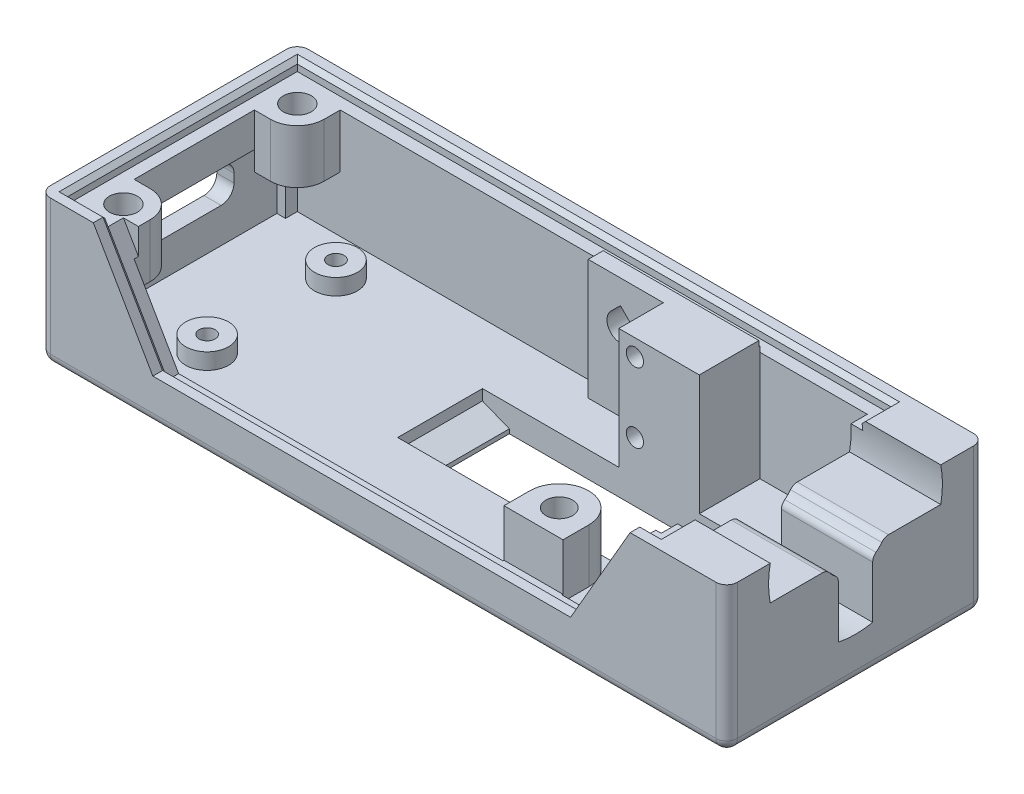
ISO-10303-21;
HEADER;
FILE_DESCRIPTION(('STEP AP214'),'2;1');
FILE_NAME('part.step','',(''),(''),'','','');
FILE_SCHEMA(('AUTOMOTIVE_DESIGN { 1 0 10303 214 1 1 1 1 }'));
ENDSEC;
DATA;
#1=APPLICATION_CONTEXT('core data for automotive mechanical design processes');
#2=APPLICATION_PROTOCOL_DEFINITION('international standard','automotive_design',2000,#1);
#3=PRODUCT_CONTEXT('',#1,'mechanical');
#4=PRODUCT('Part','Part','',(#3));
#5=PRODUCT_RELATED_PRODUCT_CATEGORY('part','',(#4));
#6=PRODUCT_DEFINITION_FORMATION('','',#4);
#7=PRODUCT_DEFINITION_CONTEXT('part definition',#1,'design');
#8=PRODUCT_DEFINITION('design','',#6,#7);
#9=PRODUCT_DEFINITION_SHAPE('','',#8);
#10=(LENGTH_UNIT() NAMED_UNIT(*) SI_UNIT(.MILLI.,.METRE.));
#11=(NAMED_UNIT(*) PLANE_ANGLE_UNIT() SI_UNIT($,.RADIAN.));
#12=(NAMED_UNIT(*) SI_UNIT($,.STERADIAN.) SOLID_ANGLE_UNIT());
#13=UNCERTAINTY_MEASURE_WITH_UNIT(LENGTH_MEASURE(1.E-05),#10,'distance_accuracy_value','');
#14=(GEOMETRIC_REPRESENTATION_CONTEXT(3) GLOBAL_UNCERTAINTY_ASSIGNED_CONTEXT((#13)) GLOBAL_UNIT_ASSIGNED_CONTEXT((#10,
#11,#12)) REPRESENTATION_CONTEXT('',''));
#15=CARTESIAN_POINT('',(0.,0.,0.));
#16=DIRECTION('',(0.,0.,1.));
#17=DIRECTION('',(1.,0.,0.));
#18=AXIS2_PLACEMENT_3D('',#15,#16,#17);
#19=CARTESIAN_POINT('',(0.,13.6,0.));
#20=DIRECTION('',(0.,-1.,0.));
#21=DIRECTION('',(0.,0.,-1.));
#22=AXIS2_PLACEMENT_3D('',#19,#20,#21);
#23=PLANE('',#22);
#24=DIRECTION('',(1.,0.,0.));
#25=VECTOR('',#24,1.);
#26=CARTESIAN_POINT('',(-18.5,13.6,-9.49999999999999));
#27=LINE('',#26,#25);
#28=CARTESIAN_POINT('',(-33.,13.6,-9.49999999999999));
#29=VERTEX_POINT('',#28);
#30=CARTESIAN_POINT('',(-18.5,13.6,-9.49999999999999));
#31=VERTEX_POINT('',#30);
#32=EDGE_CURVE('E649',#29,#31,#27,.T.);
#33=ORIENTED_EDGE('',*,*,#32,.F.);
#34=DIRECTION('',(0.,0.,-1.));
#35=VECTOR('',#34,1.);
#36=CARTESIAN_POINT('',(-33.,13.6,-8.09999999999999));
#37=LINE('',#36,#35);
#38=CARTESIAN_POINT('',(-33.,13.6,-8.09999999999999));
#39=VERTEX_POINT('',#38);
#40=EDGE_CURVE('E1010',#39,#29,#37,.T.);
#41=ORIENTED_EDGE('',*,*,#40,.F.);
#42=DIRECTION('',(-1.,0.,0.));
#43=VECTOR('',#42,1.);
#44=CARTESIAN_POINT('',(-26.,13.6,-8.09999999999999));
#45=LINE('',#44,#43);
#46=CARTESIAN_POINT('',(-26.,13.6,-8.09999999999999));
#47=VERTEX_POINT('',#46);
#48=EDGE_CURVE('E1003',#47,#39,#45,.T.);
#49=ORIENTED_EDGE('',*,*,#48,.F.);
#50=DIRECTION('',(0.,0.,-1.));
#51=VECTOR('',#50,1.);
#52=CARTESIAN_POINT('',(-26.,13.6,-9.59999999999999));
#53=LINE('',#52,#51);
#54=CARTESIAN_POINT('',(-26.,13.6,-3.94999999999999));
#55=VERTEX_POINT('',#54);
#56=EDGE_CURVE('E1126',#55,#47,#53,.T.);
#57=ORIENTED_EDGE('',*,*,#56,.F.);
#58=DIRECTION('',(-1.,0.,0.));
#59=VECTOR('',#58,1.);
#60=CARTESIAN_POINT('',(-26.,13.6,-3.94999999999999));
#61=LINE('',#60,#59);
#62=CARTESIAN_POINT('',(-18.5,13.6,-3.94999999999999));
#63=VERTEX_POINT('',#62);
#64=EDGE_CURVE('E1122',#63,#55,#61,.T.);
#65=ORIENTED_EDGE('',*,*,#64,.F.);
#66=DIRECTION('',(0.,0.,1.));
#67=VECTOR('',#66,1.);
#68=CARTESIAN_POINT('',(-18.5,13.6,-9.59999999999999));
#69=LINE('',#68,#67);
#70=EDGE_CURVE('E1120',#31,#63,#69,.T.);
#71=ORIENTED_EDGE('',*,*,#70,.F.);
#72=EDGE_LOOP('',(#33,#41,#49,#57,#65,#71));
#73=FACE_BOUND('',#72,.T.);
#74=ADVANCED_FACE('F41',(#73),#23,.F.);
#75=CARTESIAN_POINT('',(-20.5,7.4,7.1));
#76=DIRECTION('',(0.,1.,0.));
#77=DIRECTION('',(0.,0.,1.));
#78=AXIS2_PLACEMENT_3D('',#75,#76,#77);
#79=PLANE('',#78);
#80=CARTESIAN_POINT('',(-20.5,7.4,7.1));
#81=DIRECTION('',(0.,1.,0.));
#82=DIRECTION('',(0.,0.,1.));
#83=AXIS2_PLACEMENT_3D('',#80,#81,#82);
#84=CIRCLE('',#83,1.25);
#85=CARTESIAN_POINT('',(-20.5,7.4,8.35));
#86=VERTEX_POINT('',#85);
#87=EDGE_CURVE('E675',#86,#86,#84,.T.);
#88=ORIENTED_EDGE('',*,*,#87,.F.);
#89=EDGE_LOOP('',(#88));
#90=FACE_BOUND('',#89,.T.);
#91=DIRECTION('',(0.,0.,1.));
#92=VECTOR('',#91,1.);
#93=CARTESIAN_POINT('',(-23.25,7.4,7.1));
#94=LINE('',#93,#92);
#95=CARTESIAN_POINT('',(-23.25,7.4,7.1));
#96=VERTEX_POINT('',#95);
#97=CARTESIAN_POINT('',(-23.25,7.4,9.5));
#98=VERTEX_POINT('',#97);
#99=EDGE_CURVE('E683',#96,#98,#94,.T.);
#100=ORIENTED_EDGE('',*,*,#99,.T.);
#101=DIRECTION('',(-1.,0.,0.));
#102=VECTOR('',#101,1.);
#103=CARTESIAN_POINT('',(-23.25,7.4,9.5));
#104=LINE('',#103,#102);
#105=CARTESIAN_POINT('',(-17.75,7.4,9.5));
#106=VERTEX_POINT('',#105);
#107=EDGE_CURVE('E670',#106,#98,#104,.T.);
#108=ORIENTED_EDGE('',*,*,#107,.F.);
#109=DIRECTION('',(0.,0.,-1.));
#110=VECTOR('',#109,1.);
#111=CARTESIAN_POINT('',(-17.75,7.4,9.6));
#112=LINE('',#111,#110);
#113=CARTESIAN_POINT('',(-17.75,7.4,7.1));
#114=VERTEX_POINT('',#113);
#115=EDGE_CURVE('E687',#106,#114,#112,.T.);
#116=ORIENTED_EDGE('',*,*,#115,.T.);
#117=CARTESIAN_POINT('',(-20.5,7.4,7.1));
#118=DIRECTION('',(0.,1.,0.));
#119=DIRECTION('',(0.,0.,1.));
#120=AXIS2_PLACEMENT_3D('',#117,#118,#119);
#121=CIRCLE('',#120,2.75);
#122=EDGE_CURVE('E680',#114,#96,#121,.T.);
#123=ORIENTED_EDGE('',*,*,#122,.T.);
#124=EDGE_LOOP('',(#100,#108,#116,#123));
#125=FACE_BOUND('',#124,.T.);
#126=ADVANCED_FACE('F1648',(#90,#125),#79,.T.);
#127=CARTESIAN_POINT('',(-61.6,13.6,9.6));
#128=DIRECTION('',(0.,0.,-1.));
#129=DIRECTION('',(-1.,0.,0.));
#130=AXIS2_PLACEMENT_3D('',#127,#128,#129);
#131=PLANE('',#130);
#132=DIRECTION('',(-1.,0.,0.));
#133=VECTOR('',#132,1.);
#134=CARTESIAN_POINT('',(-53.4574374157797,3.00000000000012,9.6));
#135=LINE('',#134,#133);
#136=CARTESIAN_POINT('',(-23.25,3.00000000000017,9.6));
#137=VERTEX_POINT('',#136);
#138=CARTESIAN_POINT('',(-53.4574374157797,3.00000000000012,9.6));
#139=VERTEX_POINT('',#138);
#140=EDGE_CURVE('E1029',#137,#139,#135,.T.);
#141=ORIENTED_EDGE('',*,*,#140,.F.);
#142=DIRECTION('',(0.,-1.,0.));
#143=VECTOR('',#142,1.);
#144=CARTESIAN_POINT('',(-23.25,7.4,9.6));
#145=LINE('',#144,#143);
#146=CARTESIAN_POINT('',(-23.25,2.4,9.6));
#147=VERTEX_POINT('',#146);
#148=EDGE_CURVE('E699',#137,#147,#145,.T.);
#149=ORIENTED_EDGE('',*,*,#148,.T.);
#150=DIRECTION('',(1.,0.,0.));
#151=VECTOR('',#150,1.);
#152=CARTESIAN_POINT('',(-61.6,2.4,9.6));
#153=LINE('',#152,#151);
#154=CARTESIAN_POINT('',(-61.6,2.4,9.6));
#155=VERTEX_POINT('',#154);
#156=EDGE_CURVE('E1252',#155,#147,#153,.T.);
#157=ORIENTED_EDGE('',*,*,#156,.F.);
#158=DIRECTION('',(0.,-1.,0.));
#159=VECTOR('',#158,1.);
#160=CARTESIAN_POINT('',(-61.6,13.6,9.6));
#161=LINE('',#160,#159);
#162=CARTESIAN_POINT('',(-61.6,7.6,9.59999999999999));
#163=VERTEX_POINT('',#162);
#164=EDGE_CURVE('E1269',#163,#155,#161,.T.);
#165=ORIENTED_EDGE('',*,*,#164,.F.);
#166=DIRECTION('',(1.,0.,0.));
#167=VECTOR('',#166,1.);
#168=CARTESIAN_POINT('',(-61.6,7.6,9.59999999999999));
#169=LINE('',#168,#167);
#170=CARTESIAN_POINT('',(-57.6,7.6,9.59999999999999));
#171=VERTEX_POINT('',#170);
#172=EDGE_CURVE('E799',#163,#171,#169,.T.);
#173=ORIENTED_EDGE('',*,*,#172,.T.);
#174=DIRECTION('',(0.,1.,0.));
#175=VECTOR('',#174,1.);
#176=CARTESIAN_POINT('',(-57.6,7.6,9.59999999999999));
#177=LINE('',#176,#175);
#178=CARTESIAN_POINT('',(-57.6,10.1751288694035,9.59999999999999));
#179=VERTEX_POINT('',#178);
#180=EDGE_CURVE('E782',#171,#179,#177,.T.);
#181=ORIENTED_EDGE('',*,*,#180,.T.);
#182=DIRECTION('',(-0.5,0.866025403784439,0.));
#183=VECTOR('',#182,1.);
#184=CARTESIAN_POINT('',(-58.4226497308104,11.6,9.6));
#185=LINE('',#184,#183);
#186=EDGE_CURVE('E1020',#139,#179,#185,.T.);
#187=ORIENTED_EDGE('',*,*,#186,.F.);
#188=EDGE_LOOP('',(#141,#149,#157,#165,#173,#181,#187));
#189=FACE_BOUND('',#188,.T.);
#190=ADVANCED_FACE('F1654',(#189),#131,.T.);
#191=CARTESIAN_POINT('',(-17.75,2.4,9.6));
#192=VERTEX_POINT('',#191);
#193=CARTESIAN_POINT('',(-8.5,2.4,9.6));
#194=VERTEX_POINT('',#193);
#195=EDGE_CURVE('E1251',#192,#194,#153,.T.);
#196=ORIENTED_EDGE('',*,*,#195,.F.);
#197=DIRECTION('',(0.,-1.,0.));
#198=VECTOR('',#197,1.);
#199=CARTESIAN_POINT('',(-17.75,7.4,9.6));
#200=LINE('',#199,#198);
#201=CARTESIAN_POINT('',(-17.75,3.00000000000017,9.6));
#202=VERTEX_POINT('',#201);
#203=EDGE_CURVE('E697',#202,#192,#200,.T.);
#204=ORIENTED_EDGE('',*,*,#203,.F.);
#205=CARTESIAN_POINT('',(-14.5425625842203,3.00000000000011,9.6));
#206=VERTEX_POINT('',#205);
#207=EDGE_CURVE('E1030',#206,#202,#135,.T.);
#208=ORIENTED_EDGE('',*,*,#207,.F.);
#209=DIRECTION('',(-0.5,-0.866025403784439,0.));
#210=VECTOR('',#209,1.);
#211=CARTESIAN_POINT('',(-8.99999999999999,12.6,9.6));
#212=LINE('',#211,#210);
#213=CARTESIAN_POINT('',(-8.99999999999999,12.6,9.6));
#214=VERTEX_POINT('',#213);
#215=EDGE_CURVE('E1013',#214,#206,#212,.T.);
#216=ORIENTED_EDGE('',*,*,#215,.F.);
#217=DIRECTION('',(-1.,0.,0.));
#218=VECTOR('',#217,1.);
#219=CARTESIAN_POINT('',(-61.6,12.6,9.6));
#220=LINE('',#219,#218);
#221=CARTESIAN_POINT('',(-8.5,12.6,9.6));
#222=VERTEX_POINT('',#221);
#223=EDGE_CURVE('E1060',#222,#214,#220,.T.);
#224=ORIENTED_EDGE('',*,*,#223,.F.);
#225=DIRECTION('',(0.,-1.,0.));
#226=VECTOR('',#225,1.);
#227=CARTESIAN_POINT('',(-8.5,13.6,9.6));
#228=LINE('',#227,#226);
#229=EDGE_CURVE('E1266',#222,#194,#228,.T.);
#230=ORIENTED_EDGE('',*,*,#229,.T.);
#231=EDGE_LOOP('',(#196,#204,#208,#216,#224,#230));
#232=FACE_BOUND('',#231,.T.);
#233=ADVANCED_FACE('F2021',(#232),#131,.T.);
#234=CARTESIAN_POINT('',(0.,0.,0.));
#235=DIRECTION('',(0.,1.,0.));
#236=DIRECTION('',(0.,0.,1.));
#237=AXIS2_PLACEMENT_3D('',#234,#235,#236);
#238=PLANE('',#237);
#239=DIRECTION('',(1.,0.,0.));
#240=VECTOR('',#239,1.);
#241=CARTESIAN_POINT('',(0.,0.,11.));
#242=LINE('',#241,#240);
#243=CARTESIAN_POINT('',(-1.,0.,11.));
#244=VERTEX_POINT('',#243);
#245=CARTESIAN_POINT('',(-63.,0.,11.));
#246=VERTEX_POINT('',#245);
#247=EDGE_CURVE('E1380',#244,#246,#242,.F.);
#248=ORIENTED_EDGE('',*,*,#247,.T.);
#249=DIRECTION('',(0.,0.,1.));
#250=VECTOR('',#249,1.);
#251=CARTESIAN_POINT('',(-63.,0.,0.));
#252=LINE('',#251,#250);
#253=CARTESIAN_POINT('',(-63.,0.,-11.));
#254=VERTEX_POINT('',#253);
#255=EDGE_CURVE('E1386',#246,#254,#252,.F.);
#256=ORIENTED_EDGE('',*,*,#255,.T.);
#257=DIRECTION('',(-1.,0.,0.));
#258=VECTOR('',#257,1.);
#259=CARTESIAN_POINT('',(0.,0.,-11.));
#260=LINE('',#259,#258);
#261=CARTESIAN_POINT('',(-1.00000000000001,0.,-11.));
#262=VERTEX_POINT('',#261);
#263=EDGE_CURVE('E1384',#254,#262,#260,.F.);
#264=ORIENTED_EDGE('',*,*,#263,.T.);
#265=DIRECTION('',(0.,0.,-1.));
#266=VECTOR('',#265,1.);
#267=CARTESIAN_POINT('',(-1.,0.,0.));
#268=LINE('',#267,#266);
#269=EDGE_CURVE('E1382',#262,#244,#268,.F.);
#270=ORIENTED_EDGE('',*,*,#269,.T.);
#271=EDGE_LOOP('',(#248,#256,#264,#270));
#272=FACE_BOUND('',#271,.T.);
#273=DIRECTION('',(1.,0.,0.));
#274=VECTOR('',#273,1.);
#275=CARTESIAN_POINT('',(-36.2,0.,3.95));
#276=LINE('',#275,#274);
#277=CARTESIAN_POINT('',(-36.2,0.,3.95));
#278=VERTEX_POINT('',#277);
#279=CARTESIAN_POINT('',(-12.,0.,3.95));
#280=VERTEX_POINT('',#279);
#281=EDGE_CURVE('E734',#278,#280,#276,.T.);
#282=ORIENTED_EDGE('',*,*,#281,.T.);
#283=DIRECTION('',(0.,0.,-1.));
#284=VECTOR('',#283,1.);
#285=CARTESIAN_POINT('',(-12.,0.,3.95));
#286=LINE('',#285,#284);
#287=CARTESIAN_POINT('',(-12.,0.,-3.95));
#288=VERTEX_POINT('',#287);
#289=EDGE_CURVE('E755',#280,#288,#286,.T.);
#290=ORIENTED_EDGE('',*,*,#289,.T.);
#291=DIRECTION('',(1.,0.,0.));
#292=VECTOR('',#291,1.);
#293=CARTESIAN_POINT('',(-36.2,0.,-3.95));
#294=LINE('',#293,#292);
#295=CARTESIAN_POINT('',(-36.2,0.,-3.95));
#296=VERTEX_POINT('',#295);
#297=EDGE_CURVE('E712',#296,#288,#294,.T.);
#298=ORIENTED_EDGE('',*,*,#297,.F.);
#299=DIRECTION('',(0.,0.,-1.));
#300=VECTOR('',#299,1.);
#301=CARTESIAN_POINT('',(-36.2,0.,3.95));
#302=LINE('',#301,#300);
#303=EDGE_CURVE('E758',#278,#296,#302,.T.);
#304=ORIENTED_EDGE('',*,*,#303,.F.);
#305=EDGE_LOOP('',(#282,#290,#298,#304));
#306=FACE_BOUND('',#305,.T.);
#307=ADVANCED_FACE('F1515',(#272,#306),#238,.F.);
#308=CARTESIAN_POINT('',(-61.6,13.6,-9.59999999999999));
#309=DIRECTION('',(1.,0.,0.));
#310=DIRECTION('',(0.,0.,-1.));
#311=AXIS2_PLACEMENT_3D('',#308,#309,#310);
#312=PLANE('',#311);
#313=DIRECTION('',(0.,1.,0.));
#314=VECTOR('',#313,1.);
#315=CARTESIAN_POINT('',(-61.6,7.6,5.59999999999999));
#316=LINE('',#315,#314);
#317=CARTESIAN_POINT('',(-61.6,9.4,5.59999999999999));
#318=VERTEX_POINT('',#317);
#319=CARTESIAN_POINT('',(-61.6,12.6,5.59999999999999));
#320=VERTEX_POINT('',#319);
#321=EDGE_CURVE('E781',#318,#320,#316,.T.);
#322=ORIENTED_EDGE('',*,*,#321,.F.);
#323=DIRECTION('',(0.,0.,1.));
#324=VECTOR('',#323,1.);
#325=CARTESIAN_POINT('',(-61.6,9.4,-8.5));
#326=LINE('',#325,#324);
#327=CARTESIAN_POINT('',(-61.6,9.4,-5.59999999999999));
#328=VERTEX_POINT('',#327);
#329=EDGE_CURVE('E960',#328,#318,#326,.T.);
#330=ORIENTED_EDGE('',*,*,#329,.F.);
#331=DIRECTION('',(0.,1.,0.));
#332=VECTOR('',#331,1.);
#333=CARTESIAN_POINT('',(-61.6,7.6,-5.59999999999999));
#334=LINE('',#333,#332);
#335=CARTESIAN_POINT('',(-61.6,12.6,-5.59999999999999));
#336=VERTEX_POINT('',#335);
#337=EDGE_CURVE('E854',#328,#336,#334,.T.);
#338=ORIENTED_EDGE('',*,*,#337,.T.);
#339=DIRECTION('',(0.,0.,-1.));
#340=VECTOR('',#339,1.);
#341=CARTESIAN_POINT('',(-61.6,12.6,-9.59999999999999));
#342=LINE('',#341,#340);
#343=EDGE_CURVE('E1063',#320,#336,#342,.T.);
#344=ORIENTED_EDGE('',*,*,#343,.F.);
#345=EDGE_LOOP('',(#322,#330,#338,#344));
#346=FACE_BOUND('',#345,.T.);
#347=ADVANCED_FACE('F1668',(#346),#312,.T.);
#348=DIRECTION('',(0.,-1.,0.));
#349=VECTOR('',#348,1.);
#350=CARTESIAN_POINT('',(-61.6,13.6,-9.59999999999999));
#351=LINE('',#350,#349);
#352=CARTESIAN_POINT('',(-61.6,7.6,-9.59999999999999));
#353=VERTEX_POINT('',#352);
#354=CARTESIAN_POINT('',(-61.6,2.4,-9.59999999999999));
#355=VERTEX_POINT('',#354);
#356=EDGE_CURVE('E1262',#353,#355,#351,.T.);
#357=ORIENTED_EDGE('',*,*,#356,.F.);
#358=DIRECTION('',(0.,0.,1.));
#359=VECTOR('',#358,1.);
#360=CARTESIAN_POINT('',(-61.6,7.6,-9.59999999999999));
#361=LINE('',#360,#359);
#362=CARTESIAN_POINT('',(-61.6,7.6,-8.5));
#363=VERTEX_POINT('',#362);
#364=EDGE_CURVE('E834',#353,#363,#361,.T.);
#365=ORIENTED_EDGE('',*,*,#364,.T.);
#366=DIRECTION('',(0.,1.,0.));
#367=VECTOR('',#366,1.);
#368=CARTESIAN_POINT('',(-61.6,9.4,-8.5));
#369=LINE('',#368,#367);
#370=CARTESIAN_POINT('',(-61.6,2.4,-8.50000000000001));
#371=VERTEX_POINT('',#370);
#372=EDGE_CURVE('E952',#371,#363,#369,.T.);
#373=ORIENTED_EDGE('',*,*,#372,.F.);
#374=DIRECTION('',(0.,0.,1.));
#375=VECTOR('',#374,1.);
#376=CARTESIAN_POINT('',(-61.6,2.4,-9.59999999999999));
#377=LINE('',#376,#375);
#378=EDGE_CURVE('E1248',#355,#371,#377,.T.);
#379=ORIENTED_EDGE('',*,*,#378,.F.);
#380=EDGE_LOOP('',(#357,#365,#373,#379));
#381=FACE_BOUND('',#380,.T.);
#382=ADVANCED_FACE('F1669',(#381),#312,.T.);
#383=CARTESIAN_POINT('',(-62.4,2.4,-12.));
#384=DIRECTION('',(1.,0.,0.));
#385=DIRECTION('',(0.,0.,-1.));
#386=AXIS2_PLACEMENT_3D('',#383,#384,#385);
#387=PLANE('',#386);
#388=DIRECTION('',(0.,1.,0.));
#389=VECTOR('',#388,1.);
#390=CARTESIAN_POINT('',(-62.4,9.4,8.5));
#391=LINE('',#390,#389);
#392=CARTESIAN_POINT('',(-62.4,2.4,8.49999999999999));
#393=VERTEX_POINT('',#392);
#394=CARTESIAN_POINT('',(-62.4,9.4,8.5));
#395=VERTEX_POINT('',#394);
#396=EDGE_CURVE('E945',#393,#395,#391,.T.);
#397=ORIENTED_EDGE('',*,*,#396,.F.);
#398=DIRECTION('',(0.,0.,1.));
#399=VECTOR('',#398,1.);
#400=CARTESIAN_POINT('',(-62.4,2.4,-8.50000000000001));
#401=LINE('',#400,#399);
#402=CARTESIAN_POINT('',(-62.4,2.4,-8.50000000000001));
#403=VERTEX_POINT('',#402);
#404=EDGE_CURVE('E947',#403,#393,#401,.T.);
#405=ORIENTED_EDGE('',*,*,#404,.F.);
#406=DIRECTION('',(0.,-1.,0.));
#407=VECTOR('',#406,1.);
#408=CARTESIAN_POINT('',(-62.4,9.4,-8.5));
#409=LINE('',#408,#407);
#410=CARTESIAN_POINT('',(-62.4,9.4,-8.5));
#411=VERTEX_POINT('',#410);
#412=EDGE_CURVE('E940',#411,#403,#409,.T.);
#413=ORIENTED_EDGE('',*,*,#412,.F.);
#414=DIRECTION('',(0.,0.,-1.));
#415=VECTOR('',#414,1.);
#416=CARTESIAN_POINT('',(-62.4,9.4,-8.5));
#417=LINE('',#416,#415);
#418=EDGE_CURVE('E942',#395,#411,#417,.T.);
#419=ORIENTED_EDGE('',*,*,#418,.F.);
#420=EDGE_LOOP('',(#397,#405,#413,#419));
#421=FACE_BOUND('',#420,.T.);
#422=DIRECTION('',(0.,-1.,0.));
#423=VECTOR('',#422,1.);
#424=CARTESIAN_POINT('',(-62.4,7.65,-4.5));
#425=LINE('',#424,#423);
#426=CARTESIAN_POINT('',(-62.4,7.65,-4.5));
#427=VERTEX_POINT('',#426);
#428=CARTESIAN_POINT('',(-62.4,6.85,-4.5));
#429=VERTEX_POINT('',#428);
#430=EDGE_CURVE('E907',#427,#429,#425,.T.);
#431=ORIENTED_EDGE('',*,*,#430,.T.);
#432=CARTESIAN_POINT('',(-62.4,6.85,-3.3));
#433=DIRECTION('',(1.,0.,0.));
#434=DIRECTION('',(0.,0.,-1.));
#435=AXIS2_PLACEMENT_3D('',#432,#433,#434);
#436=CIRCLE('',#435,1.2);
#437=CARTESIAN_POINT('',(-62.4,5.65,-3.3));
#438=VERTEX_POINT('',#437);
#439=EDGE_CURVE('E902',#429,#438,#436,.F.);
#440=ORIENTED_EDGE('',*,*,#439,.T.);
#441=DIRECTION('',(0.,0.,1.));
#442=VECTOR('',#441,1.);
#443=CARTESIAN_POINT('',(-62.4,5.65,3.3));
#444=LINE('',#443,#442);
#445=CARTESIAN_POINT('',(-62.4,5.65,3.3));
#446=VERTEX_POINT('',#445);
#447=EDGE_CURVE('E878',#438,#446,#444,.T.);
#448=ORIENTED_EDGE('',*,*,#447,.T.);
#449=CARTESIAN_POINT('',(-62.4,6.85,3.3));
#450=DIRECTION('',(1.,0.,0.));
#451=DIRECTION('',(0.,0.,-1.));
#452=AXIS2_PLACEMENT_3D('',#449,#450,#451);
#453=CIRCLE('',#452,1.2);
#454=CARTESIAN_POINT('',(-62.4,6.85,4.5));
#455=VERTEX_POINT('',#454);
#456=EDGE_CURVE('E927',#446,#455,#453,.F.);
#457=ORIENTED_EDGE('',*,*,#456,.T.);
#458=DIRECTION('',(0.,1.,0.));
#459=VECTOR('',#458,1.);
#460=CARTESIAN_POINT('',(-62.4,7.65,4.5));
#461=LINE('',#460,#459);
#462=CARTESIAN_POINT('',(-62.4,7.65,4.5));
#463=VERTEX_POINT('',#462);
#464=EDGE_CURVE('E923',#455,#463,#461,.T.);
#465=ORIENTED_EDGE('',*,*,#464,.T.);
#466=CARTESIAN_POINT('',(-62.4,7.65,3.3));
#467=DIRECTION('',(1.,0.,0.));
#468=DIRECTION('',(0.,0.,-1.));
#469=AXIS2_PLACEMENT_3D('',#466,#467,#468);
#470=CIRCLE('',#469,1.2);
#471=CARTESIAN_POINT('',(-62.4,8.85,3.3));
#472=VERTEX_POINT('',#471);
#473=EDGE_CURVE('E919',#463,#472,#470,.F.);
#474=ORIENTED_EDGE('',*,*,#473,.T.);
#475=DIRECTION('',(0.,0.,-1.));
#476=VECTOR('',#475,1.);
#477=CARTESIAN_POINT('',(-62.4,8.85,3.3));
#478=LINE('',#477,#476);
#479=CARTESIAN_POINT('',(-62.4,8.85,-3.3));
#480=VERTEX_POINT('',#479);
#481=EDGE_CURVE('E915',#472,#480,#478,.T.);
#482=ORIENTED_EDGE('',*,*,#481,.T.);
#483=CARTESIAN_POINT('',(-62.4,7.65,-3.3));
#484=DIRECTION('',(1.,0.,0.));
#485=DIRECTION('',(0.,0.,-1.));
#486=AXIS2_PLACEMENT_3D('',#483,#484,#485);
#487=CIRCLE('',#486,1.2);
#488=EDGE_CURVE('E911',#480,#427,#487,.F.);
#489=ORIENTED_EDGE('',*,*,#488,.T.);
#490=EDGE_LOOP('',(#431,#440,#448,#457,#465,#474,#482,#489));
#491=FACE_BOUND('',#490,.T.);
#492=ADVANCED_FACE('F2176',(#421,#491),#387,.T.);
#493=CARTESIAN_POINT('',(-26.,22.9900212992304,-9.59999999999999));
#494=DIRECTION('',(1.,0.,0.));
#495=DIRECTION('',(0.,0.,-1.));
#496=AXIS2_PLACEMENT_3D('',#493,#494,#495);
#497=PLANE('',#496);
#498=DIRECTION('',(0.,1.,0.));
#499=VECTOR('',#498,1.);
#500=CARTESIAN_POINT('',(-26.,2.4,-8.09999999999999));
#501=LINE('',#500,#499);
#502=CARTESIAN_POINT('',(-26.,2.4,-8.09999999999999));
#503=VERTEX_POINT('',#502);
#504=EDGE_CURVE('E1005',#503,#47,#501,.T.);
#505=ORIENTED_EDGE('',*,*,#504,.F.);
#506=DIRECTION('',(0.,0.,1.));
#507=VECTOR('',#506,1.);
#508=CARTESIAN_POINT('',(-26.,2.4,-9.59999999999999));
#509=LINE('',#508,#507);
#510=CARTESIAN_POINT('',(-26.,2.4,-3.95));
#511=VERTEX_POINT('',#510);
#512=EDGE_CURVE('E1111',#503,#511,#509,.T.);
#513=ORIENTED_EDGE('',*,*,#512,.T.);
#514=DIRECTION('',(0.,-1.,0.));
#515=VECTOR('',#514,1.);
#516=CARTESIAN_POINT('',(-26.,22.9900212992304,-3.94999999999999));
#517=LINE('',#516,#515);
#518=EDGE_CURVE('E1123',#55,#511,#517,.T.);
#519=ORIENTED_EDGE('',*,*,#518,.F.);
#520=ORIENTED_EDGE('',*,*,#56,.T.);
#521=EDGE_LOOP('',(#505,#513,#519,#520));
#522=FACE_BOUND('',#521,.T.);
#523=ADVANCED_FACE('F1903',(#522),#497,.F.);
#524=CARTESIAN_POINT('',(-59.,13.6,-41.3132595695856));
#525=DIRECTION('',(-0.866025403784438,-0.500000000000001,0.));
#526=DIRECTION('',(0.500000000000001,-0.866025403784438,0.));
#527=AXIS2_PLACEMENT_3D('',#524,#525,#526);
#528=PLANE('',#527);
#529=DIRECTION('',(0.,0.,1.));
#530=VECTOR('',#529,1.);
#531=CARTESIAN_POINT('',(-53.4574374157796,4.,-41.3132595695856));
#532=LINE('',#531,#530);
#533=CARTESIAN_POINT('',(-53.4574374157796,4.,11.1));
#534=VERTEX_POINT('',#533);
#535=CARTESIAN_POINT('',(-53.4574374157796,4.,12.));
#536=VERTEX_POINT('',#535);
#537=EDGE_CURVE('E1093',#534,#536,#532,.T.);
#538=ORIENTED_EDGE('',*,*,#537,.F.);
#539=DIRECTION('',(-0.500000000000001,0.866025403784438,0.));
#540=VECTOR('',#539,1.);
#541=CARTESIAN_POINT('',(-59.,13.6,11.1));
#542=LINE('',#541,#540);
#543=CARTESIAN_POINT('',(-59.,13.6,11.1));
#544=VERTEX_POINT('',#543);
#545=EDGE_CURVE('E1332',#534,#544,#542,.T.);
#546=ORIENTED_EDGE('',*,*,#545,.T.);
#547=DIRECTION('',(0.,0.,1.));
#548=VECTOR('',#547,1.);
#549=CARTESIAN_POINT('',(-59.,13.6,-41.3132595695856));
#550=LINE('',#549,#548);
#551=CARTESIAN_POINT('',(-59.,13.6,12.));
#552=VERTEX_POINT('',#551);
#553=EDGE_CURVE('E1101',#544,#552,#550,.T.);
#554=ORIENTED_EDGE('',*,*,#553,.T.);
#555=DIRECTION('',(0.500000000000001,-0.866025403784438,0.));
#556=VECTOR('',#555,1.);
#557=CARTESIAN_POINT('',(-59.,13.6,12.));
#558=LINE('',#557,#556);
#559=EDGE_CURVE('E1089',#552,#536,#558,.T.);
#560=ORIENTED_EDGE('',*,*,#559,.T.);
#561=EDGE_LOOP('',(#538,#546,#554,#560));
#562=FACE_BOUND('',#561,.T.);
#563=ADVANCED_FACE('F1557',(#562),#528,.F.);
#564=CARTESIAN_POINT('',(-53.4574374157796,4.,-41.3132595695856));
#565=DIRECTION('',(0.,-1.,0.));
#566=DIRECTION('',(0.,0.,-1.));
#567=AXIS2_PLACEMENT_3D('',#564,#565,#566);
#568=PLANE('',#567);
#569=DIRECTION('',(0.,0.,1.));
#570=VECTOR('',#569,1.);
#571=CARTESIAN_POINT('',(-14.5425625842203,4.,-41.3132595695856));
#572=LINE('',#571,#570);
#573=CARTESIAN_POINT('',(-14.5425625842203,4.,11.1));
#574=VERTEX_POINT('',#573);
#575=CARTESIAN_POINT('',(-14.5425625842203,4.,12.));
#576=VERTEX_POINT('',#575);
#577=EDGE_CURVE('E1102',#574,#576,#572,.T.);
#578=ORIENTED_EDGE('',*,*,#577,.F.);
#579=DIRECTION('',(-1.,0.,0.));
#580=VECTOR('',#579,1.);
#581=CARTESIAN_POINT('',(-53.4574374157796,4.,11.1));
#582=LINE('',#581,#580);
#583=EDGE_CURVE('E1330',#574,#534,#582,.T.);
#584=ORIENTED_EDGE('',*,*,#583,.T.);
#585=ORIENTED_EDGE('',*,*,#537,.T.);
#586=DIRECTION('',(1.,0.,0.));
#587=VECTOR('',#586,1.);
#588=CARTESIAN_POINT('',(-53.4574374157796,4.,12.));
#589=LINE('',#588,#587);
#590=EDGE_CURVE('E1094',#536,#576,#589,.T.);
#591=ORIENTED_EDGE('',*,*,#590,.T.);
#592=EDGE_LOOP('',(#578,#584,#585,#591));
#593=FACE_BOUND('',#592,.T.);
#594=ADVANCED_FACE('F1627',(#593),#568,.F.);
#595=CARTESIAN_POINT('',(-14.5425625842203,4.,-41.3132595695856));
#596=DIRECTION('',(0.866025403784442,-0.499999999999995,0.));
#597=DIRECTION('',(0.499999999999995,0.866025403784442,0.));
#598=AXIS2_PLACEMENT_3D('',#595,#596,#597);
#599=PLANE('',#598);
#600=DIRECTION('',(0.,0.,1.));
#601=VECTOR('',#600,1.);
#602=CARTESIAN_POINT('',(-9.,13.6,-41.3132595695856));
#603=LINE('',#602,#601);
#604=CARTESIAN_POINT('',(-9.,13.6,11.1));
#605=VERTEX_POINT('',#604);
#606=CARTESIAN_POINT('',(-9.,13.6,12.));
#607=VERTEX_POINT('',#606);
#608=EDGE_CURVE('E1099',#605,#607,#603,.T.);
#609=ORIENTED_EDGE('',*,*,#608,.F.);
#610=DIRECTION('',(-0.499999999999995,-0.866025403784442,0.));
#611=VECTOR('',#610,1.);
#612=CARTESIAN_POINT('',(-14.5425625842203,4.,11.1));
#613=LINE('',#612,#611);
#614=EDGE_CURVE('E1328',#605,#574,#613,.T.);
#615=ORIENTED_EDGE('',*,*,#614,.T.);
#616=ORIENTED_EDGE('',*,*,#577,.T.);
#617=DIRECTION('',(0.499999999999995,0.866025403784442,0.));
#618=VECTOR('',#617,1.);
#619=CARTESIAN_POINT('',(-14.5425625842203,4.,12.));
#620=LINE('',#619,#618);
#621=EDGE_CURVE('E1090',#576,#607,#620,.T.);
#622=ORIENTED_EDGE('',*,*,#621,.T.);
#623=EDGE_LOOP('',(#609,#615,#616,#622));
#624=FACE_BOUND('',#623,.T.);
#625=ADVANCED_FACE('F1622',(#624),#599,.F.);
#626=DIRECTION('',(0.,0.,1.));
#627=VECTOR('',#626,1.);
#628=CARTESIAN_POINT('',(-64.,13.6,-12.));
#629=LINE('',#628,#627);
#630=CARTESIAN_POINT('',(-64.,13.6,-11.));
#631=VERTEX_POINT('',#630);
#632=CARTESIAN_POINT('',(-64.,13.6,11.));
#633=VERTEX_POINT('',#632);
#634=EDGE_CURVE('E1277',#631,#633,#629,.T.);
#635=ORIENTED_EDGE('',*,*,#634,.T.);
#636=CARTESIAN_POINT('',(-63.,13.6,11.));
#637=DIRECTION('',(0.,-1.,0.));
#638=DIRECTION('',(0.,0.,-1.));
#639=AXIS2_PLACEMENT_3D('',#636,#637,#638);
#640=CIRCLE('',#639,1.);
#641=CARTESIAN_POINT('',(-63.,13.6,12.));
#642=VERTEX_POINT('',#641);
#643=EDGE_CURVE('E1378',#633,#642,#640,.F.);
#644=ORIENTED_EDGE('',*,*,#643,.T.);
#645=DIRECTION('',(1.,0.,0.));
#646=VECTOR('',#645,1.);
#647=CARTESIAN_POINT('',(0.,13.6,12.));
#648=LINE('',#647,#646);
#649=EDGE_CURVE('E1281',#642,#552,#648,.T.);
#650=ORIENTED_EDGE('',*,*,#649,.T.);
#651=ORIENTED_EDGE('',*,*,#553,.F.);
#652=DIRECTION('',(-1.,0.,0.));
#653=VECTOR('',#652,1.);
#654=CARTESIAN_POINT('',(0.,13.6,11.1));
#655=LINE('',#654,#653);
#656=CARTESIAN_POINT('',(-63.1,13.6,11.1));
#657=VERTEX_POINT('',#656);
#658=EDGE_CURVE('E1304',#544,#657,#655,.T.);
#659=ORIENTED_EDGE('',*,*,#658,.T.);
#660=DIRECTION('',(0.,0.,-1.));
#661=VECTOR('',#660,1.);
#662=CARTESIAN_POINT('',(-63.1,13.6,0.));
#663=LINE('',#662,#661);
#664=CARTESIAN_POINT('',(-63.1,13.6,-11.1));
#665=VERTEX_POINT('',#664);
#666=EDGE_CURVE('E1302',#657,#665,#663,.T.);
#667=ORIENTED_EDGE('',*,*,#666,.T.);
#668=DIRECTION('',(1.,0.,0.));
#669=VECTOR('',#668,1.);
#670=CARTESIAN_POINT('',(0.,13.6,-11.1));
#671=LINE('',#670,#669);
#672=CARTESIAN_POINT('',(-6.99999999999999,13.6,-11.1));
#673=VERTEX_POINT('',#672);
#674=EDGE_CURVE('E1300',#665,#673,#671,.T.);
#675=ORIENTED_EDGE('',*,*,#674,.T.);
#676=DIRECTION('',(0.,0.,1.));
#677=VECTOR('',#676,1.);
#678=CARTESIAN_POINT('',(-6.99999999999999,13.6,0.));
#679=LINE('',#678,#677);
#680=CARTESIAN_POINT('',(-7.,13.6,-7.94040301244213));
#681=VERTEX_POINT('',#680);
#682=EDGE_CURVE('E1306',#673,#681,#679,.T.);
#683=ORIENTED_EDGE('',*,*,#682,.T.);
#684=DIRECTION('',(1.,0.,0.));
#685=VECTOR('',#684,1.);
#686=CARTESIAN_POINT('',(-27.3820020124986,13.6,-7.94040301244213));
#687=LINE('',#686,#685);
#688=CARTESIAN_POINT('',(0.,13.6,-7.94040301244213));
#689=VERTEX_POINT('',#688);
#690=EDGE_CURVE('E1191',#681,#689,#687,.T.);
#691=ORIENTED_EDGE('',*,*,#690,.T.);
#692=DIRECTION('',(0.,0.,-1.));
#693=VECTOR('',#692,1.);
#694=CARTESIAN_POINT('',(0.,13.6,-12.));
#695=LINE('',#694,#693);
#696=CARTESIAN_POINT('',(0.,13.6,-11.));
#697=VERTEX_POINT('',#696);
#698=EDGE_CURVE('E1271',#689,#697,#695,.T.);
#699=ORIENTED_EDGE('',*,*,#698,.T.);
#700=CARTESIAN_POINT('',(-1.,13.6,-11.));
#701=DIRECTION('',(0.,-1.,0.));
#702=DIRECTION('',(0.,0.,-1.));
#703=AXIS2_PLACEMENT_3D('',#700,#701,#702);
#704=CIRCLE('',#703,1.);
#705=CARTESIAN_POINT('',(-1.,13.6,-12.));
#706=VERTEX_POINT('',#705);
#707=EDGE_CURVE('E1374',#697,#706,#704,.F.);
#708=ORIENTED_EDGE('',*,*,#707,.T.);
#709=DIRECTION('',(-1.,0.,0.));
#710=VECTOR('',#709,1.);
#711=CARTESIAN_POINT('',(0.,13.6,-12.));
#712=LINE('',#711,#710);
#713=CARTESIAN_POINT('',(-63.,13.6,-12.));
#714=VERTEX_POINT('',#713);
#715=EDGE_CURVE('E1274',#706,#714,#712,.T.);
#716=ORIENTED_EDGE('',*,*,#715,.T.);
#717=CARTESIAN_POINT('',(-63.,13.6,-11.));
#718=DIRECTION('',(0.,-1.,0.));
#719=DIRECTION('',(0.,0.,-1.));
#720=AXIS2_PLACEMENT_3D('',#717,#718,#719);
#721=CIRCLE('',#720,1.);
#722=EDGE_CURVE('E1376',#714,#631,#721,.F.);
#723=ORIENTED_EDGE('',*,*,#722,.T.);
#724=EDGE_LOOP('',(#635,#644,#650,#651,#659,#667,#675,#683,#691,#699,#708,#716,#723));
#725=FACE_BOUND('',#724,.T.);
#726=ADVANCED_FACE('F1444',(#725),#23,.F.);
#727=CARTESIAN_POINT('',(-61.6,13.6,-9.59999999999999));
#728=DIRECTION('',(0.,0.,1.));
#729=DIRECTION('',(1.,0.,0.));
#730=AXIS2_PLACEMENT_3D('',#727,#728,#729);
#731=PLANE('',#730);
#732=DIRECTION('',(1.,0.,0.));
#733=VECTOR('',#732,1.);
#734=CARTESIAN_POINT('',(-8.5,12.6,-9.59999999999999));
#735=LINE('',#734,#733);
#736=CARTESIAN_POINT('',(-18.5,12.6,-9.59999999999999));
#737=VERTEX_POINT('',#736);
#738=CARTESIAN_POINT('',(-8.5,12.6,-9.59999999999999));
#739=VERTEX_POINT('',#738);
#740=EDGE_CURVE('E1065',#737,#739,#735,.T.);
#741=ORIENTED_EDGE('',*,*,#740,.F.);
#742=DIRECTION('',(0.,-1.,0.));
#743=VECTOR('',#742,1.);
#744=CARTESIAN_POINT('',(-18.5,22.9900212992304,-9.59999999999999));
#745=LINE('',#744,#743);
#746=CARTESIAN_POINT('',(-18.5,2.4,-9.59999999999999));
#747=VERTEX_POINT('',#746);
#748=EDGE_CURVE('E1135',#737,#747,#745,.T.);
#749=ORIENTED_EDGE('',*,*,#748,.T.);
#750=DIRECTION('',(-1.,0.,0.));
#751=VECTOR('',#750,1.);
#752=CARTESIAN_POINT('',(-61.6,2.4,-9.59999999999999));
#753=LINE('',#752,#751);
#754=CARTESIAN_POINT('',(-8.5,2.4,-9.59999999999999));
#755=VERTEX_POINT('',#754);
#756=EDGE_CURVE('E1259',#755,#747,#753,.T.);
#757=ORIENTED_EDGE('',*,*,#756,.F.);
#758=DIRECTION('',(0.,-1.,0.));
#759=VECTOR('',#758,1.);
#760=CARTESIAN_POINT('',(-8.5,13.6,-9.59999999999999));
#761=LINE('',#760,#759);
#762=EDGE_CURVE('E1264',#739,#755,#761,.T.);
#763=ORIENTED_EDGE('',*,*,#762,.F.);
#764=EDGE_LOOP('',(#741,#749,#757,#763));
#765=FACE_BOUND('',#764,.T.);
#766=ADVANCED_FACE('F1660',(#765),#731,.T.);
#767=DIRECTION('',(0.,1.,0.));
#768=VECTOR('',#767,1.);
#769=CARTESIAN_POINT('',(-57.6,7.6,-9.59999999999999));
#770=LINE('',#769,#768);
#771=CARTESIAN_POINT('',(-57.6,7.6,-9.59999999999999));
#772=VERTEX_POINT('',#771);
#773=CARTESIAN_POINT('',(-57.6,12.6,-9.59999999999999));
#774=VERTEX_POINT('',#773);
#775=EDGE_CURVE('E855',#772,#774,#770,.T.);
#776=ORIENTED_EDGE('',*,*,#775,.F.);
#777=DIRECTION('',(-1.,0.,0.));
#778=VECTOR('',#777,1.);
#779=CARTESIAN_POINT('',(-61.6,7.6,-9.59999999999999));
#780=LINE('',#779,#778);
#781=EDGE_CURVE('E830',#772,#353,#780,.T.);
#782=ORIENTED_EDGE('',*,*,#781,.T.);
#783=ORIENTED_EDGE('',*,*,#356,.T.);
#784=CARTESIAN_POINT('',(-33.,2.4,-9.59999999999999));
#785=VERTEX_POINT('',#784);
#786=EDGE_CURVE('E1258',#785,#355,#753,.T.);
#787=ORIENTED_EDGE('',*,*,#786,.F.);
#788=DIRECTION('',(0.,1.,0.));
#789=VECTOR('',#788,1.);
#790=CARTESIAN_POINT('',(-33.,2.4,-9.59999999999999));
#791=LINE('',#790,#789);
#792=CARTESIAN_POINT('',(-33.,12.6,-9.59999999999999));
#793=VERTEX_POINT('',#792);
#794=EDGE_CURVE('E1000',#785,#793,#791,.T.);
#795=ORIENTED_EDGE('',*,*,#794,.T.);
#796=EDGE_CURVE('E1066',#774,#793,#735,.T.);
#797=ORIENTED_EDGE('',*,*,#796,.F.);
#798=EDGE_LOOP('',(#776,#782,#783,#787,#795,#797));
#799=FACE_BOUND('',#798,.T.);
#800=ADVANCED_FACE('F2076',(#799),#731,.T.);
#801=CARTESIAN_POINT('',(0.,2.4,0.));
#802=DIRECTION('',(0.,1.,0.));
#803=DIRECTION('',(0.,0.,1.));
#804=AXIS2_PLACEMENT_3D('',#801,#802,#803);
#805=PLANE('',#804);
#806=ORIENTED_EDGE('',*,*,#156,.T.);
#807=DIRECTION('',(0.,0.,1.));
#808=VECTOR('',#807,1.);
#809=CARTESIAN_POINT('',(-23.25,2.4,7.1));
#810=LINE('',#809,#808);
#811=CARTESIAN_POINT('',(-23.25,2.4,7.1));
#812=VERTEX_POINT('',#811);
#813=EDGE_CURVE('E692',#812,#147,#810,.T.);
#814=ORIENTED_EDGE('',*,*,#813,.F.);
#815=CARTESIAN_POINT('',(-20.5,2.4,7.1));
#816=DIRECTION('',(0.,1.,0.));
#817=DIRECTION('',(0.,0.,1.));
#818=AXIS2_PLACEMENT_3D('',#815,#816,#817);
#819=CIRCLE('',#818,2.75);
#820=CARTESIAN_POINT('',(-17.75,2.4,7.1));
#821=VERTEX_POINT('',#820);
#822=EDGE_CURVE('E679',#821,#812,#819,.T.);
#823=ORIENTED_EDGE('',*,*,#822,.F.);
#824=DIRECTION('',(0.,0.,-1.));
#825=VECTOR('',#824,1.);
#826=CARTESIAN_POINT('',(-17.75,2.4,9.6));
#827=LINE('',#826,#825);
#828=EDGE_CURVE('E684',#192,#821,#827,.T.);
#829=ORIENTED_EDGE('',*,*,#828,.F.);
#830=ORIENTED_EDGE('',*,*,#195,.T.);
#831=DIRECTION('',(0.,0.,-1.));
#832=VECTOR('',#831,1.);
#833=CARTESIAN_POINT('',(-8.5,2.4,-9.59999999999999));
#834=LINE('',#833,#832);
#835=EDGE_CURVE('E1255',#194,#755,#834,.T.);
#836=ORIENTED_EDGE('',*,*,#835,.T.);
#837=ORIENTED_EDGE('',*,*,#756,.T.);
#838=DIRECTION('',(0.,0.,-1.));
#839=VECTOR('',#838,1.);
#840=CARTESIAN_POINT('',(-18.5,2.4,-9.59999999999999));
#841=LINE('',#840,#839);
#842=CARTESIAN_POINT('',(-18.5,2.4,-3.95));
#843=VERTEX_POINT('',#842);
#844=EDGE_CURVE('E1132',#843,#747,#841,.T.);
#845=ORIENTED_EDGE('',*,*,#844,.F.);
#846=DIRECTION('',(-1.,0.,0.));
#847=VECTOR('',#846,1.);
#848=CARTESIAN_POINT('',(-38.7,2.4,-3.95));
#849=LINE('',#848,#847);
#850=CARTESIAN_POINT('',(-9.49999999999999,2.4,-3.95));
#851=VERTEX_POINT('',#850);
#852=EDGE_CURVE('E725',#851,#843,#849,.T.);
#853=ORIENTED_EDGE('',*,*,#852,.F.);
#854=DIRECTION('',(0.,0.,-1.));
#855=VECTOR('',#854,1.);
#856=CARTESIAN_POINT('',(-9.49999999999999,2.4,3.95));
#857=LINE('',#856,#855);
#858=CARTESIAN_POINT('',(-9.49999999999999,2.4,3.95));
#859=VERTEX_POINT('',#858);
#860=EDGE_CURVE('E749',#859,#851,#857,.T.);
#861=ORIENTED_EDGE('',*,*,#860,.F.);
#862=DIRECTION('',(-1.,0.,0.));
#863=VECTOR('',#862,1.);
#864=CARTESIAN_POINT('',(-38.7,2.4,3.95));
#865=LINE('',#864,#863);
#866=CARTESIAN_POINT('',(-38.7,2.4,3.95));
#867=VERTEX_POINT('',#866);
#868=EDGE_CURVE('E743',#859,#867,#865,.T.);
#869=ORIENTED_EDGE('',*,*,#868,.T.);
#870=DIRECTION('',(0.,0.,-1.));
#871=VECTOR('',#870,1.);
#872=CARTESIAN_POINT('',(-38.7,2.4,3.95));
#873=LINE('',#872,#871);
#874=CARTESIAN_POINT('',(-38.7,2.4,-3.95));
#875=VERTEX_POINT('',#874);
#876=EDGE_CURVE('E746',#867,#875,#873,.T.);
#877=ORIENTED_EDGE('',*,*,#876,.T.);
#878=EDGE_CURVE('E724',#511,#875,#849,.T.);
#879=ORIENTED_EDGE('',*,*,#878,.F.);
#880=ORIENTED_EDGE('',*,*,#512,.F.);
#881=DIRECTION('',(-1.,0.,0.));
#882=VECTOR('',#881,1.);
#883=CARTESIAN_POINT('',(-26.,2.4,-8.09999999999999));
#884=LINE('',#883,#882);
#885=CARTESIAN_POINT('',(-33.,2.4,-8.09999999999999));
#886=VERTEX_POINT('',#885);
#887=EDGE_CURVE('E996',#503,#886,#884,.T.);
#888=ORIENTED_EDGE('',*,*,#887,.T.);
#889=DIRECTION('',(0.,0.,-1.));
#890=VECTOR('',#889,1.);
#891=CARTESIAN_POINT('',(-33.,2.4,-8.09999999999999));
#892=LINE('',#891,#890);
#893=EDGE_CURVE('E1007',#886,#785,#892,.T.);
#894=ORIENTED_EDGE('',*,*,#893,.T.);
#895=ORIENTED_EDGE('',*,*,#786,.T.);
#896=ORIENTED_EDGE('',*,*,#378,.T.);
#897=DIRECTION('',(1.,0.,0.));
#898=VECTOR('',#897,1.);
#899=CARTESIAN_POINT('',(-82.3847763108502,2.4,-8.50000000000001));
#900=LINE('',#899,#898);
#901=EDGE_CURVE('E966',#403,#371,#900,.T.);
#902=ORIENTED_EDGE('',*,*,#901,.F.);
#903=ORIENTED_EDGE('',*,*,#404,.T.);
#904=DIRECTION('',(1.,0.,0.));
#905=VECTOR('',#904,1.);
#906=CARTESIAN_POINT('',(-82.3847763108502,2.4,8.5));
#907=LINE('',#906,#905);
#908=CARTESIAN_POINT('',(-61.6,2.4,8.5));
#909=VERTEX_POINT('',#908);
#910=EDGE_CURVE('E959',#393,#909,#907,.T.);
#911=ORIENTED_EDGE('',*,*,#910,.T.);
#912=EDGE_CURVE('E1247',#909,#155,#377,.T.);
#913=ORIENTED_EDGE('',*,*,#912,.T.);
#914=EDGE_LOOP('',(#806,#814,#823,#829,#830,#836,#837,#845,#853,#861,#869,#877,#879,#880,#888,
#894,#895,#896,#902,#903,#911,#913));
#915=FACE_BOUND('',#914,.T.);
#916=CARTESIAN_POINT('',(-54.4,2.4,6.));
#917=DIRECTION('',(0.,1.,0.));
#918=DIRECTION('',(0.,0.,-1.));
#919=AXIS2_PLACEMENT_3D('',#916,#917,#918);
#920=CIRCLE('',#919,2.00000000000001);
#921=CARTESIAN_POINT('',(-54.4,2.4,3.99999999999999));
#922=VERTEX_POINT('',#921);
#923=EDGE_CURVE('E858',#922,#922,#920,.T.);
#924=ORIENTED_EDGE('',*,*,#923,.F.);
#925=EDGE_LOOP('',(#924));
#926=FACE_BOUND('',#925,.T.);
#927=CARTESIAN_POINT('',(-54.4,2.4,-6.));
#928=DIRECTION('',(0.,1.,0.));
#929=DIRECTION('',(0.,0.,1.));
#930=AXIS2_PLACEMENT_3D('',#927,#928,#929);
#931=CIRCLE('',#930,2.);
#932=CARTESIAN_POINT('',(-54.4,2.4,-4.));
#933=VERTEX_POINT('',#932);
#934=EDGE_CURVE('E869',#933,#933,#931,.T.);
#935=ORIENTED_EDGE('',*,*,#934,.F.);
#936=EDGE_LOOP('',(#935));
#937=FACE_BOUND('',#936,.T.);
#938=ADVANCED_FACE('F1681',(#915,#926,#937),#805,.T.);
#939=CARTESIAN_POINT('',(-64.,2.4,-12.));
#940=DIRECTION('',(1.,0.,0.));
#941=DIRECTION('',(0.,0.,-1.));
#942=AXIS2_PLACEMENT_3D('',#939,#940,#941);
#943=PLANE('',#942);
#944=CARTESIAN_POINT('',(-64.,6.85,3.3));
#945=DIRECTION('',(-1.,0.,0.));
#946=DIRECTION('',(0.,0.,-1.));
#947=AXIS2_PLACEMENT_3D('',#944,#945,#946);
#948=CIRCLE('',#947,1.2);
#949=CARTESIAN_POINT('',(-64.,5.65,3.3));
#950=VERTEX_POINT('',#949);
#951=CARTESIAN_POINT('',(-64.,6.85,4.5));
#952=VERTEX_POINT('',#951);
#953=EDGE_CURVE('E891',#950,#952,#948,.T.);
#954=ORIENTED_EDGE('',*,*,#953,.F.);
#955=DIRECTION('',(0.,0.,1.));
#956=VECTOR('',#955,1.);
#957=CARTESIAN_POINT('',(-64.,5.65,3.3));
#958=LINE('',#957,#956);
#959=CARTESIAN_POINT('',(-64.,5.65,-3.3));
#960=VERTEX_POINT('',#959);
#961=EDGE_CURVE('E894',#960,#950,#958,.T.);
#962=ORIENTED_EDGE('',*,*,#961,.F.);
#963=CARTESIAN_POINT('',(-64.,6.85,-3.3));
#964=DIRECTION('',(-1.,0.,0.));
#965=DIRECTION('',(0.,0.,-1.));
#966=AXIS2_PLACEMENT_3D('',#963,#964,#965);
#967=CIRCLE('',#966,1.2);
#968=CARTESIAN_POINT('',(-64.,6.85,-4.5));
#969=VERTEX_POINT('',#968);
#970=EDGE_CURVE('E873',#969,#960,#967,.T.);
#971=ORIENTED_EDGE('',*,*,#970,.F.);
#972=DIRECTION('',(0.,-1.,0.));
#973=VECTOR('',#972,1.);
#974=CARTESIAN_POINT('',(-64.,7.65,-4.5));
#975=LINE('',#974,#973);
#976=CARTESIAN_POINT('',(-64.,7.65,-4.5));
#977=VERTEX_POINT('',#976);
#978=EDGE_CURVE('E876',#977,#969,#975,.T.);
#979=ORIENTED_EDGE('',*,*,#978,.F.);
#980=CARTESIAN_POINT('',(-64.,7.65,-3.3));
#981=DIRECTION('',(-1.,0.,0.));
#982=DIRECTION('',(0.,0.,1.));
#983=AXIS2_PLACEMENT_3D('',#980,#981,#982);
#984=CIRCLE('',#983,1.2);
#985=CARTESIAN_POINT('',(-64.,8.85,-3.3));
#986=VERTEX_POINT('',#985);
#987=EDGE_CURVE('E879',#986,#977,#984,.T.);
#988=ORIENTED_EDGE('',*,*,#987,.F.);
#989=DIRECTION('',(0.,0.,-1.));
#990=VECTOR('',#989,1.);
#991=CARTESIAN_POINT('',(-64.,8.85,3.3));
#992=LINE('',#991,#990);
#993=CARTESIAN_POINT('',(-64.,8.85,3.3));
#994=VERTEX_POINT('',#993);
#995=EDGE_CURVE('E882',#994,#986,#992,.T.);
#996=ORIENTED_EDGE('',*,*,#995,.F.);
#997=CARTESIAN_POINT('',(-64.,7.65,3.3));
#998=DIRECTION('',(-1.,0.,0.));
#999=DIRECTION('',(0.,0.,-1.));
#1000=AXIS2_PLACEMENT_3D('',#997,#998,#999);
#1001=CIRCLE('',#1000,1.2);
#1002=CARTESIAN_POINT('',(-64.,7.65,4.5));
#1003=VERTEX_POINT('',#1002);
#1004=EDGE_CURVE('E885',#1003,#994,#1001,.T.);
#1005=ORIENTED_EDGE('',*,*,#1004,.F.);
#1006=DIRECTION('',(0.,1.,0.));
#1007=VECTOR('',#1006,1.);
#1008=CARTESIAN_POINT('',(-64.,7.65,4.5));
#1009=LINE('',#1008,#1007);
#1010=EDGE_CURVE('E888',#952,#1003,#1009,.T.);
#1011=ORIENTED_EDGE('',*,*,#1010,.F.);
#1012=EDGE_LOOP('',(#954,#962,#971,#979,#988,#996,#1005,#1011));
#1013=FACE_BOUND('',#1012,.T.);
#1014=DIRECTION('',(0.,0.,1.));
#1015=VECTOR('',#1014,1.);
#1016=CARTESIAN_POINT('',(-64.,1.,-12.));
#1017=LINE('',#1016,#1015);
#1018=CARTESIAN_POINT('',(-64.,1.,-11.));
#1019=VERTEX_POINT('',#1018);
#1020=CARTESIAN_POINT('',(-64.,1.,11.));
#1021=VERTEX_POINT('',#1020);
#1022=EDGE_CURVE('E1370',#1019,#1021,#1017,.T.);
#1023=ORIENTED_EDGE('',*,*,#1022,.T.);
#1024=DIRECTION('',(0.,-1.,0.));
#1025=VECTOR('',#1024,1.);
#1026=CARTESIAN_POINT('',(-64.,2.4,11.));
#1027=LINE('',#1026,#1025);
#1028=EDGE_CURVE('E1372',#1021,#633,#1027,.F.);
#1029=ORIENTED_EDGE('',*,*,#1028,.T.);
#1030=ORIENTED_EDGE('',*,*,#634,.F.);
#1031=DIRECTION('',(0.,-1.,0.));
#1032=VECTOR('',#1031,1.);
#1033=CARTESIAN_POINT('',(-64.,2.4,-11.));
#1034=LINE('',#1033,#1032);
#1035=EDGE_CURVE('E1368',#631,#1019,#1034,.T.);
#1036=ORIENTED_EDGE('',*,*,#1035,.T.);
#1037=EDGE_LOOP('',(#1023,#1029,#1030,#1036));
#1038=FACE_BOUND('',#1037,.T.);
#1039=ADVANCED_FACE('F1534',(#1013,#1038),#943,.F.);
#1040=CARTESIAN_POINT('',(-64.,2.4,12.));
#1041=DIRECTION('',(0.,0.,-1.));
#1042=DIRECTION('',(-1.,0.,0.));
#1043=AXIS2_PLACEMENT_3D('',#1040,#1041,#1042);
#1044=PLANE('',#1043);
#1045=ORIENTED_EDGE('',*,*,#649,.F.);
#1046=DIRECTION('',(0.,-1.,0.));
#1047=VECTOR('',#1046,1.);
#1048=CARTESIAN_POINT('',(-63.,2.4,12.));
#1049=LINE('',#1048,#1047);
#1050=CARTESIAN_POINT('',(-63.,1.,12.));
#1051=VERTEX_POINT('',#1050);
#1052=EDGE_CURVE('E1365',#642,#1051,#1049,.T.);
#1053=ORIENTED_EDGE('',*,*,#1052,.T.);
#1054=DIRECTION('',(1.,0.,0.));
#1055=VECTOR('',#1054,1.);
#1056=CARTESIAN_POINT('',(-64.,1.,12.));
#1057=LINE('',#1056,#1055);
#1058=CARTESIAN_POINT('',(-1.,1.,12.));
#1059=VERTEX_POINT('',#1058);
#1060=EDGE_CURVE('E1363',#1051,#1059,#1057,.T.);
#1061=ORIENTED_EDGE('',*,*,#1060,.T.);
#1062=DIRECTION('',(0.,-1.,0.));
#1063=VECTOR('',#1062,1.);
#1064=CARTESIAN_POINT('',(-1.,2.4,12.));
#1065=LINE('',#1064,#1063);
#1066=CARTESIAN_POINT('',(-1.,13.6,12.));
#1067=VERTEX_POINT('',#1066);
#1068=EDGE_CURVE('E1338',#1059,#1067,#1065,.F.);
#1069=ORIENTED_EDGE('',*,*,#1068,.T.);
#1070=EDGE_CURVE('E1280',#607,#1067,#648,.T.);
#1071=ORIENTED_EDGE('',*,*,#1070,.F.);
#1072=ORIENTED_EDGE('',*,*,#621,.F.);
#1073=ORIENTED_EDGE('',*,*,#590,.F.);
#1074=ORIENTED_EDGE('',*,*,#559,.F.);
#1075=EDGE_LOOP('',(#1045,#1053,#1061,#1069,#1071,#1072,#1073,#1074));
#1076=FACE_BOUND('',#1075,.T.);
#1077=ADVANCED_FACE('F1550',(#1076),#1044,.F.);
#1078=CARTESIAN_POINT('',(0.,2.4,-12.));
#1079=DIRECTION('',(-1.,0.,0.));
#1080=DIRECTION('',(0.,0.,1.));
#1081=AXIS2_PLACEMENT_3D('',#1078,#1079,#1080);
#1082=PLANE('',#1081);
#1083=DIRECTION('',(0.,0.,-1.));
#1084=VECTOR('',#1083,1.);
#1085=CARTESIAN_POINT('',(0.,1.,-12.));
#1086=LINE('',#1085,#1084);
#1087=CARTESIAN_POINT('',(0.,1.,11.));
#1088=VERTEX_POINT('',#1087);
#1089=CARTESIAN_POINT('',(0.,1.,-11.));
#1090=VERTEX_POINT('',#1089);
#1091=EDGE_CURVE('E58',#1088,#1090,#1086,.T.);
#1092=ORIENTED_EDGE('',*,*,#1091,.T.);
#1093=DIRECTION('',(0.,-1.,0.));
#1094=VECTOR('',#1093,1.);
#1095=CARTESIAN_POINT('',(0.,2.4,-11.));
#1096=LINE('',#1095,#1094);
#1097=EDGE_CURVE('E50',#1090,#697,#1096,.F.);
#1098=ORIENTED_EDGE('',*,*,#1097,.T.);
#1099=ORIENTED_EDGE('',*,*,#698,.F.);
#1100=CARTESIAN_POINT('',(0.,12.,0.));
#1101=DIRECTION('',(1.,0.,0.));
#1102=DIRECTION('',(0.,0.,-1.));
#1103=AXIS2_PLACEMENT_3D('',#1100,#1101,#1102);
#1104=CIRCLE('',#1103,8.1);
#1105=CARTESIAN_POINT('',(0.,10.4,-7.94040301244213));
#1106=VERTEX_POINT('',#1105);
#1107=EDGE_CURVE('E1142',#1106,#689,#1104,.T.);
#1108=ORIENTED_EDGE('',*,*,#1107,.F.);
#1109=DIRECTION('',(0.,0.,-1.));
#1110=VECTOR('',#1109,1.);
#1111=CARTESIAN_POINT('',(0.,10.4,-7.94040301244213));
#1112=LINE('',#1111,#1110);
#1113=CARTESIAN_POINT('',(0.,10.4,-3.07408522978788));
#1114=VERTEX_POINT('',#1113);
#1115=EDGE_CURVE('E1146',#1114,#1106,#1112,.T.);
#1116=ORIENTED_EDGE('',*,*,#1115,.F.);
#1117=CARTESIAN_POINT('',(0.,9.6,-3.07408522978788));
#1118=DIRECTION('',(-1.,0.,0.));
#1119=DIRECTION('',(0.,0.,-1.));
#1120=AXIS2_PLACEMENT_3D('',#1117,#1118,#1119);
#1121=CIRCLE('',#1120,0.8);
#1122=CARTESIAN_POINT('',(0.,10.0923076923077,-2.44350364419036));
#1123=VERTEX_POINT('',#1122);
#1124=EDGE_CURVE('E1149',#1123,#1114,#1121,.T.);
#1125=ORIENTED_EDGE('',*,*,#1124,.F.);
#1126=CARTESIAN_POINT('',(0.,12.,0.));
#1127=DIRECTION('',(1.,0.,0.));
#1128=DIRECTION('',(0.,0.,-1.));
#1129=AXIS2_PLACEMENT_3D('',#1126,#1127,#1128);
#1130=CIRCLE('',#1129,3.1);
#1131=CARTESIAN_POINT('',(0.,9.55649635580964,-1.90769230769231));
#1132=VERTEX_POINT('',#1131);
#1133=EDGE_CURVE('E1152',#1132,#1123,#1130,.T.);
#1134=ORIENTED_EDGE('',*,*,#1133,.F.);
#1135=CARTESIAN_POINT('',(0.,8.92591477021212,-2.4));
#1136=DIRECTION('',(-1.,0.,0.));
#1137=DIRECTION('',(0.,0.,1.));
#1138=AXIS2_PLACEMENT_3D('',#1135,#1136,#1137);
#1139=CIRCLE('',#1138,0.8);
#1140=CARTESIAN_POINT('',(0.,8.92591477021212,-1.6));
#1141=VERTEX_POINT('',#1140);
#1142=EDGE_CURVE('E1155',#1141,#1132,#1139,.T.);
#1143=ORIENTED_EDGE('',*,*,#1142,.F.);
#1144=DIRECTION('',(0.,1.,0.));
#1145=VECTOR('',#1144,1.);
#1146=CARTESIAN_POINT('',(0.,8.92591477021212,-1.6));
#1147=LINE('',#1146,#1145);
#1148=CARTESIAN_POINT('',(0.,4.05959698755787,-1.6));
#1149=VERTEX_POINT('',#1148);
#1150=EDGE_CURVE('E1158',#1149,#1141,#1147,.T.);
#1151=ORIENTED_EDGE('',*,*,#1150,.F.);
#1152=CARTESIAN_POINT('',(0.,12.,0.));
#1153=DIRECTION('',(1.,0.,0.));
#1154=DIRECTION('',(0.,0.,-1.));
#1155=AXIS2_PLACEMENT_3D('',#1152,#1153,#1154);
#1156=CIRCLE('',#1155,8.1);
#1157=CARTESIAN_POINT('',(0.,4.05959698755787,1.6));
#1158=VERTEX_POINT('',#1157);
#1159=EDGE_CURVE('E1161',#1158,#1149,#1156,.T.);
#1160=ORIENTED_EDGE('',*,*,#1159,.F.);
#1161=DIRECTION('',(0.,-1.,0.));
#1162=VECTOR('',#1161,1.);
#1163=CARTESIAN_POINT('',(0.,4.05959698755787,1.6));
#1164=LINE('',#1163,#1162);
#1165=CARTESIAN_POINT('',(0.,8.92591477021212,1.6));
#1166=VERTEX_POINT('',#1165);
#1167=EDGE_CURVE('E1164',#1166,#1158,#1164,.T.);
#1168=ORIENTED_EDGE('',*,*,#1167,.F.);
#1169=CARTESIAN_POINT('',(0.,8.92591477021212,2.4));
#1170=DIRECTION('',(-1.,0.,0.));
#1171=DIRECTION('',(0.,0.,-1.));
#1172=AXIS2_PLACEMENT_3D('',#1169,#1170,#1171);
#1173=CIRCLE('',#1172,0.8);
#1174=CARTESIAN_POINT('',(0.,9.55649635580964,1.90769230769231));
#1175=VERTEX_POINT('',#1174);
#1176=EDGE_CURVE('E1167',#1175,#1166,#1173,.T.);
#1177=ORIENTED_EDGE('',*,*,#1176,.F.);
#1178=CARTESIAN_POINT('',(0.,12.,0.));
#1179=DIRECTION('',(1.,0.,0.));
#1180=DIRECTION('',(0.,0.,-1.));
#1181=AXIS2_PLACEMENT_3D('',#1178,#1179,#1180);
#1182=CIRCLE('',#1181,3.1);
#1183=CARTESIAN_POINT('',(0.,10.0923076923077,2.44350364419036));
#1184=VERTEX_POINT('',#1183);
#1185=EDGE_CURVE('E1170',#1184,#1175,#1182,.T.);
#1186=ORIENTED_EDGE('',*,*,#1185,.F.);
#1187=CARTESIAN_POINT('',(0.,9.6,3.07408522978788));
#1188=DIRECTION('',(-1.,0.,0.));
#1189=DIRECTION('',(0.,0.,1.));
#1190=AXIS2_PLACEMENT_3D('',#1187,#1188,#1189);
#1191=CIRCLE('',#1190,0.8);
#1192=CARTESIAN_POINT('',(0.,10.4,3.07408522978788));
#1193=VERTEX_POINT('',#1192);
#1194=EDGE_CURVE('E1173',#1193,#1184,#1191,.T.);
#1195=ORIENTED_EDGE('',*,*,#1194,.F.);
#1196=DIRECTION('',(0.,0.,-1.));
#1197=VECTOR('',#1196,1.);
#1198=CARTESIAN_POINT('',(0.,10.4,7.94040301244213));
#1199=LINE('',#1198,#1197);
#1200=CARTESIAN_POINT('',(0.,10.4,7.94040301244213));
#1201=VERTEX_POINT('',#1200);
#1202=EDGE_CURVE('E1176',#1201,#1193,#1199,.T.);
#1203=ORIENTED_EDGE('',*,*,#1202,.F.);
#1204=CARTESIAN_POINT('',(0.,12.,0.));
#1205=DIRECTION('',(1.,0.,0.));
#1206=DIRECTION('',(0.,0.,-1.));
#1207=AXIS2_PLACEMENT_3D('',#1204,#1205,#1206);
#1208=CIRCLE('',#1207,8.1);
#1209=CARTESIAN_POINT('',(0.,13.6,7.94040301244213));
#1210=VERTEX_POINT('',#1209);
#1211=EDGE_CURVE('E1129',#1210,#1201,#1208,.T.);
#1212=ORIENTED_EDGE('',*,*,#1211,.F.);
#1213=CARTESIAN_POINT('',(0.,13.6,11.));
#1214=VERTEX_POINT('',#1213);
#1215=EDGE_CURVE('E1272',#1214,#1210,#695,.T.);
#1216=ORIENTED_EDGE('',*,*,#1215,.F.);
#1217=DIRECTION('',(0.,-1.,0.));
#1218=VECTOR('',#1217,1.);
#1219=CARTESIAN_POINT('',(0.,2.4,11.));
#1220=LINE('',#1219,#1218);
#1221=EDGE_CURVE('E63',#1214,#1088,#1220,.T.);
#1222=ORIENTED_EDGE('',*,*,#1221,.T.);
#1223=EDGE_LOOP('',(#1092,#1098,#1099,#1108,#1116,#1125,#1134,#1143,#1151,#1160,#1168,#1177,
#1186,#1195,#1203,#1212,#1216,#1222));
#1224=FACE_BOUND('',#1223,.T.);
#1225=ADVANCED_FACE('F1441',(#1224),#1082,.F.);
#1226=CARTESIAN_POINT('',(-64.,2.4,-12.));
#1227=DIRECTION('',(0.,0.,1.));
#1228=DIRECTION('',(1.,0.,0.));
#1229=AXIS2_PLACEMENT_3D('',#1226,#1227,#1228);
#1230=PLANE('',#1229);
#1231=DIRECTION('',(-1.,0.,0.));
#1232=VECTOR('',#1231,1.);
#1233=CARTESIAN_POINT('',(-64.,1.,-12.));
#1234=LINE('',#1233,#1232);
#1235=CARTESIAN_POINT('',(-1.,1.,-12.));
#1236=VERTEX_POINT('',#1235);
#1237=CARTESIAN_POINT('',(-63.,1.,-12.));
#1238=VERTEX_POINT('',#1237);
#1239=EDGE_CURVE('E1391',#1236,#1238,#1234,.T.);
#1240=ORIENTED_EDGE('',*,*,#1239,.T.);
#1241=DIRECTION('',(0.,-1.,0.));
#1242=VECTOR('',#1241,1.);
#1243=CARTESIAN_POINT('',(-63.,2.4,-12.));
#1244=LINE('',#1243,#1242);
#1245=EDGE_CURVE('E1393',#1238,#714,#1244,.F.);
#1246=ORIENTED_EDGE('',*,*,#1245,.T.);
#1247=ORIENTED_EDGE('',*,*,#715,.F.);
#1248=DIRECTION('',(0.,-1.,0.));
#1249=VECTOR('',#1248,1.);
#1250=CARTESIAN_POINT('',(-1.,2.4,-12.));
#1251=LINE('',#1250,#1249);
#1252=EDGE_CURVE('E1389',#706,#1236,#1251,.T.);
#1253=ORIENTED_EDGE('',*,*,#1252,.T.);
#1254=EDGE_LOOP('',(#1240,#1246,#1247,#1253));
#1255=FACE_BOUND('',#1254,.T.);
#1256=ADVANCED_FACE('F1524',(#1255),#1230,.F.);
#1257=ORIENTED_EDGE('',*,*,#1070,.T.);
#1258=CARTESIAN_POINT('',(-1.,13.6,11.));
#1259=DIRECTION('',(0.,-1.,0.));
#1260=DIRECTION('',(0.,0.,-1.));
#1261=AXIS2_PLACEMENT_3D('',#1258,#1259,#1260);
#1262=CIRCLE('',#1261,1.);
#1263=EDGE_CURVE('E12',#1067,#1214,#1262,.F.);
#1264=ORIENTED_EDGE('',*,*,#1263,.T.);
#1265=ORIENTED_EDGE('',*,*,#1215,.T.);
#1266=DIRECTION('',(1.,0.,0.));
#1267=VECTOR('',#1266,1.);
#1268=CARTESIAN_POINT('',(-27.3820020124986,13.6,7.94040301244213));
#1269=LINE('',#1268,#1267);
#1270=CARTESIAN_POINT('',(-7.,13.6,7.94040301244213));
#1271=VERTEX_POINT('',#1270);
#1272=EDGE_CURVE('E1187',#1271,#1210,#1269,.T.);
#1273=ORIENTED_EDGE('',*,*,#1272,.F.);
#1274=DIRECTION('',(0.,0.,1.));
#1275=VECTOR('',#1274,1.);
#1276=CARTESIAN_POINT('',(-6.99999999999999,13.6,0.));
#1277=LINE('',#1276,#1275);
#1278=CARTESIAN_POINT('',(-6.99999999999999,13.6,11.1));
#1279=VERTEX_POINT('',#1278);
#1280=EDGE_CURVE('E1316',#1271,#1279,#1277,.T.);
#1281=ORIENTED_EDGE('',*,*,#1280,.T.);
#1282=DIRECTION('',(-1.,0.,0.));
#1283=VECTOR('',#1282,1.);
#1284=CARTESIAN_POINT('',(0.,13.6,11.1));
#1285=LINE('',#1284,#1283);
#1286=EDGE_CURVE('E1314',#1279,#605,#1285,.T.);
#1287=ORIENTED_EDGE('',*,*,#1286,.T.);
#1288=ORIENTED_EDGE('',*,*,#608,.T.);
#1289=EDGE_LOOP('',(#1257,#1264,#1265,#1273,#1281,#1287,#1288));
#1290=FACE_BOUND('',#1289,.T.);
#1291=ADVANCED_FACE('F1620',(#1290),#23,.F.);
#1292=DIRECTION('',(0.,0.,1.));
#1293=VECTOR('',#1292,1.);
#1294=CARTESIAN_POINT('',(-61.6,7.6,9.59999999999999));
#1295=LINE('',#1294,#1293);
#1296=CARTESIAN_POINT('',(-61.6,7.6,8.5));
#1297=VERTEX_POINT('',#1296);
#1298=EDGE_CURVE('E802',#1297,#163,#1295,.T.);
#1299=ORIENTED_EDGE('',*,*,#1298,.T.);
#1300=ORIENTED_EDGE('',*,*,#164,.T.);
#1301=ORIENTED_EDGE('',*,*,#912,.F.);
#1302=DIRECTION('',(0.,-1.,0.));
#1303=VECTOR('',#1302,1.);
#1304=CARTESIAN_POINT('',(-61.6,9.4,8.5));
#1305=LINE('',#1304,#1303);
#1306=EDGE_CURVE('E939',#1297,#909,#1305,.T.);
#1307=ORIENTED_EDGE('',*,*,#1306,.F.);
#1308=EDGE_LOOP('',(#1299,#1300,#1301,#1307));
#1309=FACE_BOUND('',#1308,.T.);
#1310=ADVANCED_FACE('F1662',(#1309),#312,.T.);
#1311=CARTESIAN_POINT('',(-8.5,13.6,-9.59999999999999));
#1312=DIRECTION('',(-1.,0.,0.));
#1313=DIRECTION('',(0.,0.,1.));
#1314=AXIS2_PLACEMENT_3D('',#1311,#1312,#1313);
#1315=PLANE('',#1314);
#1316=DIRECTION('',(0.,0.,1.));
#1317=VECTOR('',#1316,1.);
#1318=CARTESIAN_POINT('',(-8.5,12.6,-7.94040301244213));
#1319=LINE('',#1318,#1317);
#1320=CARTESIAN_POINT('',(-8.5,12.6,-8.07774721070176));
#1321=VERTEX_POINT('',#1320);
#1322=EDGE_CURVE('E1068',#739,#1321,#1319,.T.);
#1323=ORIENTED_EDGE('',*,*,#1322,.F.);
#1324=ORIENTED_EDGE('',*,*,#762,.T.);
#1325=ORIENTED_EDGE('',*,*,#835,.F.);
#1326=ORIENTED_EDGE('',*,*,#229,.F.);
#1327=DIRECTION('',(0.,0.,1.));
#1328=VECTOR('',#1327,1.);
#1329=CARTESIAN_POINT('',(-8.5,12.6,9.6));
#1330=LINE('',#1329,#1328);
#1331=CARTESIAN_POINT('',(-8.5,12.6,8.07774721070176));
#1332=VERTEX_POINT('',#1331);
#1333=EDGE_CURVE('E1058',#1332,#222,#1330,.T.);
#1334=ORIENTED_EDGE('',*,*,#1333,.F.);
#1335=CARTESIAN_POINT('',(-8.5,12.,0.));
#1336=DIRECTION('',(-1.,0.,0.));
#1337=DIRECTION('',(0.,0.,1.));
#1338=AXIS2_PLACEMENT_3D('',#1335,#1336,#1337);
#1339=CIRCLE('',#1338,8.1);
#1340=CARTESIAN_POINT('',(-8.5,10.4,7.94040301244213));
#1341=VERTEX_POINT('',#1340);
#1342=EDGE_CURVE('E1184',#1332,#1341,#1339,.F.);
#1343=ORIENTED_EDGE('',*,*,#1342,.T.);
#1344=DIRECTION('',(0.,0.,-1.));
#1345=VECTOR('',#1344,1.);
#1346=CARTESIAN_POINT('',(-8.5,10.4,7.94040301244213));
#1347=LINE('',#1346,#1345);
#1348=CARTESIAN_POINT('',(-8.50000000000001,10.4,3.07408522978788));
#1349=VERTEX_POINT('',#1348);
#1350=EDGE_CURVE('E1145',#1341,#1349,#1347,.T.);
#1351=ORIENTED_EDGE('',*,*,#1350,.T.);
#1352=CARTESIAN_POINT('',(-8.5,9.6,3.07408522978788));
#1353=DIRECTION('',(-1.,0.,0.));
#1354=DIRECTION('',(0.,0.,1.));
#1355=AXIS2_PLACEMENT_3D('',#1352,#1353,#1354);
#1356=CIRCLE('',#1355,0.8);
#1357=CARTESIAN_POINT('',(-8.5,10.0923076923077,2.44350364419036));
#1358=VERTEX_POINT('',#1357);
#1359=EDGE_CURVE('E1229',#1349,#1358,#1356,.T.);
#1360=ORIENTED_EDGE('',*,*,#1359,.T.);
#1361=CARTESIAN_POINT('',(-8.5,12.,0.));
#1362=DIRECTION('',(-1.,0.,0.));
#1363=DIRECTION('',(0.,0.,1.));
#1364=AXIS2_PLACEMENT_3D('',#1361,#1362,#1363);
#1365=CIRCLE('',#1364,3.1);
#1366=CARTESIAN_POINT('',(-8.5,9.55649635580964,1.90769230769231));
#1367=VERTEX_POINT('',#1366);
#1368=EDGE_CURVE('E1225',#1358,#1367,#1365,.F.);
#1369=ORIENTED_EDGE('',*,*,#1368,.T.);
#1370=CARTESIAN_POINT('',(-8.5,8.92591477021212,2.4));
#1371=DIRECTION('',(-1.,0.,0.));
#1372=DIRECTION('',(0.,0.,1.));
#1373=AXIS2_PLACEMENT_3D('',#1370,#1371,#1372);
#1374=CIRCLE('',#1373,0.8);
#1375=CARTESIAN_POINT('',(-8.5,8.92591477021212,1.6));
#1376=VERTEX_POINT('',#1375);
#1377=EDGE_CURVE('E1221',#1367,#1376,#1374,.T.);
#1378=ORIENTED_EDGE('',*,*,#1377,.T.);
#1379=DIRECTION('',(0.,-1.,0.));
#1380=VECTOR('',#1379,1.);
#1381=CARTESIAN_POINT('',(-8.5,4.05959698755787,1.6));
#1382=LINE('',#1381,#1380);
#1383=CARTESIAN_POINT('',(-8.5,4.05959698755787,1.6));
#1384=VERTEX_POINT('',#1383);
#1385=EDGE_CURVE('E1217',#1376,#1384,#1382,.T.);
#1386=ORIENTED_EDGE('',*,*,#1385,.T.);
#1387=CARTESIAN_POINT('',(-8.5,12.,0.));
#1388=DIRECTION('',(-1.,0.,0.));
#1389=DIRECTION('',(0.,0.,1.));
#1390=AXIS2_PLACEMENT_3D('',#1387,#1388,#1389);
#1391=CIRCLE('',#1390,8.1);
#1392=CARTESIAN_POINT('',(-8.5,4.05959698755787,-1.6));
#1393=VERTEX_POINT('',#1392);
#1394=EDGE_CURVE('E1213',#1384,#1393,#1391,.F.);
#1395=ORIENTED_EDGE('',*,*,#1394,.T.);
#1396=DIRECTION('',(0.,1.,0.));
#1397=VECTOR('',#1396,1.);
#1398=CARTESIAN_POINT('',(-8.5,8.92591477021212,-1.6));
#1399=LINE('',#1398,#1397);
#1400=CARTESIAN_POINT('',(-8.5,8.92591477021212,-1.6));
#1401=VERTEX_POINT('',#1400);
#1402=EDGE_CURVE('E1209',#1393,#1401,#1399,.T.);
#1403=ORIENTED_EDGE('',*,*,#1402,.T.);
#1404=CARTESIAN_POINT('',(-8.5,8.92591477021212,-2.4));
#1405=DIRECTION('',(-1.,0.,0.));
#1406=DIRECTION('',(0.,0.,1.));
#1407=AXIS2_PLACEMENT_3D('',#1404,#1405,#1406);
#1408=CIRCLE('',#1407,0.8);
#1409=CARTESIAN_POINT('',(-8.5,9.55649635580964,-1.90769230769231));
#1410=VERTEX_POINT('',#1409);
#1411=EDGE_CURVE('E1205',#1401,#1410,#1408,.T.);
#1412=ORIENTED_EDGE('',*,*,#1411,.T.);
#1413=CARTESIAN_POINT('',(-8.5,12.,0.));
#1414=DIRECTION('',(-1.,0.,0.));
#1415=DIRECTION('',(0.,0.,1.));
#1416=AXIS2_PLACEMENT_3D('',#1413,#1414,#1415);
#1417=CIRCLE('',#1416,3.1);
#1418=CARTESIAN_POINT('',(-8.5,10.0923076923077,-2.44350364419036));
#1419=VERTEX_POINT('',#1418);
#1420=EDGE_CURVE('E1201',#1410,#1419,#1417,.F.);
#1421=ORIENTED_EDGE('',*,*,#1420,.T.);
#1422=CARTESIAN_POINT('',(-8.5,9.6,-3.07408522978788));
#1423=DIRECTION('',(-1.,0.,0.));
#1424=DIRECTION('',(0.,0.,1.));
#1425=AXIS2_PLACEMENT_3D('',#1422,#1423,#1424);
#1426=CIRCLE('',#1425,0.8);
#1427=CARTESIAN_POINT('',(-8.5,10.4,-3.07408522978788));
#1428=VERTEX_POINT('',#1427);
#1429=EDGE_CURVE('E1197',#1419,#1428,#1426,.T.);
#1430=ORIENTED_EDGE('',*,*,#1429,.T.);
#1431=DIRECTION('',(0.,0.,-1.));
#1432=VECTOR('',#1431,1.);
#1433=CARTESIAN_POINT('',(-8.5,10.4,-7.94040301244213));
#1434=LINE('',#1433,#1432);
#1435=CARTESIAN_POINT('',(-8.5,10.4,-7.94040301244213));
#1436=VERTEX_POINT('',#1435);
#1437=EDGE_CURVE('E1193',#1428,#1436,#1434,.T.);
#1438=ORIENTED_EDGE('',*,*,#1437,.T.);
#1439=CARTESIAN_POINT('',(-8.5,12.,0.));
#1440=DIRECTION('',(-1.,0.,0.));
#1441=DIRECTION('',(0.,0.,1.));
#1442=AXIS2_PLACEMENT_3D('',#1439,#1440,#1441);
#1443=CIRCLE('',#1442,8.1);
#1444=EDGE_CURVE('E1188',#1436,#1321,#1443,.F.);
#1445=ORIENTED_EDGE('',*,*,#1444,.T.);
#1446=EDGE_LOOP('',(#1323,#1324,#1325,#1326,#1334,#1343,#1351,#1360,#1369,#1378,#1386,#1395,
#1403,#1412,#1421,#1430,#1438,#1445));
#1447=FACE_BOUND('',#1446,.T.);
#1448=ADVANCED_FACE('F1593',(#1447),#1315,.T.);
#1449=CARTESIAN_POINT('',(-27.3820020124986,10.4,7.94040301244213));
#1450=DIRECTION('',(0.,-1.,0.));
#1451=DIRECTION('',(0.,0.,-1.));
#1452=AXIS2_PLACEMENT_3D('',#1449,#1450,#1451);
#1453=PLANE('',#1452);
#1454=DIRECTION('',(1.,0.,0.));
#1455=VECTOR('',#1454,1.);
#1456=CARTESIAN_POINT('',(-27.3820020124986,10.4,7.94040301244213));
#1457=LINE('',#1456,#1455);
#1458=EDGE_CURVE('E1186',#1341,#1201,#1457,.T.);
#1459=ORIENTED_EDGE('',*,*,#1458,.T.);
#1460=ORIENTED_EDGE('',*,*,#1202,.T.);
#1461=DIRECTION('',(1.,0.,0.));
#1462=VECTOR('',#1461,1.);
#1463=CARTESIAN_POINT('',(-27.3820020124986,10.4,3.07408522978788));
#1464=LINE('',#1463,#1462);
#1465=EDGE_CURVE('E1183',#1349,#1193,#1464,.T.);
#1466=ORIENTED_EDGE('',*,*,#1465,.F.);
#1467=ORIENTED_EDGE('',*,*,#1350,.F.);
#1468=EDGE_LOOP('',(#1459,#1460,#1466,#1467));
#1469=FACE_BOUND('',#1468,.T.);
#1470=ADVANCED_FACE('F1496',(#1469),#1453,.F.);
#1471=CARTESIAN_POINT('',(-27.3820020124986,9.6,3.07408522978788));
#1472=DIRECTION('',(1.,0.,0.));
#1473=DIRECTION('',(0.,0.,-1.));
#1474=AXIS2_PLACEMENT_3D('',#1471,#1472,#1473);
#1475=CYLINDRICAL_SURFACE('',#1474,0.8);
#1476=ORIENTED_EDGE('',*,*,#1465,.T.);
#1477=ORIENTED_EDGE('',*,*,#1194,.T.);
#1478=DIRECTION('',(1.,0.,0.));
#1479=VECTOR('',#1478,1.);
#1480=CARTESIAN_POINT('',(-27.3820020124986,10.0923076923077,2.44350364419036));
#1481=LINE('',#1480,#1479);
#1482=EDGE_CURVE('E1228',#1358,#1184,#1481,.T.);
#1483=ORIENTED_EDGE('',*,*,#1482,.F.);
#1484=ORIENTED_EDGE('',*,*,#1359,.F.);
#1485=EDGE_LOOP('',(#1476,#1477,#1483,#1484));
#1486=FACE_BOUND('',#1485,.T.);
#1487=ADVANCED_FACE('F1492',(#1486),#1475,.T.);
#1488=CARTESIAN_POINT('',(-27.3820020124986,12.,0.));
#1489=DIRECTION('',(1.,0.,0.));
#1490=DIRECTION('',(0.,0.,-1.));
#1491=AXIS2_PLACEMENT_3D('',#1488,#1489,#1490);
#1492=CYLINDRICAL_SURFACE('',#1491,3.1);
#1493=ORIENTED_EDGE('',*,*,#1482,.T.);
#1494=ORIENTED_EDGE('',*,*,#1185,.T.);
#1495=DIRECTION('',(1.,0.,0.));
#1496=VECTOR('',#1495,1.);
#1497=CARTESIAN_POINT('',(-27.3820020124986,9.55649635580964,1.90769230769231));
#1498=LINE('',#1497,#1496);
#1499=EDGE_CURVE('E1224',#1367,#1175,#1498,.T.);
#1500=ORIENTED_EDGE('',*,*,#1499,.F.);
#1501=ORIENTED_EDGE('',*,*,#1368,.F.);
#1502=EDGE_LOOP('',(#1493,#1494,#1500,#1501));
#1503=FACE_BOUND('',#1502,.T.);
#1504=ADVANCED_FACE('F1486',(#1503),#1492,.F.);
#1505=CARTESIAN_POINT('',(-27.3820020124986,8.92591477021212,2.4));
#1506=DIRECTION('',(1.,0.,0.));
#1507=DIRECTION('',(0.,0.,-1.));
#1508=AXIS2_PLACEMENT_3D('',#1505,#1506,#1507);
#1509=CYLINDRICAL_SURFACE('',#1508,0.8);
#1510=ORIENTED_EDGE('',*,*,#1499,.T.);
#1511=ORIENTED_EDGE('',*,*,#1176,.T.);
#1512=DIRECTION('',(1.,0.,0.));
#1513=VECTOR('',#1512,1.);
#1514=CARTESIAN_POINT('',(-27.3820020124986,8.92591477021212,1.6));
#1515=LINE('',#1514,#1513);
#1516=EDGE_CURVE('E1220',#1376,#1166,#1515,.T.);
#1517=ORIENTED_EDGE('',*,*,#1516,.F.);
#1518=ORIENTED_EDGE('',*,*,#1377,.F.);
#1519=EDGE_LOOP('',(#1510,#1511,#1517,#1518));
#1520=FACE_BOUND('',#1519,.T.);
#1521=ADVANCED_FACE('F1483',(#1520),#1509,.T.);
#1522=CARTESIAN_POINT('',(-27.3820020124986,4.05959698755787,1.6));
#1523=DIRECTION('',(0.,0.,1.));
#1524=DIRECTION('',(1.,0.,0.));
#1525=AXIS2_PLACEMENT_3D('',#1522,#1523,#1524);
#1526=PLANE('',#1525);
#1527=ORIENTED_EDGE('',*,*,#1516,.T.);
#1528=ORIENTED_EDGE('',*,*,#1167,.T.);
#1529=DIRECTION('',(1.,0.,0.));
#1530=VECTOR('',#1529,1.);
#1531=CARTESIAN_POINT('',(-27.3820020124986,4.05959698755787,1.6));
#1532=LINE('',#1531,#1530);
#1533=EDGE_CURVE('E1216',#1384,#1158,#1532,.T.);
#1534=ORIENTED_EDGE('',*,*,#1533,.F.);
#1535=ORIENTED_EDGE('',*,*,#1385,.F.);
#1536=EDGE_LOOP('',(#1527,#1528,#1534,#1535));
#1537=FACE_BOUND('',#1536,.T.);
#1538=ADVANCED_FACE('F1480',(#1537),#1526,.F.);
#1539=CARTESIAN_POINT('',(-27.3820020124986,12.,0.));
#1540=DIRECTION('',(1.,0.,0.));
#1541=DIRECTION('',(0.,0.,-1.));
#1542=AXIS2_PLACEMENT_3D('',#1539,#1540,#1541);
#1543=CYLINDRICAL_SURFACE('',#1542,8.1);
#1544=ORIENTED_EDGE('',*,*,#1533,.T.);
#1545=ORIENTED_EDGE('',*,*,#1159,.T.);
#1546=DIRECTION('',(1.,0.,0.));
#1547=VECTOR('',#1546,1.);
#1548=CARTESIAN_POINT('',(-27.3820020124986,4.05959698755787,-1.6));
#1549=LINE('',#1548,#1547);
#1550=EDGE_CURVE('E1212',#1393,#1149,#1549,.T.);
#1551=ORIENTED_EDGE('',*,*,#1550,.F.);
#1552=ORIENTED_EDGE('',*,*,#1394,.F.);
#1553=EDGE_LOOP('',(#1544,#1545,#1551,#1552));
#1554=FACE_BOUND('',#1553,.T.);
#1555=ADVANCED_FACE('F1474',(#1554),#1543,.F.);
#1556=CARTESIAN_POINT('',(-27.3820020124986,8.92591477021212,-1.6));
#1557=DIRECTION('',(0.,0.,-1.));
#1558=DIRECTION('',(0.,1.,0.));
#1559=AXIS2_PLACEMENT_3D('',#1556,#1557,#1558);
#1560=PLANE('',#1559);
#1561=ORIENTED_EDGE('',*,*,#1550,.T.);
#1562=ORIENTED_EDGE('',*,*,#1150,.T.);
#1563=DIRECTION('',(1.,0.,0.));
#1564=VECTOR('',#1563,1.);
#1565=CARTESIAN_POINT('',(-27.3820020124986,8.92591477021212,-1.6));
#1566=LINE('',#1565,#1564);
#1567=EDGE_CURVE('E1208',#1401,#1141,#1566,.T.);
#1568=ORIENTED_EDGE('',*,*,#1567,.F.);
#1569=ORIENTED_EDGE('',*,*,#1402,.F.);
#1570=EDGE_LOOP('',(#1561,#1562,#1568,#1569));
#1571=FACE_BOUND('',#1570,.T.);
#1572=ADVANCED_FACE('F1471',(#1571),#1560,.F.);
#1573=CARTESIAN_POINT('',(-27.3820020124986,8.92591477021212,-2.4));
#1574=DIRECTION('',(1.,0.,0.));
#1575=DIRECTION('',(0.,0.,-1.));
#1576=AXIS2_PLACEMENT_3D('',#1573,#1574,#1575);
#1577=CYLINDRICAL_SURFACE('',#1576,0.8);
#1578=ORIENTED_EDGE('',*,*,#1567,.T.);
#1579=ORIENTED_EDGE('',*,*,#1142,.T.);
#1580=DIRECTION('',(1.,0.,0.));
#1581=VECTOR('',#1580,1.);
#1582=CARTESIAN_POINT('',(-27.3820020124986,9.55649635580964,-1.90769230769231));
#1583=LINE('',#1582,#1581);
#1584=EDGE_CURVE('E1204',#1410,#1132,#1583,.T.);
#1585=ORIENTED_EDGE('',*,*,#1584,.F.);
#1586=ORIENTED_EDGE('',*,*,#1411,.F.);
#1587=EDGE_LOOP('',(#1578,#1579,#1585,#1586));
#1588=FACE_BOUND('',#1587,.T.);
#1589=ADVANCED_FACE('F1468',(#1588),#1577,.T.);
#1590=CARTESIAN_POINT('',(-27.3820020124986,12.,0.));
#1591=DIRECTION('',(1.,0.,0.));
#1592=DIRECTION('',(0.,0.,-1.));
#1593=AXIS2_PLACEMENT_3D('',#1590,#1591,#1592);
#1594=CYLINDRICAL_SURFACE('',#1593,3.1);
#1595=ORIENTED_EDGE('',*,*,#1584,.T.);
#1596=ORIENTED_EDGE('',*,*,#1133,.T.);
#1597=DIRECTION('',(1.,0.,0.));
#1598=VECTOR('',#1597,1.);
#1599=CARTESIAN_POINT('',(-27.3820020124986,10.0923076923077,-2.44350364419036));
#1600=LINE('',#1599,#1598);
#1601=EDGE_CURVE('E1200',#1419,#1123,#1600,.T.);
#1602=ORIENTED_EDGE('',*,*,#1601,.F.);
#1603=ORIENTED_EDGE('',*,*,#1420,.F.);
#1604=EDGE_LOOP('',(#1595,#1596,#1602,#1603));
#1605=FACE_BOUND('',#1604,.T.);
#1606=ADVANCED_FACE('F1462',(#1605),#1594,.F.);
#1607=CARTESIAN_POINT('',(-27.3820020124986,9.6,-3.07408522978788));
#1608=DIRECTION('',(1.,0.,0.));
#1609=DIRECTION('',(0.,0.,-1.));
#1610=AXIS2_PLACEMENT_3D('',#1607,#1608,#1609);
#1611=CYLINDRICAL_SURFACE('',#1610,0.8);
#1612=ORIENTED_EDGE('',*,*,#1601,.T.);
#1613=ORIENTED_EDGE('',*,*,#1124,.T.);
#1614=DIRECTION('',(1.,0.,0.));
#1615=VECTOR('',#1614,1.);
#1616=CARTESIAN_POINT('',(-27.3820020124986,10.4,-3.07408522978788));
#1617=LINE('',#1616,#1615);
#1618=EDGE_CURVE('E1196',#1428,#1114,#1617,.T.);
#1619=ORIENTED_EDGE('',*,*,#1618,.F.);
#1620=ORIENTED_EDGE('',*,*,#1429,.F.);
#1621=EDGE_LOOP('',(#1612,#1613,#1619,#1620));
#1622=FACE_BOUND('',#1621,.T.);
#1623=ADVANCED_FACE('F1459',(#1622),#1611,.T.);
#1624=CARTESIAN_POINT('',(-27.3820020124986,10.4,-7.94040301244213));
#1625=DIRECTION('',(0.,-1.,0.));
#1626=DIRECTION('',(0.,0.,-1.));
#1627=AXIS2_PLACEMENT_3D('',#1624,#1625,#1626);
#1628=PLANE('',#1627);
#1629=ORIENTED_EDGE('',*,*,#1618,.T.);
#1630=ORIENTED_EDGE('',*,*,#1115,.T.);
#1631=DIRECTION('',(1.,0.,0.));
#1632=VECTOR('',#1631,1.);
#1633=CARTESIAN_POINT('',(-27.3820020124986,10.4,-7.94040301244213));
#1634=LINE('',#1633,#1632);
#1635=EDGE_CURVE('E1192',#1436,#1106,#1634,.T.);
#1636=ORIENTED_EDGE('',*,*,#1635,.F.);
#1637=ORIENTED_EDGE('',*,*,#1437,.F.);
#1638=EDGE_LOOP('',(#1629,#1630,#1636,#1637));
#1639=FACE_BOUND('',#1638,.T.);
#1640=ADVANCED_FACE('F1456',(#1639),#1628,.F.);
#1641=CARTESIAN_POINT('',(-27.3820020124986,12.,0.));
#1642=DIRECTION('',(1.,0.,0.));
#1643=DIRECTION('',(0.,0.,-1.));
#1644=AXIS2_PLACEMENT_3D('',#1641,#1642,#1643);
#1645=CYLINDRICAL_SURFACE('',#1644,8.1);
#1646=ORIENTED_EDGE('',*,*,#690,.F.);
#1647=CARTESIAN_POINT('',(-8.60000000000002,12.,0.));
#1648=DIRECTION('',(0.707106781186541,-0.707106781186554,0.));
#1649=DIRECTION('',(0.707106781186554,0.707106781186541,0.));
#1650=AXIS2_PLACEMENT_3D('',#1647,#1648,#1649);
#1651=ELLIPSE('',#1650,11.4551298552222,8.1);
#1652=CARTESIAN_POINT('',(-7.4,13.2,-8.01061795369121));
#1653=VERTEX_POINT('',#1652);
#1654=EDGE_CURVE('E1308',#681,#1653,#1651,.F.);
#1655=ORIENTED_EDGE('',*,*,#1654,.T.);
#1656=CARTESIAN_POINT('',(-7.4,12.,0.));
#1657=DIRECTION('',(1.,0.,0.));
#1658=DIRECTION('',(0.,0.,-1.));
#1659=AXIS2_PLACEMENT_3D('',#1656,#1657,#1658);
#1660=CIRCLE('',#1659,8.1);
#1661=CARTESIAN_POINT('',(-7.4,12.6,-8.07774721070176));
#1662=VERTEX_POINT('',#1661);
#1663=EDGE_CURVE('E1286',#1653,#1662,#1660,.F.);
#1664=ORIENTED_EDGE('',*,*,#1663,.T.);
#1665=DIRECTION('',(1.,0.,0.));
#1666=VECTOR('',#1665,1.);
#1667=CARTESIAN_POINT('',(-27.3820020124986,12.6,-8.07774721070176));
#1668=LINE('',#1667,#1666);
#1669=EDGE_CURVE('E1086',#1662,#1321,#1668,.F.);
#1670=ORIENTED_EDGE('',*,*,#1669,.T.);
#1671=ORIENTED_EDGE('',*,*,#1444,.F.);
#1672=ORIENTED_EDGE('',*,*,#1635,.T.);
#1673=ORIENTED_EDGE('',*,*,#1107,.T.);
#1674=EDGE_LOOP('',(#1646,#1655,#1664,#1670,#1671,#1672,#1673));
#1675=FACE_BOUND('',#1674,.T.);
#1676=ADVANCED_FACE('F1450',(#1675),#1645,.F.);
#1677=CARTESIAN_POINT('',(-27.3820020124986,12.,0.));
#1678=DIRECTION('',(1.,0.,0.));
#1679=DIRECTION('',(0.,0.,-1.));
#1680=AXIS2_PLACEMENT_3D('',#1677,#1678,#1679);
#1681=CYLINDRICAL_SURFACE('',#1680,8.1);
#1682=CARTESIAN_POINT('',(-7.4,12.,0.));
#1683=DIRECTION('',(1.,0.,0.));
#1684=DIRECTION('',(0.,0.,-1.));
#1685=AXIS2_PLACEMENT_3D('',#1682,#1683,#1684);
#1686=CIRCLE('',#1685,8.1);
#1687=CARTESIAN_POINT('',(-7.4,12.6,8.07774721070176));
#1688=VERTEX_POINT('',#1687);
#1689=CARTESIAN_POINT('',(-7.4,13.2,8.01061795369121));
#1690=VERTEX_POINT('',#1689);
#1691=EDGE_CURVE('E1283',#1688,#1690,#1686,.F.);
#1692=ORIENTED_EDGE('',*,*,#1691,.T.);
#1693=CARTESIAN_POINT('',(-8.60000000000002,12.,0.));
#1694=DIRECTION('',(0.707106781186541,-0.707106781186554,0.));
#1695=DIRECTION('',(0.707106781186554,0.707106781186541,0.));
#1696=AXIS2_PLACEMENT_3D('',#1693,#1694,#1695);
#1697=ELLIPSE('',#1696,11.4551298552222,8.1);
#1698=EDGE_CURVE('E1312',#1690,#1271,#1697,.F.);
#1699=ORIENTED_EDGE('',*,*,#1698,.T.);
#1700=ORIENTED_EDGE('',*,*,#1272,.T.);
#1701=ORIENTED_EDGE('',*,*,#1211,.T.);
#1702=ORIENTED_EDGE('',*,*,#1458,.F.);
#1703=ORIENTED_EDGE('',*,*,#1342,.F.);
#1704=DIRECTION('',(1.,0.,0.));
#1705=VECTOR('',#1704,1.);
#1706=CARTESIAN_POINT('',(-27.3820020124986,12.6,8.07774721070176));
#1707=LINE('',#1706,#1705);
#1708=EDGE_CURVE('E1075',#1332,#1688,#1707,.T.);
#1709=ORIENTED_EDGE('',*,*,#1708,.T.);
#1710=EDGE_LOOP('',(#1692,#1699,#1700,#1701,#1702,#1703,#1709));
#1711=FACE_BOUND('',#1710,.T.);
#1712=ADVANCED_FACE('F1500',(#1711),#1681,.F.);
#1713=CARTESIAN_POINT('',(-18.5,22.9900212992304,-9.59999999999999));
#1714=DIRECTION('',(-1.,0.,0.));
#1715=DIRECTION('',(0.,0.,1.));
#1716=AXIS2_PLACEMENT_3D('',#1713,#1714,#1715);
#1717=PLANE('',#1716);
#1718=CARTESIAN_POINT('',(-18.5,13.1,-9.59999999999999));
#1719=VERTEX_POINT('',#1718);
#1720=EDGE_CURVE('E657',#1719,#737,#745,.T.);
#1721=ORIENTED_EDGE('',*,*,#1720,.F.);
#1722=DIRECTION('',(0.,0.,-1.));
#1723=VECTOR('',#1722,1.);
#1724=CARTESIAN_POINT('',(-18.5,13.1,-9.49999999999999));
#1725=LINE('',#1724,#1723);
#1726=CARTESIAN_POINT('',(-18.5,13.1,-9.49999999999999));
#1727=VERTEX_POINT('',#1726);
#1728=EDGE_CURVE('E637',#1727,#1719,#1725,.T.);
#1729=ORIENTED_EDGE('',*,*,#1728,.F.);
#1730=DIRECTION('',(0.,-1.,0.));
#1731=VECTOR('',#1730,1.);
#1732=CARTESIAN_POINT('',(-18.5,13.6,-9.49999999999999));
#1733=LINE('',#1732,#1731);
#1734=EDGE_CURVE('E644',#31,#1727,#1733,.T.);
#1735=ORIENTED_EDGE('',*,*,#1734,.F.);
#1736=ORIENTED_EDGE('',*,*,#70,.T.);
#1737=DIRECTION('',(0.,-1.,0.));
#1738=VECTOR('',#1737,1.);
#1739=CARTESIAN_POINT('',(-18.5,22.9900212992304,-3.94999999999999));
#1740=LINE('',#1739,#1738);
#1741=EDGE_CURVE('E1137',#63,#843,#1740,.T.);
#1742=ORIENTED_EDGE('',*,*,#1741,.T.);
#1743=ORIENTED_EDGE('',*,*,#844,.T.);
#1744=ORIENTED_EDGE('',*,*,#748,.F.);
#1745=EDGE_LOOP('',(#1721,#1729,#1735,#1736,#1742,#1743,#1744));
#1746=FACE_BOUND('',#1745,.T.);
#1747=ADVANCED_FACE('F655',(#1746),#1717,.F.);
#1748=CARTESIAN_POINT('',(-26.,22.9900212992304,-3.94999999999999));
#1749=DIRECTION('',(0.,0.,-1.));
#1750=DIRECTION('',(-1.,0.,0.));
#1751=AXIS2_PLACEMENT_3D('',#1748,#1749,#1750);
#1752=PLANE('',#1751);
#1753=CARTESIAN_POINT('',(-24.5,12.05,-3.94999999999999));
#1754=DIRECTION('',(0.,0.,1.));
#1755=DIRECTION('',(1.,0.,0.));
#1756=AXIS2_PLACEMENT_3D('',#1753,#1754,#1755);
#1757=CIRCLE('',#1756,0.799999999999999);
#1758=CARTESIAN_POINT('',(-23.7,12.05,-3.94999999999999));
#1759=VERTEX_POINT('',#1758);
#1760=EDGE_CURVE('E1112',#1759,#1759,#1757,.T.);
#1761=ORIENTED_EDGE('',*,*,#1760,.F.);
#1762=EDGE_LOOP('',(#1761));
#1763=FACE_BOUND('',#1762,.T.);
#1764=CARTESIAN_POINT('',(-24.5,5.55,-3.94999999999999));
#1765=DIRECTION('',(0.,0.,1.));
#1766=DIRECTION('',(1.,0.,0.));
#1767=AXIS2_PLACEMENT_3D('',#1764,#1765,#1766);
#1768=CIRCLE('',#1767,0.799999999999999);
#1769=CARTESIAN_POINT('',(-23.7,5.55,-3.94999999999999));
#1770=VERTEX_POINT('',#1769);
#1771=EDGE_CURVE('E1115',#1770,#1770,#1768,.T.);
#1772=ORIENTED_EDGE('',*,*,#1771,.F.);
#1773=EDGE_LOOP('',(#1772));
#1774=FACE_BOUND('',#1773,.T.);
#1775=ORIENTED_EDGE('',*,*,#1741,.F.);
#1776=ORIENTED_EDGE('',*,*,#64,.T.);
#1777=ORIENTED_EDGE('',*,*,#518,.T.);
#1778=ORIENTED_EDGE('',*,*,#878,.T.);
#1779=DIRECTION('',(0.,-1.,0.));
#1780=VECTOR('',#1779,1.);
#1781=CARTESIAN_POINT('',(-38.7,1.4,-3.95));
#1782=LINE('',#1781,#1780);
#1783=CARTESIAN_POINT('',(-38.7,1.4,-3.95));
#1784=VERTEX_POINT('',#1783);
#1785=EDGE_CURVE('E704',#875,#1784,#1782,.T.);
#1786=ORIENTED_EDGE('',*,*,#1785,.T.);
#1787=DIRECTION('',(0.92847669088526,-0.371390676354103,0.));
#1788=VECTOR('',#1787,1.);
#1789=CARTESIAN_POINT('',(-38.7,1.4,-3.95));
#1790=LINE('',#1789,#1788);
#1791=CARTESIAN_POINT('',(-36.2,0.4,-3.95));
#1792=VERTEX_POINT('',#1791);
#1793=EDGE_CURVE('E707',#1784,#1792,#1790,.T.);
#1794=ORIENTED_EDGE('',*,*,#1793,.T.);
#1795=DIRECTION('',(0.,-1.,0.));
#1796=VECTOR('',#1795,1.);
#1797=CARTESIAN_POINT('',(-36.2,0.4,-3.95));
#1798=LINE('',#1797,#1796);
#1799=EDGE_CURVE('E710',#1792,#296,#1798,.T.);
#1800=ORIENTED_EDGE('',*,*,#1799,.T.);
#1801=ORIENTED_EDGE('',*,*,#297,.T.);
#1802=DIRECTION('',(0.,1.,0.));
#1803=VECTOR('',#1802,1.);
#1804=CARTESIAN_POINT('',(-12.,0.400000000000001,-3.95));
#1805=LINE('',#1804,#1803);
#1806=CARTESIAN_POINT('',(-12.,0.400000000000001,-3.95));
#1807=VERTEX_POINT('',#1806);
#1808=EDGE_CURVE('E715',#288,#1807,#1805,.T.);
#1809=ORIENTED_EDGE('',*,*,#1808,.T.);
#1810=DIRECTION('',(0.92847669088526,0.371390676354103,0.));
#1811=VECTOR('',#1810,1.);
#1812=CARTESIAN_POINT('',(-9.49999999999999,1.4,-3.95));
#1813=LINE('',#1812,#1811);
#1814=CARTESIAN_POINT('',(-9.49999999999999,1.4,-3.95));
#1815=VERTEX_POINT('',#1814);
#1816=EDGE_CURVE('E718',#1807,#1815,#1813,.T.);
#1817=ORIENTED_EDGE('',*,*,#1816,.T.);
#1818=DIRECTION('',(0.,1.,0.));
#1819=VECTOR('',#1818,1.);
#1820=CARTESIAN_POINT('',(-9.49999999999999,1.4,-3.95));
#1821=LINE('',#1820,#1819);
#1822=EDGE_CURVE('E721',#1815,#851,#1821,.T.);
#1823=ORIENTED_EDGE('',*,*,#1822,.T.);
#1824=ORIENTED_EDGE('',*,*,#852,.T.);
#1825=EDGE_LOOP('',(#1775,#1776,#1777,#1778,#1786,#1794,#1800,#1801,#1809,#1817,#1823,#1824));
#1826=FACE_BOUND('',#1825,.T.);
#1827=ADVANCED_FACE('F1956',(#1763,#1774,#1826),#1752,.F.);
#1828=CARTESIAN_POINT('',(-24.5,5.55,-8.94999999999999));
#1829=DIRECTION('',(0.,0.,1.));
#1830=DIRECTION('',(1.,0.,0.));
#1831=AXIS2_PLACEMENT_3D('',#1828,#1829,#1830);
#1832=CYLINDRICAL_SURFACE('',#1831,0.799999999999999);
#1833=CARTESIAN_POINT('',(-24.5,5.55,-8.94999999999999));
#1834=DIRECTION('',(0.,0.,1.));
#1835=DIRECTION('',(1.,0.,0.));
#1836=AXIS2_PLACEMENT_3D('',#1833,#1834,#1835);
#1837=CIRCLE('',#1836,0.799999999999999);
#1838=CARTESIAN_POINT('',(-23.7,5.55,-8.94999999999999));
#1839=VERTEX_POINT('',#1838);
#1840=EDGE_CURVE('E1107',#1839,#1839,#1837,.T.);
#1841=ORIENTED_EDGE('',*,*,#1840,.F.);
#1842=EDGE_LOOP('',(#1841));
#1843=FACE_BOUND('',#1842,.T.);
#1844=ORIENTED_EDGE('',*,*,#1771,.T.);
#1845=EDGE_LOOP('',(#1844));
#1846=FACE_BOUND('',#1845,.T.);
#1847=ADVANCED_FACE('F2165',(#1843,#1846),#1832,.F.);
#1848=CARTESIAN_POINT('',(-24.5,5.55,-8.94999999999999));
#1849=DIRECTION('',(0.,0.,1.));
#1850=DIRECTION('',(1.,0.,0.));
#1851=AXIS2_PLACEMENT_3D('',#1848,#1849,#1850);
#1852=PLANE('',#1851);
#1853=ORIENTED_EDGE('',*,*,#1840,.T.);
#1854=EDGE_LOOP('',(#1853));
#1855=FACE_BOUND('',#1854,.T.);
#1856=ADVANCED_FACE('F2686',(#1855),#1852,.T.);
#1857=CARTESIAN_POINT('',(-24.5,12.05,-8.94999999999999));
#1858=DIRECTION('',(0.,0.,1.));
#1859=DIRECTION('',(1.,0.,0.));
#1860=AXIS2_PLACEMENT_3D('',#1857,#1858,#1859);
#1861=CYLINDRICAL_SURFACE('',#1860,0.799999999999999);
#1862=CARTESIAN_POINT('',(-24.5,12.05,-8.94999999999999));
#1863=DIRECTION('',(0.,0.,1.));
#1864=DIRECTION('',(1.,0.,0.));
#1865=AXIS2_PLACEMENT_3D('',#1862,#1863,#1864);
#1866=CIRCLE('',#1865,0.799999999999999);
#1867=CARTESIAN_POINT('',(-23.7,12.05,-8.94999999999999));
#1868=VERTEX_POINT('',#1867);
#1869=EDGE_CURVE('E1108',#1868,#1868,#1866,.T.);
#1870=ORIENTED_EDGE('',*,*,#1869,.F.);
#1871=EDGE_LOOP('',(#1870));
#1872=FACE_BOUND('',#1871,.T.);
#1873=ORIENTED_EDGE('',*,*,#1760,.T.);
#1874=EDGE_LOOP('',(#1873));
#1875=FACE_BOUND('',#1874,.T.);
#1876=ADVANCED_FACE('F2674',(#1872,#1875),#1861,.F.);
#1877=CARTESIAN_POINT('',(-24.5,12.05,-8.94999999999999));
#1878=DIRECTION('',(0.,0.,1.));
#1879=DIRECTION('',(1.,0.,0.));
#1880=AXIS2_PLACEMENT_3D('',#1877,#1878,#1879);
#1881=PLANE('',#1880);
#1882=ORIENTED_EDGE('',*,*,#1869,.T.);
#1883=EDGE_LOOP('',(#1882));
#1884=FACE_BOUND('',#1883,.T.);
#1885=ADVANCED_FACE('F2649',(#1884),#1881,.T.);
#1886=CARTESIAN_POINT('',(0.,12.6,0.));
#1887=DIRECTION('',(0.,-1.,0.));
#1888=DIRECTION('',(0.,0.,-1.));
#1889=AXIS2_PLACEMENT_3D('',#1886,#1887,#1888);
#1890=PLANE('',#1889);
#1891=ORIENTED_EDGE('',*,*,#223,.T.);
#1892=DIRECTION('',(0.,0.,-1.));
#1893=VECTOR('',#1892,1.);
#1894=CARTESIAN_POINT('',(-8.99999999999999,12.6,10.7));
#1895=LINE('',#1894,#1893);
#1896=CARTESIAN_POINT('',(-8.99999999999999,12.6,10.7));
#1897=VERTEX_POINT('',#1896);
#1898=EDGE_CURVE('E1026',#1897,#214,#1895,.T.);
#1899=ORIENTED_EDGE('',*,*,#1898,.F.);
#1900=DIRECTION('',(1.,0.,0.));
#1901=VECTOR('',#1900,1.);
#1902=CARTESIAN_POINT('',(-62.7,12.6,10.7));
#1903=LINE('',#1902,#1901);
#1904=CARTESIAN_POINT('',(-7.4,12.6,10.7));
#1905=VERTEX_POINT('',#1904);
#1906=EDGE_CURVE('E1051',#1897,#1905,#1903,.T.);
#1907=ORIENTED_EDGE('',*,*,#1906,.T.);
#1908=DIRECTION('',(0.,0.,-1.));
#1909=VECTOR('',#1908,1.);
#1910=CARTESIAN_POINT('',(-7.4,12.6,10.7));
#1911=LINE('',#1910,#1909);
#1912=EDGE_CURVE('E1055',#1905,#1688,#1911,.T.);
#1913=ORIENTED_EDGE('',*,*,#1912,.T.);
#1914=ORIENTED_EDGE('',*,*,#1708,.F.);
#1915=ORIENTED_EDGE('',*,*,#1333,.T.);
#1916=EDGE_LOOP('',(#1891,#1899,#1907,#1913,#1914,#1915));
#1917=FACE_BOUND('',#1916,.T.);
#1918=ADVANCED_FACE('F1599',(#1917),#1890,.F.);
#1919=CARTESIAN_POINT('',(-7.4,12.6,10.7));
#1920=DIRECTION('',(1.,0.,0.));
#1921=DIRECTION('',(0.,0.,-1.));
#1922=AXIS2_PLACEMENT_3D('',#1919,#1920,#1921);
#1923=PLANE('',#1922);
#1924=DIRECTION('',(0.,1.,0.));
#1925=VECTOR('',#1924,1.);
#1926=CARTESIAN_POINT('',(-7.4,12.6,10.7));
#1927=LINE('',#1926,#1925);
#1928=CARTESIAN_POINT('',(-7.4,13.2,10.7));
#1929=VERTEX_POINT('',#1928);
#1930=EDGE_CURVE('E1072',#1905,#1929,#1927,.T.);
#1931=ORIENTED_EDGE('',*,*,#1930,.T.);
#1932=DIRECTION('',(0.,0.,-1.));
#1933=VECTOR('',#1932,1.);
#1934=CARTESIAN_POINT('',(-7.4,13.2,10.7));
#1935=LINE('',#1934,#1933);
#1936=EDGE_CURVE('E1310',#1929,#1690,#1935,.T.);
#1937=ORIENTED_EDGE('',*,*,#1936,.T.);
#1938=ORIENTED_EDGE('',*,*,#1691,.F.);
#1939=ORIENTED_EDGE('',*,*,#1912,.F.);
#1940=EDGE_LOOP('',(#1931,#1937,#1938,#1939));
#1941=FACE_BOUND('',#1940,.T.);
#1942=ADVANCED_FACE('F1606',(#1941),#1923,.F.);
#1943=CARTESIAN_POINT('',(-7.4,12.6,-7.94040301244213));
#1944=DIRECTION('',(1.,0.,0.));
#1945=DIRECTION('',(0.,0.,-1.));
#1946=AXIS2_PLACEMENT_3D('',#1943,#1944,#1945);
#1947=PLANE('',#1946);
#1948=ORIENTED_EDGE('',*,*,#1663,.F.);
#1949=DIRECTION('',(0.,0.,-1.));
#1950=VECTOR('',#1949,1.);
#1951=CARTESIAN_POINT('',(-7.4,13.2,-7.94040301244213));
#1952=LINE('',#1951,#1950);
#1953=CARTESIAN_POINT('',(-7.4,13.2,-10.7));
#1954=VERTEX_POINT('',#1953);
#1955=EDGE_CURVE('E1297',#1653,#1954,#1952,.T.);
#1956=ORIENTED_EDGE('',*,*,#1955,.T.);
#1957=DIRECTION('',(0.,1.,0.));
#1958=VECTOR('',#1957,1.);
#1959=CARTESIAN_POINT('',(-7.4,12.6,-10.7));
#1960=LINE('',#1959,#1958);
#1961=CARTESIAN_POINT('',(-7.4,12.6,-10.7));
#1962=VERTEX_POINT('',#1961);
#1963=EDGE_CURVE('E1071',#1962,#1954,#1960,.T.);
#1964=ORIENTED_EDGE('',*,*,#1963,.F.);
#1965=DIRECTION('',(0.,0.,-1.));
#1966=VECTOR('',#1965,1.);
#1967=CARTESIAN_POINT('',(-7.4,12.6,-7.94040301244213));
#1968=LINE('',#1967,#1966);
#1969=EDGE_CURVE('E1037',#1662,#1962,#1968,.T.);
#1970=ORIENTED_EDGE('',*,*,#1969,.F.);
#1971=EDGE_LOOP('',(#1948,#1956,#1964,#1970));
#1972=FACE_BOUND('',#1971,.T.);
#1973=ADVANCED_FACE('F1585',(#1972),#1947,.F.);
#1974=CARTESIAN_POINT('',(-8.5,12.6,-9.59999999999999));
#1975=DIRECTION('',(0.,0.,1.));
#1976=DIRECTION('',(1.,0.,0.));
#1977=AXIS2_PLACEMENT_3D('',#1974,#1975,#1976);
#1978=PLANE('',#1977);
#1979=CARTESIAN_POINT('',(-33.,13.1,-9.59999999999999));
#1980=VERTEX_POINT('',#1979);
#1981=EDGE_CURVE('E991',#793,#1980,#791,.T.);
#1982=ORIENTED_EDGE('',*,*,#1981,.T.);
#1983=DIRECTION('',(-1.,0.,0.));
#1984=VECTOR('',#1983,1.);
#1985=CARTESIAN_POINT('',(-18.5,13.1,-9.59999999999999));
#1986=LINE('',#1985,#1984);
#1987=EDGE_CURVE('E652',#1719,#1980,#1986,.T.);
#1988=ORIENTED_EDGE('',*,*,#1987,.F.);
#1989=ORIENTED_EDGE('',*,*,#1720,.T.);
#1990=EDGE_CURVE('E1069',#793,#737,#735,.T.);
#1991=ORIENTED_EDGE('',*,*,#1990,.F.);
#1992=EDGE_LOOP('',(#1982,#1988,#1989,#1991));
#1993=FACE_BOUND('',#1992,.T.);
#1994=ADVANCED_FACE('F1833',(#1993),#1978,.F.);
#1995=CARTESIAN_POINT('',(-62.7,12.6,10.7));
#1996=DIRECTION('',(0.,0.,1.));
#1997=DIRECTION('',(1.,0.,0.));
#1998=AXIS2_PLACEMENT_3D('',#1995,#1996,#1997);
#1999=PLANE('',#1998);
#2000=DIRECTION('',(0.499999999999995,0.866025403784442,0.));
#2001=VECTOR('',#2000,1.);
#2002=CARTESIAN_POINT('',(-22.5116025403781,-10.602782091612,10.7));
#2003=LINE('',#2002,#2001);
#2004=CARTESIAN_POINT('',(-14.3116224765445,3.6,10.7));
#2005=VERTEX_POINT('',#2004);
#2006=CARTESIAN_POINT('',(-8.76905989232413,13.2,10.7));
#2007=VERTEX_POINT('',#2006);
#2008=EDGE_CURVE('E1324',#2005,#2007,#2003,.T.);
#2009=ORIENTED_EDGE('',*,*,#2008,.T.);
#2010=DIRECTION('',(1.,0.,0.));
#2011=VECTOR('',#2010,1.);
#2012=CARTESIAN_POINT('',(-62.7,13.2,10.7));
#2013=LINE('',#2012,#2011);
#2014=EDGE_CURVE('E1326',#2007,#1929,#2013,.T.);
#2015=ORIENTED_EDGE('',*,*,#2014,.T.);
#2016=ORIENTED_EDGE('',*,*,#1930,.F.);
#2017=ORIENTED_EDGE('',*,*,#1906,.F.);
#2018=DIRECTION('',(-0.5,-0.866025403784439,0.));
#2019=VECTOR('',#2018,1.);
#2020=CARTESIAN_POINT('',(-8.99999999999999,12.6,10.7));
#2021=LINE('',#2020,#2019);
#2022=CARTESIAN_POINT('',(-14.5425625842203,3.00000000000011,10.7));
#2023=VERTEX_POINT('',#2022);
#2024=EDGE_CURVE('E1016',#1897,#2023,#2021,.T.);
#2025=ORIENTED_EDGE('',*,*,#2024,.T.);
#2026=DIRECTION('',(-1.,0.,0.));
#2027=VECTOR('',#2026,1.);
#2028=CARTESIAN_POINT('',(-53.4574374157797,3.00000000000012,10.7));
#2029=LINE('',#2028,#2027);
#2030=CARTESIAN_POINT('',(-53.4574374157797,3.00000000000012,10.7));
#2031=VERTEX_POINT('',#2030);
#2032=EDGE_CURVE('E1019',#2023,#2031,#2029,.T.);
#2033=ORIENTED_EDGE('',*,*,#2032,.T.);
#2034=DIRECTION('',(-0.500000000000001,0.866025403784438,0.));
#2035=VECTOR('',#2034,1.);
#2036=CARTESIAN_POINT('',(-58.4226497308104,11.6,10.7));
#2037=LINE('',#2036,#2035);
#2038=CARTESIAN_POINT('',(-59.,12.6,10.7));
#2039=VERTEX_POINT('',#2038);
#2040=EDGE_CURVE('E1023',#2031,#2039,#2037,.T.);
#2041=ORIENTED_EDGE('',*,*,#2040,.T.);
#2042=CARTESIAN_POINT('',(-62.7,12.6,10.7));
#2043=VERTEX_POINT('',#2042);
#2044=EDGE_CURVE('E1052',#2043,#2039,#1903,.T.);
#2045=ORIENTED_EDGE('',*,*,#2044,.F.);
#2046=DIRECTION('',(0.,1.,0.));
#2047=VECTOR('',#2046,1.);
#2048=CARTESIAN_POINT('',(-62.7,12.6,10.7));
#2049=LINE('',#2048,#2047);
#2050=CARTESIAN_POINT('',(-62.7,13.2,10.7));
#2051=VERTEX_POINT('',#2050);
#2052=EDGE_CURVE('E1076',#2043,#2051,#2049,.T.);
#2053=ORIENTED_EDGE('',*,*,#2052,.T.);
#2054=DIRECTION('',(1.,0.,0.));
#2055=VECTOR('',#2054,1.);
#2056=CARTESIAN_POINT('',(-62.7,13.2,10.7));
#2057=LINE('',#2056,#2055);
#2058=CARTESIAN_POINT('',(-59.2309401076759,13.2,10.7));
#2059=VERTEX_POINT('',#2058);
#2060=EDGE_CURVE('E1318',#2051,#2059,#2057,.T.);
#2061=ORIENTED_EDGE('',*,*,#2060,.T.);
#2062=DIRECTION('',(0.500000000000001,-0.866025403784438,0.));
#2063=VECTOR('',#2062,1.);
#2064=CARTESIAN_POINT('',(-59.8383974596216,14.2521469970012,10.7));
#2065=LINE('',#2064,#2063);
#2066=CARTESIAN_POINT('',(-53.6883775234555,3.6,10.7));
#2067=VERTEX_POINT('',#2066);
#2068=EDGE_CURVE('E1320',#2059,#2067,#2065,.T.);
#2069=ORIENTED_EDGE('',*,*,#2068,.T.);
#2070=DIRECTION('',(1.,0.,0.));
#2071=VECTOR('',#2070,1.);
#2072=CARTESIAN_POINT('',(-62.7,3.6,10.7));
#2073=LINE('',#2072,#2071);
#2074=EDGE_CURVE('E1322',#2067,#2005,#2073,.T.);
#2075=ORIENTED_EDGE('',*,*,#2074,.T.);
#2076=EDGE_LOOP('',(#2009,#2015,#2016,#2017,#2025,#2033,#2041,#2045,#2053,#2061,#2069,#2075));
#2077=FACE_BOUND('',#2076,.T.);
#2078=ADVANCED_FACE('F1635',(#2077),#1999,.F.);
#2079=DIRECTION('',(0.,0.,-1.));
#2080=VECTOR('',#2079,1.);
#2081=CARTESIAN_POINT('',(-59.,12.6,10.7));
#2082=LINE('',#2081,#2080);
#2083=CARTESIAN_POINT('',(-59.,12.6,9.19999999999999));
#2084=VERTEX_POINT('',#2083);
#2085=EDGE_CURVE('E1035',#2039,#2084,#2082,.T.);
#2086=ORIENTED_EDGE('',*,*,#2085,.T.);
#2087=DIRECTION('',(-1.,0.,0.));
#2088=VECTOR('',#2087,1.);
#2089=CARTESIAN_POINT('',(-57.6,12.6,9.19999999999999));
#2090=LINE('',#2089,#2088);
#2091=CARTESIAN_POINT('',(-57.6,12.6,9.19999999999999));
#2092=VERTEX_POINT('',#2091);
#2093=EDGE_CURVE('E765',#2092,#2084,#2090,.T.);
#2094=ORIENTED_EDGE('',*,*,#2093,.F.);
#2095=DIRECTION('',(0.,0.,-1.));
#2096=VECTOR('',#2095,1.);
#2097=CARTESIAN_POINT('',(-57.6,12.6,8.09999999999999));
#2098=LINE('',#2097,#2096);
#2099=CARTESIAN_POINT('',(-57.6,12.6,8.09999999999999));
#2100=VERTEX_POINT('',#2099);
#2101=EDGE_CURVE('E787',#2092,#2100,#2098,.T.);
#2102=ORIENTED_EDGE('',*,*,#2101,.T.);
#2103=CARTESIAN_POINT('',(-60.1,12.6,8.09999999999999));
#2104=DIRECTION('',(0.,1.,0.));
#2105=DIRECTION('',(0.,0.,-1.));
#2106=AXIS2_PLACEMENT_3D('',#2103,#2104,#2105);
#2107=CIRCLE('',#2106,2.5);
#2108=CARTESIAN_POINT('',(-60.1,12.6,5.59999999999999));
#2109=VERTEX_POINT('',#2108);
#2110=EDGE_CURVE('E793',#2100,#2109,#2107,.T.);
#2111=ORIENTED_EDGE('',*,*,#2110,.T.);
#2112=DIRECTION('',(-1.,0.,0.));
#2113=VECTOR('',#2112,1.);
#2114=CARTESIAN_POINT('',(-61.6,12.6,5.59999999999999));
#2115=LINE('',#2114,#2113);
#2116=EDGE_CURVE('E789',#2109,#320,#2115,.T.);
#2117=ORIENTED_EDGE('',*,*,#2116,.T.);
#2118=ORIENTED_EDGE('',*,*,#343,.T.);
#2119=DIRECTION('',(1.,0.,0.));
#2120=VECTOR('',#2119,1.);
#2121=CARTESIAN_POINT('',(-61.6,12.6,-5.59999999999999));
#2122=LINE('',#2121,#2120);
#2123=CARTESIAN_POINT('',(-60.1,12.6,-5.59999999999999));
#2124=VERTEX_POINT('',#2123);
#2125=EDGE_CURVE('E827',#336,#2124,#2122,.T.);
#2126=ORIENTED_EDGE('',*,*,#2125,.T.);
#2127=CARTESIAN_POINT('',(-60.1,12.6,-8.09999999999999));
#2128=DIRECTION('',(0.,1.,0.));
#2129=DIRECTION('',(0.,0.,1.));
#2130=AXIS2_PLACEMENT_3D('',#2127,#2128,#2129);
#2131=CIRCLE('',#2130,2.5);
#2132=CARTESIAN_POINT('',(-57.6,12.6,-8.09999999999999));
#2133=VERTEX_POINT('',#2132);
#2134=EDGE_CURVE('E820',#2124,#2133,#2131,.T.);
#2135=ORIENTED_EDGE('',*,*,#2134,.T.);
#2136=DIRECTION('',(0.,0.,-1.));
#2137=VECTOR('',#2136,1.);
#2138=CARTESIAN_POINT('',(-57.6,12.6,-8.09999999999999));
#2139=LINE('',#2138,#2137);
#2140=EDGE_CURVE('E843',#2133,#774,#2139,.T.);
#2141=ORIENTED_EDGE('',*,*,#2140,.T.);
#2142=ORIENTED_EDGE('',*,*,#796,.T.);
#2143=ORIENTED_EDGE('',*,*,#1990,.T.);
#2144=ORIENTED_EDGE('',*,*,#740,.T.);
#2145=ORIENTED_EDGE('',*,*,#1322,.T.);
#2146=ORIENTED_EDGE('',*,*,#1669,.F.);
#2147=ORIENTED_EDGE('',*,*,#1969,.T.);
#2148=DIRECTION('',(-1.,0.,0.));
#2149=VECTOR('',#2148,1.);
#2150=CARTESIAN_POINT('',(-7.4,12.6,-10.7));
#2151=LINE('',#2150,#2149);
#2152=CARTESIAN_POINT('',(-62.7,12.6,-10.7));
#2153=VERTEX_POINT('',#2152);
#2154=EDGE_CURVE('E1045',#1962,#2153,#2151,.T.);
#2155=ORIENTED_EDGE('',*,*,#2154,.T.);
#2156=DIRECTION('',(0.,0.,1.));
#2157=VECTOR('',#2156,1.);
#2158=CARTESIAN_POINT('',(-62.7,12.6,-10.7));
#2159=LINE('',#2158,#2157);
#2160=EDGE_CURVE('E1048',#2153,#2043,#2159,.T.);
#2161=ORIENTED_EDGE('',*,*,#2160,.T.);
#2162=ORIENTED_EDGE('',*,*,#2044,.T.);
#2163=EDGE_LOOP('',(#2086,#2094,#2102,#2111,#2117,#2118,#2126,#2135,#2141,#2142,#2143,#2144,
#2145,#2146,#2147,#2155,#2161,#2162));
#2164=FACE_BOUND('',#2163,.T.);
#2165=CARTESIAN_POINT('',(-60.1,12.6,-8.09999999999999));
#2166=DIRECTION('',(0.,1.,0.));
#2167=DIRECTION('',(0.,0.,1.));
#2168=AXIS2_PLACEMENT_3D('',#2165,#2166,#2167);
#2169=CIRCLE('',#2168,1.3);
#2170=CARTESIAN_POINT('',(-60.1,12.6,-6.79999999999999));
#2171=VERTEX_POINT('',#2170);
#2172=EDGE_CURVE('E814',#2171,#2171,#2169,.T.);
#2173=ORIENTED_EDGE('',*,*,#2172,.F.);
#2174=EDGE_LOOP('',(#2173));
#2175=FACE_BOUND('',#2174,.T.);
#2176=CARTESIAN_POINT('',(-60.1,12.6,8.09999999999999));
#2177=DIRECTION('',(0.,1.,0.));
#2178=DIRECTION('',(0.,0.,-1.));
#2179=AXIS2_PLACEMENT_3D('',#2176,#2177,#2178);
#2180=CIRCLE('',#2179,1.3);
#2181=CARTESIAN_POINT('',(-60.1,12.6,6.79999999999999));
#2182=VERTEX_POINT('',#2181);
#2183=EDGE_CURVE('E811',#2182,#2182,#2180,.T.);
#2184=ORIENTED_EDGE('',*,*,#2183,.F.);
#2185=EDGE_LOOP('',(#2184));
#2186=FACE_BOUND('',#2185,.T.);
#2187=ADVANCED_FACE('F1589',(#2164,#2175,#2186),#1890,.F.);
#2188=CARTESIAN_POINT('',(-62.7,12.6,-10.7));
#2189=DIRECTION('',(-1.,0.,0.));
#2190=DIRECTION('',(0.,0.,1.));
#2191=AXIS2_PLACEMENT_3D('',#2188,#2189,#2190);
#2192=PLANE('',#2191);
#2193=DIRECTION('',(0.,1.,0.));
#2194=VECTOR('',#2193,1.);
#2195=CARTESIAN_POINT('',(-62.7,12.6,-10.7));
#2196=LINE('',#2195,#2194);
#2197=CARTESIAN_POINT('',(-62.7,13.2,-10.7));
#2198=VERTEX_POINT('',#2197);
#2199=EDGE_CURVE('E1079',#2153,#2198,#2196,.T.);
#2200=ORIENTED_EDGE('',*,*,#2199,.T.);
#2201=DIRECTION('',(0.,0.,1.));
#2202=VECTOR('',#2201,1.);
#2203=CARTESIAN_POINT('',(-62.7,13.2,-10.7));
#2204=LINE('',#2203,#2202);
#2205=EDGE_CURVE('E1334',#2198,#2051,#2204,.T.);
#2206=ORIENTED_EDGE('',*,*,#2205,.T.);
#2207=ORIENTED_EDGE('',*,*,#2052,.F.);
#2208=ORIENTED_EDGE('',*,*,#2160,.F.);
#2209=EDGE_LOOP('',(#2200,#2206,#2207,#2208));
#2210=FACE_BOUND('',#2209,.T.);
#2211=ADVANCED_FACE('F1808',(#2210),#2192,.F.);
#2212=CARTESIAN_POINT('',(-7.4,12.6,-10.7));
#2213=DIRECTION('',(0.,0.,-1.));
#2214=DIRECTION('',(-1.,0.,0.));
#2215=AXIS2_PLACEMENT_3D('',#2212,#2213,#2214);
#2216=PLANE('',#2215);
#2217=ORIENTED_EDGE('',*,*,#1963,.T.);
#2218=DIRECTION('',(-1.,0.,0.));
#2219=VECTOR('',#2218,1.);
#2220=CARTESIAN_POINT('',(-7.4,13.2,-10.7));
#2221=LINE('',#2220,#2219);
#2222=EDGE_CURVE('E1336',#1954,#2198,#2221,.T.);
#2223=ORIENTED_EDGE('',*,*,#2222,.T.);
#2224=ORIENTED_EDGE('',*,*,#2199,.F.);
#2225=ORIENTED_EDGE('',*,*,#2154,.F.);
#2226=EDGE_LOOP('',(#2217,#2223,#2224,#2225));
#2227=FACE_BOUND('',#2226,.T.);
#2228=ADVANCED_FACE('F1802',(#2227),#2216,.F.);
#2229=CARTESIAN_POINT('',(-58.4226497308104,11.6,10.7));
#2230=DIRECTION('',(-0.866025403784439,-0.5,0.));
#2231=DIRECTION('',(0.5,-0.866025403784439,0.));
#2232=AXIS2_PLACEMENT_3D('',#2229,#2230,#2231);
#2233=PLANE('',#2232);
#2234=ORIENTED_EDGE('',*,*,#186,.T.);
#2235=DIRECTION('',(0.,0.,1.));
#2236=VECTOR('',#2235,1.);
#2237=CARTESIAN_POINT('',(-57.6,10.1751288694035,9.19999999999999));
#2238=LINE('',#2237,#2236);
#2239=CARTESIAN_POINT('',(-57.6,10.1751288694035,9.19999999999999));
#2240=VERTEX_POINT('',#2239);
#2241=EDGE_CURVE('E772',#2240,#179,#2238,.T.);
#2242=ORIENTED_EDGE('',*,*,#2241,.F.);
#2243=DIRECTION('',(0.5,-0.866025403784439,0.));
#2244=VECTOR('',#2243,1.);
#2245=CARTESIAN_POINT('',(-59.,12.6,9.19999999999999));
#2246=LINE('',#2245,#2244);
#2247=EDGE_CURVE('E768',#2084,#2240,#2246,.T.);
#2248=ORIENTED_EDGE('',*,*,#2247,.F.);
#2249=ORIENTED_EDGE('',*,*,#2085,.F.);
#2250=ORIENTED_EDGE('',*,*,#2040,.F.);
#2251=DIRECTION('',(0.,0.,-1.));
#2252=VECTOR('',#2251,1.);
#2253=CARTESIAN_POINT('',(-53.4574374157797,3.00000000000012,10.7));
#2254=LINE('',#2253,#2252);
#2255=EDGE_CURVE('E1038',#2031,#139,#2254,.T.);
#2256=ORIENTED_EDGE('',*,*,#2255,.T.);
#2257=EDGE_LOOP('',(#2234,#2242,#2248,#2249,#2250,#2256));
#2258=FACE_BOUND('',#2257,.T.);
#2259=ADVANCED_FACE('F1807',(#2258),#2233,.F.);
#2260=CARTESIAN_POINT('',(-53.4574374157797,3.00000000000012,10.7));
#2261=DIRECTION('',(0.,-1.,0.));
#2262=DIRECTION('',(1.,0.,0.));
#2263=AXIS2_PLACEMENT_3D('',#2260,#2261,#2262);
#2264=PLANE('',#2263);
#2265=ORIENTED_EDGE('',*,*,#207,.T.);
#2266=DIRECTION('',(0.,0.,1.));
#2267=VECTOR('',#2266,1.);
#2268=CARTESIAN_POINT('',(-17.75,3.00000000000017,9.5));
#2269=LINE('',#2268,#2267);
#2270=CARTESIAN_POINT('',(-17.75,3.00000000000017,9.5));
#2271=VERTEX_POINT('',#2270);
#2272=EDGE_CURVE('E673',#2271,#202,#2269,.T.);
#2273=ORIENTED_EDGE('',*,*,#2272,.F.);
#2274=DIRECTION('',(1.,0.,0.));
#2275=VECTOR('',#2274,1.);
#2276=CARTESIAN_POINT('',(-23.25,3.00000000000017,9.5));
#2277=LINE('',#2276,#2275);
#2278=CARTESIAN_POINT('',(-23.25,3.00000000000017,9.5));
#2279=VERTEX_POINT('',#2278);
#2280=EDGE_CURVE('E666',#2279,#2271,#2277,.T.);
#2281=ORIENTED_EDGE('',*,*,#2280,.F.);
#2282=DIRECTION('',(0.,0.,1.));
#2283=VECTOR('',#2282,1.);
#2284=CARTESIAN_POINT('',(-23.25,3.00000000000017,9.5));
#2285=LINE('',#2284,#2283);
#2286=EDGE_CURVE('E672',#2279,#137,#2285,.T.);
#2287=ORIENTED_EDGE('',*,*,#2286,.T.);
#2288=ORIENTED_EDGE('',*,*,#140,.T.);
#2289=ORIENTED_EDGE('',*,*,#2255,.F.);
#2290=ORIENTED_EDGE('',*,*,#2032,.F.);
#2291=DIRECTION('',(0.,0.,-1.));
#2292=VECTOR('',#2291,1.);
#2293=CARTESIAN_POINT('',(-14.5425625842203,3.00000000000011,10.7));
#2294=LINE('',#2293,#2292);
#2295=EDGE_CURVE('E1041',#2023,#206,#2294,.T.);
#2296=ORIENTED_EDGE('',*,*,#2295,.T.);
#2297=EDGE_LOOP('',(#2265,#2273,#2281,#2287,#2288,#2289,#2290,#2296));
#2298=FACE_BOUND('',#2297,.T.);
#2299=ADVANCED_FACE('F2010',(#2298),#2264,.F.);
#2300=CARTESIAN_POINT('',(-8.99999999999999,12.6,10.7));
#2301=DIRECTION('',(0.866025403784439,-0.5,0.));
#2302=DIRECTION('',(0.5,0.866025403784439,0.));
#2303=AXIS2_PLACEMENT_3D('',#2300,#2301,#2302);
#2304=PLANE('',#2303);
#2305=ORIENTED_EDGE('',*,*,#215,.T.);
#2306=ORIENTED_EDGE('',*,*,#2295,.F.);
#2307=ORIENTED_EDGE('',*,*,#2024,.F.);
#2308=ORIENTED_EDGE('',*,*,#1898,.T.);
#2309=EDGE_LOOP('',(#2305,#2306,#2307,#2308));
#2310=FACE_BOUND('',#2309,.T.);
#2311=ADVANCED_FACE('F1935',(#2310),#2304,.F.);
#2312=CARTESIAN_POINT('',(-33.,2.4,-8.09999999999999));
#2313=DIRECTION('',(-1.,0.,0.));
#2314=DIRECTION('',(0.,0.,1.));
#2315=AXIS2_PLACEMENT_3D('',#2312,#2313,#2314);
#2316=PLANE('',#2315);
#2317=DIRECTION('',(0.,0.,-1.));
#2318=VECTOR('',#2317,1.);
#2319=CARTESIAN_POINT('',(-33.,13.1,-9.49999999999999));
#2320=LINE('',#2319,#2318);
#2321=CARTESIAN_POINT('',(-33.,13.1,-9.49999999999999));
#2322=VERTEX_POINT('',#2321);
#2323=EDGE_CURVE('E640',#2322,#1980,#2320,.T.);
#2324=ORIENTED_EDGE('',*,*,#2323,.T.);
#2325=ORIENTED_EDGE('',*,*,#1981,.F.);
#2326=ORIENTED_EDGE('',*,*,#794,.F.);
#2327=ORIENTED_EDGE('',*,*,#893,.F.);
#2328=DIRECTION('',(0.,1.,0.));
#2329=VECTOR('',#2328,1.);
#2330=CARTESIAN_POINT('',(-33.,2.4,-8.09999999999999));
#2331=LINE('',#2330,#2329);
#2332=EDGE_CURVE('E999',#886,#39,#2331,.T.);
#2333=ORIENTED_EDGE('',*,*,#2332,.T.);
#2334=ORIENTED_EDGE('',*,*,#40,.T.);
#2335=DIRECTION('',(0.,1.,0.));
#2336=VECTOR('',#2335,1.);
#2337=CARTESIAN_POINT('',(-33.,13.6,-9.49999999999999));
#2338=LINE('',#2337,#2336);
#2339=EDGE_CURVE('E643',#2322,#29,#2338,.T.);
#2340=ORIENTED_EDGE('',*,*,#2339,.F.);
#2341=EDGE_LOOP('',(#2324,#2325,#2326,#2327,#2333,#2334,#2340));
#2342=FACE_BOUND('',#2341,.T.);
#2343=ADVANCED_FACE('F1929',(#2342),#2316,.T.);
#2344=CARTESIAN_POINT('',(0.,0.,-8.09999999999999));
#2345=DIRECTION('',(0.,0.,-1.));
#2346=DIRECTION('',(-1.,0.,0.));
#2347=AXIS2_PLACEMENT_3D('',#2344,#2345,#2346);
#2348=PLANE('',#2347);
#2349=DIRECTION('',(-0.709199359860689,-0.705007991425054,0.));
#2350=VECTOR('',#2349,1.);
#2351=CARTESIAN_POINT('',(-30.,11.3625509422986,-8.09999999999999));
#2352=LINE('',#2351,#2350);
#2353=CARTESIAN_POINT('',(-30.,11.3625509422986,-8.09999999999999));
#2354=VERTEX_POINT('',#2353);
#2355=CARTESIAN_POINT('',(-30.8812599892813,10.4864991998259,-8.09999999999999));
#2356=VERTEX_POINT('',#2355);
#2357=EDGE_CURVE('E984',#2354,#2356,#2352,.T.);
#2358=ORIENTED_EDGE('',*,*,#2357,.F.);
#2359=DIRECTION('',(-0.705007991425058,0.709199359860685,0.));
#2360=VECTOR('',#2359,1.);
#2361=CARTESIAN_POINT('',(-30.,11.3625509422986,-8.09999999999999));
#2362=LINE('',#2361,#2360);
#2363=CARTESIAN_POINT('',(-29.2144087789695,10.5722892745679,-8.09999999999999));
#2364=VERTEX_POINT('',#2363);
#2365=EDGE_CURVE('E971',#2364,#2354,#2362,.T.);
#2366=ORIENTED_EDGE('',*,*,#2365,.F.);
#2367=CARTESIAN_POINT('',(-30.,9.6,-8.09999999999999));
#2368=DIRECTION('',(0.,0.,1.));
#2369=DIRECTION('',(1.,0.,0.));
#2370=AXIS2_PLACEMENT_3D('',#2367,#2368,#2369);
#2371=CIRCLE('',#2370,1.25);
#2372=EDGE_CURVE('E976',#2356,#2364,#2371,.T.);
#2373=ORIENTED_EDGE('',*,*,#2372,.F.);
#2374=EDGE_LOOP('',(#2358,#2366,#2373));
#2375=FACE_BOUND('',#2374,.T.);
#2376=ORIENTED_EDGE('',*,*,#887,.F.);
#2377=ORIENTED_EDGE('',*,*,#504,.T.);
#2378=ORIENTED_EDGE('',*,*,#48,.T.);
#2379=ORIENTED_EDGE('',*,*,#2332,.F.);
#2380=EDGE_LOOP('',(#2376,#2377,#2378,#2379));
#2381=FACE_BOUND('',#2380,.T.);
#2382=ADVANCED_FACE('F1934',(#2375,#2381),#2348,.F.);
#2383=CARTESIAN_POINT('',(-30.,11.3625509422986,-10.6));
#2384=DIRECTION('',(0.709199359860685,0.705007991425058,0.));
#2385=DIRECTION('',(-0.705007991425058,0.709199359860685,0.));
#2386=AXIS2_PLACEMENT_3D('',#2383,#2384,#2385);
#2387=PLANE('',#2386);
#2388=ORIENTED_EDGE('',*,*,#2365,.T.);
#2389=DIRECTION('',(0.,0.,1.));
#2390=VECTOR('',#2389,1.);
#2391=CARTESIAN_POINT('',(-30.,11.3625509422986,-10.6));
#2392=LINE('',#2391,#2390);
#2393=CARTESIAN_POINT('',(-30.,11.3625509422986,-10.6));
#2394=VERTEX_POINT('',#2393);
#2395=EDGE_CURVE('E982',#2394,#2354,#2392,.T.);
#2396=ORIENTED_EDGE('',*,*,#2395,.F.);
#2397=DIRECTION('',(-0.705007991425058,0.709199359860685,0.));
#2398=VECTOR('',#2397,1.);
#2399=CARTESIAN_POINT('',(-30.,11.3625509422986,-10.6));
#2400=LINE('',#2399,#2398);
#2401=CARTESIAN_POINT('',(-29.2144087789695,10.5722892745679,-10.6));
#2402=VERTEX_POINT('',#2401);
#2403=EDGE_CURVE('E972',#2402,#2394,#2400,.T.);
#2404=ORIENTED_EDGE('',*,*,#2403,.F.);
#2405=DIRECTION('',(0.,0.,1.));
#2406=VECTOR('',#2405,1.);
#2407=CARTESIAN_POINT('',(-29.2144087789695,10.5722892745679,-10.6));
#2408=LINE('',#2407,#2406);
#2409=EDGE_CURVE('E989',#2402,#2364,#2408,.T.);
#2410=ORIENTED_EDGE('',*,*,#2409,.T.);
#2411=EDGE_LOOP('',(#2388,#2396,#2404,#2410));
#2412=FACE_BOUND('',#2411,.T.);
#2413=ADVANCED_FACE('F2614',(#2412),#2387,.F.);
#2414=CARTESIAN_POINT('',(-30.,9.6,-10.6));
#2415=DIRECTION('',(0.,0.,1.));
#2416=DIRECTION('',(1.,0.,0.));
#2417=AXIS2_PLACEMENT_3D('',#2414,#2415,#2416);
#2418=CYLINDRICAL_SURFACE('',#2417,1.25);
#2419=ORIENTED_EDGE('',*,*,#2372,.T.);
#2420=ORIENTED_EDGE('',*,*,#2409,.F.);
#2421=CARTESIAN_POINT('',(-30.,9.6,-10.6));
#2422=DIRECTION('',(0.,0.,1.));
#2423=DIRECTION('',(1.,0.,0.));
#2424=AXIS2_PLACEMENT_3D('',#2421,#2422,#2423);
#2425=CIRCLE('',#2424,1.25);
#2426=CARTESIAN_POINT('',(-30.8812599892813,10.4864991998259,-10.6));
#2427=VERTEX_POINT('',#2426);
#2428=EDGE_CURVE('E979',#2427,#2402,#2425,.T.);
#2429=ORIENTED_EDGE('',*,*,#2428,.F.);
#2430=DIRECTION('',(0.,0.,1.));
#2431=VECTOR('',#2430,1.);
#2432=CARTESIAN_POINT('',(-30.8812599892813,10.4864991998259,-10.6));
#2433=LINE('',#2432,#2431);
#2434=EDGE_CURVE('E992',#2427,#2356,#2433,.T.);
#2435=ORIENTED_EDGE('',*,*,#2434,.T.);
#2436=EDGE_LOOP('',(#2419,#2420,#2429,#2435));
#2437=FACE_BOUND('',#2436,.T.);
#2438=ADVANCED_FACE('F2603',(#2437),#2418,.F.);
#2439=CARTESIAN_POINT('',(-30.,11.3625509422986,-10.6));
#2440=DIRECTION('',(-0.705007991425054,0.709199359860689,0.));
#2441=DIRECTION('',(-0.709199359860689,-0.705007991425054,0.));
#2442=AXIS2_PLACEMENT_3D('',#2439,#2440,#2441);
#2443=PLANE('',#2442);
#2444=ORIENTED_EDGE('',*,*,#2357,.T.);
#2445=ORIENTED_EDGE('',*,*,#2434,.F.);
#2446=DIRECTION('',(-0.709199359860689,-0.705007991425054,0.));
#2447=VECTOR('',#2446,1.);
#2448=CARTESIAN_POINT('',(-30.,11.3625509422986,-10.6));
#2449=LINE('',#2448,#2447);
#2450=EDGE_CURVE('E975',#2394,#2427,#2449,.T.);
#2451=ORIENTED_EDGE('',*,*,#2450,.F.);
#2452=ORIENTED_EDGE('',*,*,#2395,.T.);
#2453=EDGE_LOOP('',(#2444,#2445,#2451,#2452));
#2454=FACE_BOUND('',#2453,.T.);
#2455=ADVANCED_FACE('F2592',(#2454),#2443,.F.);
#2456=CARTESIAN_POINT('',(-30.,9.6,-10.6));
#2457=DIRECTION('',(0.,0.,1.));
#2458=DIRECTION('',(1.,0.,0.));
#2459=AXIS2_PLACEMENT_3D('',#2456,#2457,#2458);
#2460=PLANE('',#2459);
#2461=ORIENTED_EDGE('',*,*,#2403,.T.);
#2462=ORIENTED_EDGE('',*,*,#2450,.T.);
#2463=ORIENTED_EDGE('',*,*,#2428,.T.);
#2464=EDGE_LOOP('',(#2461,#2462,#2463));
#2465=FACE_BOUND('',#2464,.T.);
#2466=ADVANCED_FACE('F2371',(#2465),#2460,.T.);
#2467=CARTESIAN_POINT('',(-82.3847763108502,9.4,8.5));
#2468=DIRECTION('',(0.,0.,1.));
#2469=DIRECTION('',(1.,0.,0.));
#2470=AXIS2_PLACEMENT_3D('',#2467,#2468,#2469);
#2471=PLANE('',#2470);
#2472=ORIENTED_EDGE('',*,*,#396,.T.);
#2473=DIRECTION('',(1.,0.,0.));
#2474=VECTOR('',#2473,1.);
#2475=CARTESIAN_POINT('',(-82.3847763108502,9.4,8.5));
#2476=LINE('',#2475,#2474);
#2477=CARTESIAN_POINT('',(-61.6,9.4,8.5));
#2478=VERTEX_POINT('',#2477);
#2479=EDGE_CURVE('E943',#395,#2478,#2476,.T.);
#2480=ORIENTED_EDGE('',*,*,#2479,.T.);
#2481=EDGE_CURVE('E948',#2478,#1297,#1305,.T.);
#2482=ORIENTED_EDGE('',*,*,#2481,.T.);
#2483=ORIENTED_EDGE('',*,*,#1306,.T.);
#2484=ORIENTED_EDGE('',*,*,#910,.F.);
#2485=EDGE_LOOP('',(#2472,#2480,#2482,#2483,#2484));
#2486=FACE_BOUND('',#2485,.T.);
#2487=ADVANCED_FACE('F2361',(#2486),#2471,.F.);
#2488=CARTESIAN_POINT('',(-82.3847763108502,9.4,-8.5));
#2489=DIRECTION('',(0.,1.,0.));
#2490=DIRECTION('',(0.,0.,1.));
#2491=AXIS2_PLACEMENT_3D('',#2488,#2489,#2490);
#2492=PLANE('',#2491);
#2493=ORIENTED_EDGE('',*,*,#418,.T.);
#2494=DIRECTION('',(1.,0.,0.));
#2495=VECTOR('',#2494,1.);
#2496=CARTESIAN_POINT('',(-82.3847763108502,9.4,-8.5));
#2497=LINE('',#2496,#2495);
#2498=CARTESIAN_POINT('',(-61.6,9.4,-8.5));
#2499=VERTEX_POINT('',#2498);
#2500=EDGE_CURVE('E963',#411,#2499,#2497,.T.);
#2501=ORIENTED_EDGE('',*,*,#2500,.T.);
#2502=EDGE_CURVE('E956',#2499,#328,#326,.T.);
#2503=ORIENTED_EDGE('',*,*,#2502,.T.);
#2504=ORIENTED_EDGE('',*,*,#329,.T.);
#2505=EDGE_CURVE('E955',#318,#2478,#326,.T.);
#2506=ORIENTED_EDGE('',*,*,#2505,.T.);
#2507=ORIENTED_EDGE('',*,*,#2479,.F.);
#2508=EDGE_LOOP('',(#2493,#2501,#2503,#2504,#2506,#2507));
#2509=FACE_BOUND('',#2508,.T.);
#2510=ADVANCED_FACE('F2348',(#2509),#2492,.F.);
#2511=CARTESIAN_POINT('',(-82.3847763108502,9.4,-8.5));
#2512=DIRECTION('',(0.,0.,-1.));
#2513=DIRECTION('',(0.,1.,0.));
#2514=AXIS2_PLACEMENT_3D('',#2511,#2512,#2513);
#2515=PLANE('',#2514);
#2516=ORIENTED_EDGE('',*,*,#412,.T.);
#2517=ORIENTED_EDGE('',*,*,#901,.T.);
#2518=ORIENTED_EDGE('',*,*,#372,.T.);
#2519=EDGE_CURVE('E951',#363,#2499,#369,.T.);
#2520=ORIENTED_EDGE('',*,*,#2519,.T.);
#2521=ORIENTED_EDGE('',*,*,#2500,.F.);
#2522=EDGE_LOOP('',(#2516,#2517,#2518,#2520,#2521));
#2523=FACE_BOUND('',#2522,.T.);
#2524=ADVANCED_FACE('F2342',(#2523),#2515,.F.);
#2525=CARTESIAN_POINT('',(-52.8480368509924,5.65,3.3));
#2526=DIRECTION('',(0.,-1.,0.));
#2527=DIRECTION('',(0.,0.,-1.));
#2528=AXIS2_PLACEMENT_3D('',#2525,#2526,#2527);
#2529=PLANE('',#2528);
#2530=DIRECTION('',(-1.,0.,0.));
#2531=VECTOR('',#2530,1.);
#2532=CARTESIAN_POINT('',(-52.8480368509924,5.65,-3.3));
#2533=LINE('',#2532,#2531);
#2534=EDGE_CURVE('E905',#438,#960,#2533,.T.);
#2535=ORIENTED_EDGE('',*,*,#2534,.T.);
#2536=ORIENTED_EDGE('',*,*,#961,.T.);
#2537=DIRECTION('',(-1.,0.,0.));
#2538=VECTOR('',#2537,1.);
#2539=CARTESIAN_POINT('',(-52.8480368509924,5.65,3.3));
#2540=LINE('',#2539,#2538);
#2541=EDGE_CURVE('E901',#446,#950,#2540,.T.);
#2542=ORIENTED_EDGE('',*,*,#2541,.F.);
#2543=ORIENTED_EDGE('',*,*,#447,.F.);
#2544=EDGE_LOOP('',(#2535,#2536,#2542,#2543));
#2545=FACE_BOUND('',#2544,.T.);
#2546=ADVANCED_FACE('F2347',(#2545),#2529,.F.);
#2547=CARTESIAN_POINT('',(-52.8480368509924,6.85,3.3));
#2548=DIRECTION('',(-1.,0.,0.));
#2549=DIRECTION('',(0.,0.,1.));
#2550=AXIS2_PLACEMENT_3D('',#2547,#2548,#2549);
#2551=CYLINDRICAL_SURFACE('',#2550,1.2);
#2552=ORIENTED_EDGE('',*,*,#2541,.T.);
#2553=ORIENTED_EDGE('',*,*,#953,.T.);
#2554=DIRECTION('',(-1.,0.,0.));
#2555=VECTOR('',#2554,1.);
#2556=CARTESIAN_POINT('',(-52.8480368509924,6.85,4.5));
#2557=LINE('',#2556,#2555);
#2558=EDGE_CURVE('E926',#455,#952,#2557,.T.);
#2559=ORIENTED_EDGE('',*,*,#2558,.F.);
#2560=ORIENTED_EDGE('',*,*,#456,.F.);
#2561=EDGE_LOOP('',(#2552,#2553,#2559,#2560));
#2562=FACE_BOUND('',#2561,.T.);
#2563=ADVANCED_FACE('F2557',(#2562),#2551,.F.);
#2564=CARTESIAN_POINT('',(-52.8480368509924,7.65,4.5));
#2565=DIRECTION('',(0.,0.,1.));
#2566=DIRECTION('',(1.,0.,0.));
#2567=AXIS2_PLACEMENT_3D('',#2564,#2565,#2566);
#2568=PLANE('',#2567);
#2569=ORIENTED_EDGE('',*,*,#2558,.T.);
#2570=ORIENTED_EDGE('',*,*,#1010,.T.);
#2571=DIRECTION('',(-1.,0.,0.));
#2572=VECTOR('',#2571,1.);
#2573=CARTESIAN_POINT('',(-52.8480368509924,7.65,4.5));
#2574=LINE('',#2573,#2572);
#2575=EDGE_CURVE('E922',#463,#1003,#2574,.T.);
#2576=ORIENTED_EDGE('',*,*,#2575,.F.);
#2577=ORIENTED_EDGE('',*,*,#464,.F.);
#2578=EDGE_LOOP('',(#2569,#2570,#2576,#2577));
#2579=FACE_BOUND('',#2578,.T.);
#2580=ADVANCED_FACE('F2546',(#2579),#2568,.F.);
#2581=CARTESIAN_POINT('',(-52.8480368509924,7.65,3.3));
#2582=DIRECTION('',(-1.,0.,0.));
#2583=DIRECTION('',(0.,0.,1.));
#2584=AXIS2_PLACEMENT_3D('',#2581,#2582,#2583);
#2585=CYLINDRICAL_SURFACE('',#2584,1.2);
#2586=ORIENTED_EDGE('',*,*,#2575,.T.);
#2587=ORIENTED_EDGE('',*,*,#1004,.T.);
#2588=DIRECTION('',(-1.,0.,0.));
#2589=VECTOR('',#2588,1.);
#2590=CARTESIAN_POINT('',(-52.8480368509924,8.85,3.3));
#2591=LINE('',#2590,#2589);
#2592=EDGE_CURVE('E918',#472,#994,#2591,.T.);
#2593=ORIENTED_EDGE('',*,*,#2592,.F.);
#2594=ORIENTED_EDGE('',*,*,#473,.F.);
#2595=EDGE_LOOP('',(#2586,#2587,#2593,#2594));
#2596=FACE_BOUND('',#2595,.T.);
#2597=ADVANCED_FACE('F2535',(#2596),#2585,.F.);
#2598=CARTESIAN_POINT('',(-52.8480368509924,8.85,3.3));
#2599=DIRECTION('',(0.,1.,0.));
#2600=DIRECTION('',(0.,0.,1.));
#2601=AXIS2_PLACEMENT_3D('',#2598,#2599,#2600);
#2602=PLANE('',#2601);
#2603=ORIENTED_EDGE('',*,*,#2592,.T.);
#2604=ORIENTED_EDGE('',*,*,#995,.T.);
#2605=DIRECTION('',(-1.,0.,0.));
#2606=VECTOR('',#2605,1.);
#2607=CARTESIAN_POINT('',(-52.8480368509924,8.85,-3.3));
#2608=LINE('',#2607,#2606);
#2609=EDGE_CURVE('E914',#480,#986,#2608,.T.);
#2610=ORIENTED_EDGE('',*,*,#2609,.F.);
#2611=ORIENTED_EDGE('',*,*,#481,.F.);
#2612=EDGE_LOOP('',(#2603,#2604,#2610,#2611));
#2613=FACE_BOUND('',#2612,.T.);
#2614=ADVANCED_FACE('F2524',(#2613),#2602,.F.);
#2615=CARTESIAN_POINT('',(-52.8480368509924,7.65,-3.3));
#2616=DIRECTION('',(-1.,0.,0.));
#2617=DIRECTION('',(0.,0.,1.));
#2618=AXIS2_PLACEMENT_3D('',#2615,#2616,#2617);
#2619=CYLINDRICAL_SURFACE('',#2618,1.2);
#2620=ORIENTED_EDGE('',*,*,#2609,.T.);
#2621=ORIENTED_EDGE('',*,*,#987,.T.);
#2622=DIRECTION('',(-1.,0.,0.));
#2623=VECTOR('',#2622,1.);
#2624=CARTESIAN_POINT('',(-52.8480368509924,7.65,-4.5));
#2625=LINE('',#2624,#2623);
#2626=EDGE_CURVE('E910',#427,#977,#2625,.T.);
#2627=ORIENTED_EDGE('',*,*,#2626,.F.);
#2628=ORIENTED_EDGE('',*,*,#488,.F.);
#2629=EDGE_LOOP('',(#2620,#2621,#2627,#2628));
#2630=FACE_BOUND('',#2629,.T.);
#2631=ADVANCED_FACE('F2513',(#2630),#2619,.F.);
#2632=CARTESIAN_POINT('',(-52.8480368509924,7.65,-4.5));
#2633=DIRECTION('',(0.,0.,-1.));
#2634=DIRECTION('',(-1.,0.,0.));
#2635=AXIS2_PLACEMENT_3D('',#2632,#2633,#2634);
#2636=PLANE('',#2635);
#2637=ORIENTED_EDGE('',*,*,#2626,.T.);
#2638=ORIENTED_EDGE('',*,*,#978,.T.);
#2639=DIRECTION('',(-1.,0.,0.));
#2640=VECTOR('',#2639,1.);
#2641=CARTESIAN_POINT('',(-52.8480368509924,6.85,-4.5));
#2642=LINE('',#2641,#2640);
#2643=EDGE_CURVE('E906',#429,#969,#2642,.T.);
#2644=ORIENTED_EDGE('',*,*,#2643,.F.);
#2645=ORIENTED_EDGE('',*,*,#430,.F.);
#2646=EDGE_LOOP('',(#2637,#2638,#2644,#2645));
#2647=FACE_BOUND('',#2646,.T.);
#2648=ADVANCED_FACE('F2502',(#2647),#2636,.F.);
#2649=CARTESIAN_POINT('',(-52.8480368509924,6.85,-3.3));
#2650=DIRECTION('',(-1.,0.,0.));
#2651=DIRECTION('',(0.,0.,1.));
#2652=AXIS2_PLACEMENT_3D('',#2649,#2650,#2651);
#2653=CYLINDRICAL_SURFACE('',#2652,1.2);
#2654=ORIENTED_EDGE('',*,*,#2643,.T.);
#2655=ORIENTED_EDGE('',*,*,#970,.T.);
#2656=ORIENTED_EDGE('',*,*,#2534,.F.);
#2657=ORIENTED_EDGE('',*,*,#439,.F.);
#2658=EDGE_LOOP('',(#2654,#2655,#2656,#2657));
#2659=FACE_BOUND('',#2658,.T.);
#2660=ADVANCED_FACE('F2492',(#2659),#2653,.F.);
#2661=CARTESIAN_POINT('',(-54.4,3.9,-6.));
#2662=DIRECTION('',(0.,1.,0.));
#2663=DIRECTION('',(0.,0.,1.));
#2664=AXIS2_PLACEMENT_3D('',#2661,#2662,#2663);
#2665=PLANE('',#2664);
#2666=CARTESIAN_POINT('',(-54.4,3.9,-6.));
#2667=DIRECTION('',(0.,1.,0.));
#2668=DIRECTION('',(0.,0.,1.));
#2669=AXIS2_PLACEMENT_3D('',#2666,#2667,#2668);
#2670=CIRCLE('',#2669,2.);
#2671=CARTESIAN_POINT('',(-54.4,3.9,-4.));
#2672=VERTEX_POINT('',#2671);
#2673=EDGE_CURVE('E870',#2672,#2672,#2670,.T.);
#2674=ORIENTED_EDGE('',*,*,#2673,.T.);
#2675=EDGE_LOOP('',(#2674));
#2676=FACE_BOUND('',#2675,.T.);
#2677=CARTESIAN_POINT('',(-54.4,3.9,-6.));
#2678=DIRECTION('',(0.,1.,0.));
#2679=DIRECTION('',(0.,0.,1.));
#2680=AXIS2_PLACEMENT_3D('',#2677,#2678,#2679);
#2681=CIRCLE('',#2680,0.749999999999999);
#2682=CARTESIAN_POINT('',(-54.4,3.9,-5.25));
#2683=VERTEX_POINT('',#2682);
#2684=EDGE_CURVE('E866',#2683,#2683,#2681,.T.);
#2685=ORIENTED_EDGE('',*,*,#2684,.F.);
#2686=EDGE_LOOP('',(#2685));
#2687=FACE_BOUND('',#2686,.T.);
#2688=ADVANCED_FACE('F2481',(#2676,#2687),#2665,.T.);
#2689=CARTESIAN_POINT('',(-54.4,3.9,-6.));
#2690=DIRECTION('',(0.,-1.,0.));
#2691=DIRECTION('',(0.,0.,-1.));
#2692=AXIS2_PLACEMENT_3D('',#2689,#2690,#2691);
#2693=CYLINDRICAL_SURFACE('',#2692,2.);
#2694=ORIENTED_EDGE('',*,*,#2673,.F.);
#2695=EDGE_LOOP('',(#2694));
#2696=FACE_BOUND('',#2695,.T.);
#2697=ORIENTED_EDGE('',*,*,#934,.T.);
#2698=EDGE_LOOP('',(#2697));
#2699=FACE_BOUND('',#2698,.T.);
#2700=ADVANCED_FACE('F2470',(#2696,#2699),#2693,.T.);
#2701=CARTESIAN_POINT('',(-54.4,3.9,-6.));
#2702=DIRECTION('',(0.,-1.,0.));
#2703=DIRECTION('',(0.,0.,-1.));
#2704=AXIS2_PLACEMENT_3D('',#2701,#2702,#2703);
#2705=CYLINDRICAL_SURFACE('',#2704,0.749999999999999);
#2706=ORIENTED_EDGE('',*,*,#2684,.T.);
#2707=EDGE_LOOP('',(#2706));
#2708=FACE_BOUND('',#2707,.T.);
#2709=CARTESIAN_POINT('',(-54.4,2.4,-6.));
#2710=DIRECTION('',(0.,1.,0.));
#2711=DIRECTION('',(0.,0.,1.));
#2712=AXIS2_PLACEMENT_3D('',#2709,#2710,#2711);
#2713=CIRCLE('',#2712,0.749999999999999);
#2714=CARTESIAN_POINT('',(-54.4,2.4,-5.25));
#2715=VERTEX_POINT('',#2714);
#2716=EDGE_CURVE('E1288',#2715,#2715,#2713,.F.);
#2717=ORIENTED_EDGE('',*,*,#2716,.T.);
#2718=EDGE_LOOP('',(#2717));
#2719=FACE_BOUND('',#2718,.T.);
#2720=ADVANCED_FACE('F2461',(#2708,#2719),#2705,.F.);
#2721=ORIENTED_EDGE('',*,*,#2716,.F.);
#2722=EDGE_LOOP('',(#2721));
#2723=FACE_BOUND('',#2722,.T.);
#2724=ADVANCED_FACE('F2078',(#2723),#805,.T.);
#2725=CARTESIAN_POINT('',(-54.4,3.9,6.));
#2726=DIRECTION('',(0.,-1.,0.));
#2727=DIRECTION('',(0.,0.,-1.));
#2728=AXIS2_PLACEMENT_3D('',#2725,#2726,#2727);
#2729=PLANE('',#2728);
#2730=CARTESIAN_POINT('',(-54.4,3.9,6.));
#2731=DIRECTION('',(0.,1.,0.));
#2732=DIRECTION('',(0.,0.,-1.));
#2733=AXIS2_PLACEMENT_3D('',#2730,#2731,#2732);
#2734=CIRCLE('',#2733,2.00000000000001);
#2735=CARTESIAN_POINT('',(-54.4,3.9,3.99999999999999));
#2736=VERTEX_POINT('',#2735);
#2737=EDGE_CURVE('E850',#2736,#2736,#2734,.T.);
#2738=ORIENTED_EDGE('',*,*,#2737,.T.);
#2739=EDGE_LOOP('',(#2738));
#2740=FACE_BOUND('',#2739,.T.);
#2741=CARTESIAN_POINT('',(-54.4,3.9,6.));
#2742=DIRECTION('',(0.,1.,0.));
#2743=DIRECTION('',(0.,0.,-1.));
#2744=AXIS2_PLACEMENT_3D('',#2741,#2742,#2743);
#2745=CIRCLE('',#2744,0.749999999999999);
#2746=CARTESIAN_POINT('',(-54.4,3.9,5.25));
#2747=VERTEX_POINT('',#2746);
#2748=EDGE_CURVE('E861',#2747,#2747,#2745,.T.);
#2749=ORIENTED_EDGE('',*,*,#2748,.F.);
#2750=EDGE_LOOP('',(#2749));
#2751=FACE_BOUND('',#2750,.T.);
#2752=ADVANCED_FACE('F2440',(#2740,#2751),#2729,.F.);
#2753=CARTESIAN_POINT('',(-54.4,3.9,6.));
#2754=DIRECTION('',(0.,-1.,0.));
#2755=DIRECTION('',(0.,0.,-1.));
#2756=AXIS2_PLACEMENT_3D('',#2753,#2754,#2755);
#2757=CYLINDRICAL_SURFACE('',#2756,2.00000000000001);
#2758=ORIENTED_EDGE('',*,*,#2737,.F.);
#2759=EDGE_LOOP('',(#2758));
#2760=FACE_BOUND('',#2759,.T.);
#2761=ORIENTED_EDGE('',*,*,#923,.T.);
#2762=EDGE_LOOP('',(#2761));
#2763=FACE_BOUND('',#2762,.T.);
#2764=ADVANCED_FACE('F2430',(#2760,#2763),#2757,.T.);
#2765=CARTESIAN_POINT('',(-54.4,3.9,6.));
#2766=DIRECTION('',(0.,-1.,0.));
#2767=DIRECTION('',(0.,0.,-1.));
#2768=AXIS2_PLACEMENT_3D('',#2765,#2766,#2767);
#2769=CYLINDRICAL_SURFACE('',#2768,0.749999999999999);
#2770=ORIENTED_EDGE('',*,*,#2748,.T.);
#2771=EDGE_LOOP('',(#2770));
#2772=FACE_BOUND('',#2771,.T.);
#2773=CARTESIAN_POINT('',(-54.4,2.4,6.));
#2774=DIRECTION('',(0.,1.,0.));
#2775=DIRECTION('',(0.,0.,1.));
#2776=AXIS2_PLACEMENT_3D('',#2773,#2774,#2775);
#2777=CIRCLE('',#2776,0.749999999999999);
#2778=CARTESIAN_POINT('',(-54.4,2.4,6.75));
#2779=VERTEX_POINT('',#2778);
#2780=EDGE_CURVE('E1291',#2779,#2779,#2777,.F.);
#2781=ORIENTED_EDGE('',*,*,#2780,.T.);
#2782=EDGE_LOOP('',(#2781));
#2783=FACE_BOUND('',#2782,.T.);
#2784=ADVANCED_FACE('F2419',(#2772,#2783),#2769,.F.);
#2785=ORIENTED_EDGE('',*,*,#2780,.F.);
#2786=EDGE_LOOP('',(#2785));
#2787=FACE_BOUND('',#2786,.T.);
#2788=ADVANCED_FACE('F2051',(#2787),#805,.T.);
#2789=CARTESIAN_POINT('',(-61.6,7.6,-9.59999999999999));
#2790=DIRECTION('',(-1.,0.,0.));
#2791=DIRECTION('',(0.,0.,1.));
#2792=AXIS2_PLACEMENT_3D('',#2789,#2790,#2791);
#2793=PLANE('',#2792);
#2794=ORIENTED_EDGE('',*,*,#2502,.F.);
#2795=ORIENTED_EDGE('',*,*,#2519,.F.);
#2796=CARTESIAN_POINT('',(-61.6,7.6,-5.59999999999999));
#2797=VERTEX_POINT('',#2796);
#2798=EDGE_CURVE('E833',#363,#2797,#361,.T.);
#2799=ORIENTED_EDGE('',*,*,#2798,.T.);
#2800=EDGE_CURVE('E851',#2797,#328,#334,.T.);
#2801=ORIENTED_EDGE('',*,*,#2800,.T.);
#2802=EDGE_LOOP('',(#2794,#2795,#2799,#2801));
#2803=FACE_BOUND('',#2802,.T.);
#2804=ADVANCED_FACE('F2325',(#2803),#2793,.T.);
#2805=CARTESIAN_POINT('',(-60.1,7.6,-8.09999999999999));
#2806=DIRECTION('',(0.,1.,0.));
#2807=DIRECTION('',(0.,0.,1.));
#2808=AXIS2_PLACEMENT_3D('',#2805,#2806,#2807);
#2809=CYLINDRICAL_SURFACE('',#2808,2.5);
#2810=ORIENTED_EDGE('',*,*,#2134,.F.);
#2811=DIRECTION('',(0.,1.,0.));
#2812=VECTOR('',#2811,1.);
#2813=CARTESIAN_POINT('',(-60.1,7.6,-5.59999999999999));
#2814=LINE('',#2813,#2812);
#2815=CARTESIAN_POINT('',(-60.1,7.6,-5.59999999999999));
#2816=VERTEX_POINT('',#2815);
#2817=EDGE_CURVE('E848',#2816,#2124,#2814,.T.);
#2818=ORIENTED_EDGE('',*,*,#2817,.F.);
#2819=CARTESIAN_POINT('',(-60.1,7.6,-8.09999999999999));
#2820=DIRECTION('',(0.,1.,0.));
#2821=DIRECTION('',(0.,0.,1.));
#2822=AXIS2_PLACEMENT_3D('',#2819,#2820,#2821);
#2823=CIRCLE('',#2822,2.5);
#2824=CARTESIAN_POINT('',(-57.6,7.6,-8.09999999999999));
#2825=VERTEX_POINT('',#2824);
#2826=EDGE_CURVE('E823',#2816,#2825,#2823,.T.);
#2827=ORIENTED_EDGE('',*,*,#2826,.T.);
#2828=DIRECTION('',(0.,1.,0.));
#2829=VECTOR('',#2828,1.);
#2830=CARTESIAN_POINT('',(-57.6,7.6,-8.09999999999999));
#2831=LINE('',#2830,#2829);
#2832=EDGE_CURVE('E840',#2825,#2133,#2831,.T.);
#2833=ORIENTED_EDGE('',*,*,#2832,.T.);
#2834=EDGE_LOOP('',(#2810,#2818,#2827,#2833));
#2835=FACE_BOUND('',#2834,.T.);
#2836=ADVANCED_FACE('F2314',(#2835),#2809,.T.);
#2837=CARTESIAN_POINT('',(-61.6,7.6,-5.59999999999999));
#2838=DIRECTION('',(0.,0.,1.));
#2839=DIRECTION('',(1.,0.,0.));
#2840=AXIS2_PLACEMENT_3D('',#2837,#2838,#2839);
#2841=PLANE('',#2840);
#2842=ORIENTED_EDGE('',*,*,#2125,.F.);
#2843=ORIENTED_EDGE('',*,*,#337,.F.);
#2844=ORIENTED_EDGE('',*,*,#2800,.F.);
#2845=DIRECTION('',(1.,0.,0.));
#2846=VECTOR('',#2845,1.);
#2847=CARTESIAN_POINT('',(-61.6,7.6,-5.59999999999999));
#2848=LINE('',#2847,#2846);
#2849=EDGE_CURVE('E837',#2797,#2816,#2848,.T.);
#2850=ORIENTED_EDGE('',*,*,#2849,.T.);
#2851=ORIENTED_EDGE('',*,*,#2817,.T.);
#2852=EDGE_LOOP('',(#2842,#2843,#2844,#2850,#2851));
#2853=FACE_BOUND('',#2852,.T.);
#2854=ADVANCED_FACE('F2303',(#2853),#2841,.T.);
#2855=CARTESIAN_POINT('',(-57.6,7.6,-8.09999999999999));
#2856=DIRECTION('',(1.,0.,0.));
#2857=DIRECTION('',(0.,0.,-1.));
#2858=AXIS2_PLACEMENT_3D('',#2855,#2856,#2857);
#2859=PLANE('',#2858);
#2860=ORIENTED_EDGE('',*,*,#2140,.F.);
#2861=ORIENTED_EDGE('',*,*,#2832,.F.);
#2862=DIRECTION('',(0.,0.,-1.));
#2863=VECTOR('',#2862,1.);
#2864=CARTESIAN_POINT('',(-57.6,7.6,-8.09999999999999));
#2865=LINE('',#2864,#2863);
#2866=EDGE_CURVE('E826',#2825,#772,#2865,.T.);
#2867=ORIENTED_EDGE('',*,*,#2866,.T.);
#2868=ORIENTED_EDGE('',*,*,#775,.T.);
#2869=EDGE_LOOP('',(#2860,#2861,#2867,#2868));
#2870=FACE_BOUND('',#2869,.T.);
#2871=ADVANCED_FACE('F2292',(#2870),#2859,.T.);
#2872=CARTESIAN_POINT('',(-60.1,7.6,-8.09999999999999));
#2873=DIRECTION('',(0.,1.,0.));
#2874=DIRECTION('',(0.,0.,1.));
#2875=AXIS2_PLACEMENT_3D('',#2872,#2873,#2874);
#2876=PLANE('',#2875);
#2877=CARTESIAN_POINT('',(-60.1,7.6,-8.09999999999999));
#2878=DIRECTION('',(0.,1.,0.));
#2879=DIRECTION('',(0.,0.,1.));
#2880=AXIS2_PLACEMENT_3D('',#2877,#2878,#2879);
#2881=CIRCLE('',#2880,1.3);
#2882=CARTESIAN_POINT('',(-60.1,7.6,-6.79999999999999));
#2883=VERTEX_POINT('',#2882);
#2884=EDGE_CURVE('E817',#2883,#2883,#2881,.T.);
#2885=ORIENTED_EDGE('',*,*,#2884,.T.);
#2886=EDGE_LOOP('',(#2885));
#2887=FACE_BOUND('',#2886,.T.);
#2888=ORIENTED_EDGE('',*,*,#2826,.F.);
#2889=ORIENTED_EDGE('',*,*,#2849,.F.);
#2890=ORIENTED_EDGE('',*,*,#2798,.F.);
#2891=ORIENTED_EDGE('',*,*,#364,.F.);
#2892=ORIENTED_EDGE('',*,*,#781,.F.);
#2893=ORIENTED_EDGE('',*,*,#2866,.F.);
#2894=EDGE_LOOP('',(#2888,#2889,#2890,#2891,#2892,#2893));
#2895=FACE_BOUND('',#2894,.T.);
#2896=ADVANCED_FACE('F2281',(#2887,#2895),#2876,.F.);
#2897=CARTESIAN_POINT('',(-60.1,7.6,-8.09999999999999));
#2898=DIRECTION('',(0.,1.,0.));
#2899=DIRECTION('',(0.,0.,1.));
#2900=AXIS2_PLACEMENT_3D('',#2897,#2898,#2899);
#2901=CYLINDRICAL_SURFACE('',#2900,1.3);
#2902=ORIENTED_EDGE('',*,*,#2884,.F.);
#2903=EDGE_LOOP('',(#2902));
#2904=FACE_BOUND('',#2903,.T.);
#2905=ORIENTED_EDGE('',*,*,#2172,.T.);
#2906=EDGE_LOOP('',(#2905));
#2907=FACE_BOUND('',#2906,.T.);
#2908=ADVANCED_FACE('F2270',(#2904,#2907),#2901,.F.);
#2909=CARTESIAN_POINT('',(-61.6,7.6,9.59999999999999));
#2910=DIRECTION('',(-1.,0.,0.));
#2911=DIRECTION('',(0.,0.,1.));
#2912=AXIS2_PLACEMENT_3D('',#2909,#2910,#2911);
#2913=PLANE('',#2912);
#2914=ORIENTED_EDGE('',*,*,#2481,.F.);
#2915=ORIENTED_EDGE('',*,*,#2505,.F.);
#2916=CARTESIAN_POINT('',(-61.6,7.6,5.59999999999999));
#2917=VERTEX_POINT('',#2916);
#2918=EDGE_CURVE('E778',#2917,#318,#316,.T.);
#2919=ORIENTED_EDGE('',*,*,#2918,.F.);
#2920=EDGE_CURVE('E803',#2917,#1297,#1295,.T.);
#2921=ORIENTED_EDGE('',*,*,#2920,.T.);
#2922=EDGE_LOOP('',(#2914,#2915,#2919,#2921));
#2923=FACE_BOUND('',#2922,.T.);
#2924=ADVANCED_FACE('F2259',(#2923),#2913,.T.);
#2925=CARTESIAN_POINT('',(-60.1,7.6,8.09999999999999));
#2926=DIRECTION('',(0.,1.,0.));
#2927=DIRECTION('',(0.,0.,1.));
#2928=AXIS2_PLACEMENT_3D('',#2925,#2926,#2927);
#2929=CYLINDRICAL_SURFACE('',#2928,2.5);
#2930=ORIENTED_EDGE('',*,*,#2110,.F.);
#2931=DIRECTION('',(0.,1.,0.));
#2932=VECTOR('',#2931,1.);
#2933=CARTESIAN_POINT('',(-57.6,7.6,8.09999999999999));
#2934=LINE('',#2933,#2932);
#2935=CARTESIAN_POINT('',(-57.6,7.6,8.09999999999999));
#2936=VERTEX_POINT('',#2935);
#2937=EDGE_CURVE('E774',#2936,#2100,#2934,.T.);
#2938=ORIENTED_EDGE('',*,*,#2937,.F.);
#2939=CARTESIAN_POINT('',(-60.1,7.6,8.09999999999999));
#2940=DIRECTION('',(0.,1.,0.));
#2941=DIRECTION('',(0.,0.,-1.));
#2942=AXIS2_PLACEMENT_3D('',#2939,#2940,#2941);
#2943=CIRCLE('',#2942,2.5);
#2944=CARTESIAN_POINT('',(-60.1,7.6,5.59999999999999));
#2945=VERTEX_POINT('',#2944);
#2946=EDGE_CURVE('E790',#2936,#2945,#2943,.T.);
#2947=ORIENTED_EDGE('',*,*,#2946,.T.);
#2948=DIRECTION('',(0.,1.,0.));
#2949=VECTOR('',#2948,1.);
#2950=CARTESIAN_POINT('',(-60.1,7.6,5.59999999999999));
#2951=LINE('',#2950,#2949);
#2952=EDGE_CURVE('E775',#2945,#2109,#2951,.T.);
#2953=ORIENTED_EDGE('',*,*,#2952,.T.);
#2954=EDGE_LOOP('',(#2930,#2938,#2947,#2953));
#2955=FACE_BOUND('',#2954,.T.);
#2956=ADVANCED_FACE('F2201',(#2955),#2929,.T.);
#2957=CARTESIAN_POINT('',(-57.6,7.6,8.09999999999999));
#2958=DIRECTION('',(1.,0.,0.));
#2959=DIRECTION('',(0.,0.,-1.));
#2960=AXIS2_PLACEMENT_3D('',#2957,#2958,#2959);
#2961=PLANE('',#2960);
#2962=ORIENTED_EDGE('',*,*,#2241,.T.);
#2963=ORIENTED_EDGE('',*,*,#180,.F.);
#2964=DIRECTION('',(0.,0.,-1.));
#2965=VECTOR('',#2964,1.);
#2966=CARTESIAN_POINT('',(-57.6,7.6,8.09999999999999));
#2967=LINE('',#2966,#2965);
#2968=EDGE_CURVE('E777',#171,#2936,#2967,.T.);
#2969=ORIENTED_EDGE('',*,*,#2968,.T.);
#2970=ORIENTED_EDGE('',*,*,#2937,.T.);
#2971=ORIENTED_EDGE('',*,*,#2101,.F.);
#2972=DIRECTION('',(0.,1.,0.));
#2973=VECTOR('',#2972,1.);
#2974=CARTESIAN_POINT('',(-57.6,10.1751288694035,9.19999999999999));
#2975=LINE('',#2974,#2973);
#2976=EDGE_CURVE('E770',#2240,#2092,#2975,.T.);
#2977=ORIENTED_EDGE('',*,*,#2976,.F.);
#2978=EDGE_LOOP('',(#2962,#2963,#2969,#2970,#2971,#2977));
#2979=FACE_BOUND('',#2978,.T.);
#2980=ADVANCED_FACE('F2195',(#2979),#2961,.T.);
#2981=CARTESIAN_POINT('',(-61.6,7.6,5.59999999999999));
#2982=DIRECTION('',(0.,0.,-1.));
#2983=DIRECTION('',(-1.,0.,0.));
#2984=AXIS2_PLACEMENT_3D('',#2981,#2982,#2983);
#2985=PLANE('',#2984);
#2986=ORIENTED_EDGE('',*,*,#2116,.F.);
#2987=ORIENTED_EDGE('',*,*,#2952,.F.);
#2988=DIRECTION('',(-1.,0.,0.));
#2989=VECTOR('',#2988,1.);
#2990=CARTESIAN_POINT('',(-61.6,7.6,5.59999999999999));
#2991=LINE('',#2990,#2989);
#2992=EDGE_CURVE('E806',#2945,#2917,#2991,.T.);
#2993=ORIENTED_EDGE('',*,*,#2992,.T.);
#2994=ORIENTED_EDGE('',*,*,#2918,.T.);
#2995=ORIENTED_EDGE('',*,*,#321,.T.);
#2996=EDGE_LOOP('',(#2986,#2987,#2993,#2994,#2995));
#2997=FACE_BOUND('',#2996,.T.);
#2998=ADVANCED_FACE('F2200',(#2997),#2985,.T.);
#2999=CARTESIAN_POINT('',(-60.1,7.6,8.09999999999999));
#3000=DIRECTION('',(0.,-1.,0.));
#3001=DIRECTION('',(0.,0.,-1.));
#3002=AXIS2_PLACEMENT_3D('',#2999,#3000,#3001);
#3003=PLANE('',#3002);
#3004=CARTESIAN_POINT('',(-60.1,7.6,8.09999999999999));
#3005=DIRECTION('',(0.,1.,0.));
#3006=DIRECTION('',(0.,0.,-1.));
#3007=AXIS2_PLACEMENT_3D('',#3004,#3005,#3006);
#3008=CIRCLE('',#3007,1.3);
#3009=CARTESIAN_POINT('',(-60.1,7.6,6.79999999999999));
#3010=VERTEX_POINT('',#3009);
#3011=EDGE_CURVE('E796',#3010,#3010,#3008,.T.);
#3012=ORIENTED_EDGE('',*,*,#3011,.T.);
#3013=EDGE_LOOP('',(#3012));
#3014=FACE_BOUND('',#3013,.T.);
#3015=ORIENTED_EDGE('',*,*,#2946,.F.);
#3016=ORIENTED_EDGE('',*,*,#2968,.F.);
#3017=ORIENTED_EDGE('',*,*,#172,.F.);
#3018=ORIENTED_EDGE('',*,*,#1298,.F.);
#3019=ORIENTED_EDGE('',*,*,#2920,.F.);
#3020=ORIENTED_EDGE('',*,*,#2992,.F.);
#3021=EDGE_LOOP('',(#3015,#3016,#3017,#3018,#3019,#3020));
#3022=FACE_BOUND('',#3021,.T.);
#3023=ADVANCED_FACE('F2232',(#3014,#3022),#3003,.T.);
#3024=CARTESIAN_POINT('',(-60.1,7.6,8.09999999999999));
#3025=DIRECTION('',(0.,1.,0.));
#3026=DIRECTION('',(0.,0.,1.));
#3027=AXIS2_PLACEMENT_3D('',#3024,#3025,#3026);
#3028=CYLINDRICAL_SURFACE('',#3027,1.3);
#3029=ORIENTED_EDGE('',*,*,#3011,.F.);
#3030=EDGE_LOOP('',(#3029));
#3031=FACE_BOUND('',#3030,.T.);
#3032=ORIENTED_EDGE('',*,*,#2183,.T.);
#3033=EDGE_LOOP('',(#3032));
#3034=FACE_BOUND('',#3033,.T.);
#3035=ADVANCED_FACE('F2186',(#3031,#3034),#3028,.F.);
#3036=CARTESIAN_POINT('',(0.,0.,9.19999999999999));
#3037=DIRECTION('',(0.,0.,-1.));
#3038=DIRECTION('',(-1.,0.,0.));
#3039=AXIS2_PLACEMENT_3D('',#3036,#3037,#3038);
#3040=PLANE('',#3039);
#3041=ORIENTED_EDGE('',*,*,#2093,.T.);
#3042=ORIENTED_EDGE('',*,*,#2247,.T.);
#3043=ORIENTED_EDGE('',*,*,#2976,.T.);
#3044=EDGE_LOOP('',(#3041,#3042,#3043));
#3045=FACE_BOUND('',#3044,.T.);
#3046=ADVANCED_FACE('F2154',(#3045),#3040,.F.);
#3047=CARTESIAN_POINT('',(-38.7,1.4,3.95));
#3048=DIRECTION('',(1.,0.,0.));
#3049=DIRECTION('',(0.,0.,-1.));
#3050=AXIS2_PLACEMENT_3D('',#3047,#3048,#3049);
#3051=PLANE('',#3050);
#3052=ORIENTED_EDGE('',*,*,#876,.F.);
#3053=DIRECTION('',(0.,-1.,0.));
#3054=VECTOR('',#3053,1.);
#3055=CARTESIAN_POINT('',(-38.7,1.4,3.95));
#3056=LINE('',#3055,#3054);
#3057=CARTESIAN_POINT('',(-38.7,1.4,3.95));
#3058=VERTEX_POINT('',#3057);
#3059=EDGE_CURVE('E727',#867,#3058,#3056,.T.);
#3060=ORIENTED_EDGE('',*,*,#3059,.T.);
#3061=DIRECTION('',(0.,0.,-1.));
#3062=VECTOR('',#3061,1.);
#3063=CARTESIAN_POINT('',(-38.7,1.4,3.95));
#3064=LINE('',#3063,#3062);
#3065=EDGE_CURVE('E763',#3058,#1784,#3064,.T.);
#3066=ORIENTED_EDGE('',*,*,#3065,.T.);
#3067=ORIENTED_EDGE('',*,*,#1785,.F.);
#3068=EDGE_LOOP('',(#3052,#3060,#3066,#3067));
#3069=FACE_BOUND('',#3068,.T.);
#3070=ADVANCED_FACE('F2143',(#3069),#3051,.T.);
#3071=CARTESIAN_POINT('',(-38.7,1.4,3.95));
#3072=DIRECTION('',(0.371390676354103,0.92847669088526,0.));
#3073=DIRECTION('',(-0.92847669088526,0.371390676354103,0.));
#3074=AXIS2_PLACEMENT_3D('',#3071,#3072,#3073);
#3075=PLANE('',#3074);
#3076=ORIENTED_EDGE('',*,*,#3065,.F.);
#3077=DIRECTION('',(0.92847669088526,-0.371390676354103,0.));
#3078=VECTOR('',#3077,1.);
#3079=CARTESIAN_POINT('',(-38.7,1.4,3.95));
#3080=LINE('',#3079,#3078);
#3081=CARTESIAN_POINT('',(-36.2,0.4,3.95));
#3082=VERTEX_POINT('',#3081);
#3083=EDGE_CURVE('E730',#3058,#3082,#3080,.T.);
#3084=ORIENTED_EDGE('',*,*,#3083,.T.);
#3085=DIRECTION('',(0.,0.,-1.));
#3086=VECTOR('',#3085,1.);
#3087=CARTESIAN_POINT('',(-36.2,0.4,3.95));
#3088=LINE('',#3087,#3086);
#3089=EDGE_CURVE('E761',#3082,#1792,#3088,.T.);
#3090=ORIENTED_EDGE('',*,*,#3089,.T.);
#3091=ORIENTED_EDGE('',*,*,#1793,.F.);
#3092=EDGE_LOOP('',(#3076,#3084,#3090,#3091));
#3093=FACE_BOUND('',#3092,.T.);
#3094=ADVANCED_FACE('F2132',(#3093),#3075,.T.);
#3095=CARTESIAN_POINT('',(-36.2,0.4,3.95));
#3096=DIRECTION('',(1.,0.,0.));
#3097=DIRECTION('',(0.,0.,-1.));
#3098=AXIS2_PLACEMENT_3D('',#3095,#3096,#3097);
#3099=PLANE('',#3098);
#3100=ORIENTED_EDGE('',*,*,#3089,.F.);
#3101=DIRECTION('',(0.,-1.,0.));
#3102=VECTOR('',#3101,1.);
#3103=CARTESIAN_POINT('',(-36.2,0.4,3.95));
#3104=LINE('',#3103,#3102);
#3105=EDGE_CURVE('E732',#3082,#278,#3104,.T.);
#3106=ORIENTED_EDGE('',*,*,#3105,.T.);
#3107=ORIENTED_EDGE('',*,*,#303,.T.);
#3108=ORIENTED_EDGE('',*,*,#1799,.F.);
#3109=EDGE_LOOP('',(#3100,#3106,#3107,#3108));
#3110=FACE_BOUND('',#3109,.T.);
#3111=ADVANCED_FACE('F2121',(#3110),#3099,.T.);
#3112=CARTESIAN_POINT('',(-12.,0.400000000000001,3.95));
#3113=DIRECTION('',(-1.,0.,0.));
#3114=DIRECTION('',(0.,-1.,0.));
#3115=AXIS2_PLACEMENT_3D('',#3112,#3113,#3114);
#3116=PLANE('',#3115);
#3117=ORIENTED_EDGE('',*,*,#289,.F.);
#3118=DIRECTION('',(0.,1.,0.));
#3119=VECTOR('',#3118,1.);
#3120=CARTESIAN_POINT('',(-12.,0.400000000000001,3.95));
#3121=LINE('',#3120,#3119);
#3122=CARTESIAN_POINT('',(-12.,0.400000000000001,3.95));
#3123=VERTEX_POINT('',#3122);
#3124=EDGE_CURVE('E737',#280,#3123,#3121,.T.);
#3125=ORIENTED_EDGE('',*,*,#3124,.T.);
#3126=DIRECTION('',(0.,0.,-1.));
#3127=VECTOR('',#3126,1.);
#3128=CARTESIAN_POINT('',(-12.,0.400000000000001,3.95));
#3129=LINE('',#3128,#3127);
#3130=EDGE_CURVE('E753',#3123,#1807,#3129,.T.);
#3131=ORIENTED_EDGE('',*,*,#3130,.T.);
#3132=ORIENTED_EDGE('',*,*,#1808,.F.);
#3133=EDGE_LOOP('',(#3117,#3125,#3131,#3132));
#3134=FACE_BOUND('',#3133,.T.);
#3135=ADVANCED_FACE('F2110',(#3134),#3116,.T.);
#3136=CARTESIAN_POINT('',(-9.49999999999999,1.4,3.95));
#3137=DIRECTION('',(-0.371390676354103,0.92847669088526,0.));
#3138=DIRECTION('',(-0.92847669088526,-0.371390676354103,0.));
#3139=AXIS2_PLACEMENT_3D('',#3136,#3137,#3138);
#3140=PLANE('',#3139);
#3141=ORIENTED_EDGE('',*,*,#3130,.F.);
#3142=DIRECTION('',(0.92847669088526,0.371390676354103,0.));
#3143=VECTOR('',#3142,1.);
#3144=CARTESIAN_POINT('',(-9.49999999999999,1.4,3.95));
#3145=LINE('',#3144,#3143);
#3146=CARTESIAN_POINT('',(-9.49999999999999,1.4,3.95));
#3147=VERTEX_POINT('',#3146);
#3148=EDGE_CURVE('E739',#3123,#3147,#3145,.T.);
#3149=ORIENTED_EDGE('',*,*,#3148,.T.);
#3150=DIRECTION('',(0.,0.,-1.));
#3151=VECTOR('',#3150,1.);
#3152=CARTESIAN_POINT('',(-9.49999999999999,1.4,3.95));
#3153=LINE('',#3152,#3151);
#3154=EDGE_CURVE('E751',#3147,#1815,#3153,.T.);
#3155=ORIENTED_EDGE('',*,*,#3154,.T.);
#3156=ORIENTED_EDGE('',*,*,#1816,.F.);
#3157=EDGE_LOOP('',(#3141,#3149,#3155,#3156));
#3158=FACE_BOUND('',#3157,.T.);
#3159=ADVANCED_FACE('F2099',(#3158),#3140,.T.);
#3160=CARTESIAN_POINT('',(-9.49999999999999,1.4,3.95));
#3161=DIRECTION('',(-1.,0.,0.));
#3162=DIRECTION('',(0.,0.,1.));
#3163=AXIS2_PLACEMENT_3D('',#3160,#3161,#3162);
#3164=PLANE('',#3163);
#3165=ORIENTED_EDGE('',*,*,#3154,.F.);
#3166=DIRECTION('',(0.,1.,0.));
#3167=VECTOR('',#3166,1.);
#3168=CARTESIAN_POINT('',(-9.49999999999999,1.4,3.95));
#3169=LINE('',#3168,#3167);
#3170=EDGE_CURVE('E741',#3147,#859,#3169,.T.);
#3171=ORIENTED_EDGE('',*,*,#3170,.T.);
#3172=ORIENTED_EDGE('',*,*,#860,.T.);
#3173=ORIENTED_EDGE('',*,*,#1822,.F.);
#3174=EDGE_LOOP('',(#3165,#3171,#3172,#3173));
#3175=FACE_BOUND('',#3174,.T.);
#3176=ADVANCED_FACE('F2089',(#3175),#3164,.T.);
#3177=CARTESIAN_POINT('',(0.,0.,3.95));
#3178=DIRECTION('',(0.,0.,-1.));
#3179=DIRECTION('',(-1.,0.,0.));
#3180=AXIS2_PLACEMENT_3D('',#3177,#3178,#3179);
#3181=PLANE('',#3180);
#3182=ORIENTED_EDGE('',*,*,#3059,.F.);
#3183=ORIENTED_EDGE('',*,*,#868,.F.);
#3184=ORIENTED_EDGE('',*,*,#3170,.F.);
#3185=ORIENTED_EDGE('',*,*,#3148,.F.);
#3186=ORIENTED_EDGE('',*,*,#3124,.F.);
#3187=ORIENTED_EDGE('',*,*,#281,.F.);
#3188=ORIENTED_EDGE('',*,*,#3105,.F.);
#3189=ORIENTED_EDGE('',*,*,#3083,.F.);
#3190=EDGE_LOOP('',(#3182,#3183,#3184,#3185,#3186,#3187,#3188,#3189));
#3191=FACE_BOUND('',#3190,.T.);
#3192=ADVANCED_FACE('F2065',(#3191),#3181,.T.);
#3193=CARTESIAN_POINT('',(-20.5,7.4,7.1));
#3194=DIRECTION('',(0.,-1.,0.));
#3195=DIRECTION('',(0.,0.,-1.));
#3196=AXIS2_PLACEMENT_3D('',#3193,#3194,#3195);
#3197=CYLINDRICAL_SURFACE('',#3196,2.75);
#3198=ORIENTED_EDGE('',*,*,#822,.T.);
#3199=DIRECTION('',(0.,-1.,0.));
#3200=VECTOR('',#3199,1.);
#3201=CARTESIAN_POINT('',(-23.25,7.4,7.1));
#3202=LINE('',#3201,#3200);
#3203=EDGE_CURVE('E702',#96,#812,#3202,.T.);
#3204=ORIENTED_EDGE('',*,*,#3203,.F.);
#3205=ORIENTED_EDGE('',*,*,#122,.F.);
#3206=DIRECTION('',(0.,-1.,0.));
#3207=VECTOR('',#3206,1.);
#3208=CARTESIAN_POINT('',(-17.75,7.4,7.1));
#3209=LINE('',#3208,#3207);
#3210=EDGE_CURVE('E689',#114,#821,#3209,.T.);
#3211=ORIENTED_EDGE('',*,*,#3210,.T.);
#3212=EDGE_LOOP('',(#3198,#3204,#3205,#3211));
#3213=FACE_BOUND('',#3212,.T.);
#3214=ADVANCED_FACE('F2001',(#3213),#3197,.T.);
#3215=CARTESIAN_POINT('',(-23.25,7.4,7.1));
#3216=DIRECTION('',(1.,0.,0.));
#3217=DIRECTION('',(0.,0.,-1.));
#3218=AXIS2_PLACEMENT_3D('',#3215,#3216,#3217);
#3219=PLANE('',#3218);
#3220=ORIENTED_EDGE('',*,*,#148,.F.);
#3221=ORIENTED_EDGE('',*,*,#2286,.F.);
#3222=DIRECTION('',(0.,-1.,0.));
#3223=VECTOR('',#3222,1.);
#3224=CARTESIAN_POINT('',(-23.25,7.4,9.5));
#3225=LINE('',#3224,#3223);
#3226=EDGE_CURVE('E659',#98,#2279,#3225,.T.);
#3227=ORIENTED_EDGE('',*,*,#3226,.F.);
#3228=ORIENTED_EDGE('',*,*,#99,.F.);
#3229=ORIENTED_EDGE('',*,*,#3203,.T.);
#3230=ORIENTED_EDGE('',*,*,#813,.T.);
#3231=EDGE_LOOP('',(#3220,#3221,#3227,#3228,#3229,#3230));
#3232=FACE_BOUND('',#3231,.T.);
#3233=ADVANCED_FACE('F1988',(#3232),#3219,.F.);
#3234=CARTESIAN_POINT('',(-17.75,7.4,9.6));
#3235=DIRECTION('',(-1.,0.,0.));
#3236=DIRECTION('',(0.,0.,1.));
#3237=AXIS2_PLACEMENT_3D('',#3234,#3235,#3236);
#3238=PLANE('',#3237);
#3239=DIRECTION('',(0.,1.,0.));
#3240=VECTOR('',#3239,1.);
#3241=CARTESIAN_POINT('',(-17.75,7.4,9.5));
#3242=LINE('',#3241,#3240);
#3243=EDGE_CURVE('E668',#2271,#106,#3242,.T.);
#3244=ORIENTED_EDGE('',*,*,#3243,.F.);
#3245=ORIENTED_EDGE('',*,*,#2272,.T.);
#3246=ORIENTED_EDGE('',*,*,#203,.T.);
#3247=ORIENTED_EDGE('',*,*,#828,.T.);
#3248=ORIENTED_EDGE('',*,*,#3210,.F.);
#3249=ORIENTED_EDGE('',*,*,#115,.F.);
#3250=EDGE_LOOP('',(#3244,#3245,#3246,#3247,#3248,#3249));
#3251=FACE_BOUND('',#3250,.T.);
#3252=ADVANCED_FACE('F1982',(#3251),#3238,.F.);
#3253=CARTESIAN_POINT('',(-20.5,7.4,7.1));
#3254=DIRECTION('',(0.,-1.,0.));
#3255=DIRECTION('',(0.,0.,-1.));
#3256=AXIS2_PLACEMENT_3D('',#3253,#3254,#3255);
#3257=CYLINDRICAL_SURFACE('',#3256,1.25);
#3258=ORIENTED_EDGE('',*,*,#87,.T.);
#3259=EDGE_LOOP('',(#3258));
#3260=FACE_BOUND('',#3259,.T.);
#3261=CARTESIAN_POINT('',(-20.5,2.4,7.1));
#3262=DIRECTION('',(0.,1.,0.));
#3263=DIRECTION('',(0.,0.,1.));
#3264=AXIS2_PLACEMENT_3D('',#3261,#3262,#3263);
#3265=CIRCLE('',#3264,1.25);
#3266=CARTESIAN_POINT('',(-20.5,2.4,8.35));
#3267=VERTEX_POINT('',#3266);
#3268=EDGE_CURVE('E1294',#3267,#3267,#3265,.F.);
#3269=ORIENTED_EDGE('',*,*,#3268,.T.);
#3270=EDGE_LOOP('',(#3269));
#3271=FACE_BOUND('',#3270,.T.);
#3272=ADVANCED_FACE('F1987',(#3260,#3271),#3257,.F.);
#3273=ORIENTED_EDGE('',*,*,#3268,.F.);
#3274=EDGE_LOOP('',(#3273));
#3275=FACE_BOUND('',#3274,.T.);
#3276=ADVANCED_FACE('F1973',(#3275),#805,.T.);
#3277=CARTESIAN_POINT('',(0.,0.,9.5));
#3278=DIRECTION('',(0.,0.,1.));
#3279=DIRECTION('',(1.,0.,0.));
#3280=AXIS2_PLACEMENT_3D('',#3277,#3278,#3279);
#3281=PLANE('',#3280);
#3282=ORIENTED_EDGE('',*,*,#3226,.T.);
#3283=ORIENTED_EDGE('',*,*,#2280,.T.);
#3284=ORIENTED_EDGE('',*,*,#3243,.T.);
#3285=ORIENTED_EDGE('',*,*,#107,.T.);
#3286=EDGE_LOOP('',(#3282,#3283,#3284,#3285));
#3287=FACE_BOUND('',#3286,.T.);
#3288=ADVANCED_FACE('F1921',(#3287),#3281,.T.);
#3289=CARTESIAN_POINT('',(-18.5,13.1,-9.49999999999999));
#3290=DIRECTION('',(0.,-1.,0.));
#3291=DIRECTION('',(0.,0.,-1.));
#3292=AXIS2_PLACEMENT_3D('',#3289,#3290,#3291);
#3293=PLANE('',#3292);
#3294=ORIENTED_EDGE('',*,*,#1987,.T.);
#3295=ORIENTED_EDGE('',*,*,#2323,.F.);
#3296=DIRECTION('',(-1.,0.,0.));
#3297=VECTOR('',#3296,1.);
#3298=CARTESIAN_POINT('',(-18.5,13.1,-9.49999999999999));
#3299=LINE('',#3298,#3297);
#3300=EDGE_CURVE('E633',#1727,#2322,#3299,.T.);
#3301=ORIENTED_EDGE('',*,*,#3300,.F.);
#3302=ORIENTED_EDGE('',*,*,#1728,.T.);
#3303=EDGE_LOOP('',(#3294,#3295,#3301,#3302));
#3304=FACE_BOUND('',#3303,.T.);
#3305=ADVANCED_FACE('F635',(#3304),#3293,.F.);
#3306=CARTESIAN_POINT('',(0.,0.,-9.49999999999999));
#3307=DIRECTION('',(0.,0.,-1.));
#3308=DIRECTION('',(-1.,0.,0.));
#3309=AXIS2_PLACEMENT_3D('',#3306,#3307,#3308);
#3310=PLANE('',#3309);
#3311=ORIENTED_EDGE('',*,*,#1734,.T.);
#3312=ORIENTED_EDGE('',*,*,#3300,.T.);
#3313=ORIENTED_EDGE('',*,*,#2339,.T.);
#3314=ORIENTED_EDGE('',*,*,#32,.T.);
#3315=EDGE_LOOP('',(#3311,#3312,#3313,#3314));
#3316=FACE_BOUND('',#3315,.T.);
#3317=ADVANCED_FACE('F647',(#3316),#3310,.T.);
#3318=CARTESIAN_POINT('',(-7.4,13.2,10.7));
#3319=DIRECTION('',(0.707106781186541,-0.707106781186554,0.));
#3320=DIRECTION('',(0.,0.,-1.));
#3321=AXIS2_PLACEMENT_3D('',#3318,#3319,#3320);
#3322=PLANE('',#3321);
#3323=ORIENTED_EDGE('',*,*,#1698,.F.);
#3324=ORIENTED_EDGE('',*,*,#1936,.F.);
#3325=DIRECTION('',(-0.577350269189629,-0.577350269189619,-0.577350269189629));
#3326=VECTOR('',#3325,1.);
#3327=CARTESIAN_POINT('',(-7.4,13.2,10.7));
#3328=LINE('',#3327,#3326);
#3329=EDGE_CURVE('E1359',#1279,#1929,#3328,.T.);
#3330=ORIENTED_EDGE('',*,*,#3329,.F.);
#3331=ORIENTED_EDGE('',*,*,#1280,.F.);
#3332=EDGE_LOOP('',(#3323,#3324,#3330,#3331));
#3333=FACE_BOUND('',#3332,.T.);
#3334=ADVANCED_FACE('F1610',(#3333),#3322,.F.);
#3335=CARTESIAN_POINT('',(-62.7,13.2,10.7));
#3336=DIRECTION('',(0.,-0.707106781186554,0.707106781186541));
#3337=DIRECTION('',(1.,0.,0.));
#3338=AXIS2_PLACEMENT_3D('',#3335,#3336,#3337);
#3339=PLANE('',#3338);
#3340=ORIENTED_EDGE('',*,*,#3329,.T.);
#3341=ORIENTED_EDGE('',*,*,#2014,.F.);
#3342=DIRECTION('',(0.377964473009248,-0.654653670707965,-0.654653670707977));
#3343=VECTOR('',#3342,1.);
#3344=CARTESIAN_POINT('',(-7.41641069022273,10.857142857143,8.35714285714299));
#3345=LINE('',#3344,#3343);
#3346=EDGE_CURVE('E1356',#605,#2007,#3345,.T.);
#3347=ORIENTED_EDGE('',*,*,#3346,.F.);
#3348=ORIENTED_EDGE('',*,*,#1286,.F.);
#3349=EDGE_LOOP('',(#3340,#3341,#3347,#3348));
#3350=FACE_BOUND('',#3349,.T.);
#3351=ADVANCED_FACE('F1615',(#3350),#3339,.F.);
#3352=CARTESIAN_POINT('',(-14.5425625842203,4.,11.1));
#3353=DIRECTION('',(0.612372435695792,-0.353553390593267,0.707106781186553));
#3354=DIRECTION('',(-0.499999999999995,-0.866025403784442,0.));
#3355=AXIS2_PLACEMENT_3D('',#3352,#3353,#3354);
#3356=PLANE('',#3355);
#3357=ORIENTED_EDGE('',*,*,#3346,.T.);
#3358=ORIENTED_EDGE('',*,*,#2008,.F.);
#3359=DIRECTION('',(0.377964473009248,-0.654653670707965,-0.654653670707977));
#3360=VECTOR('',#3359,1.);
#3361=CARTESIAN_POINT('',(-14.5425625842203,3.99999999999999,11.1));
#3362=LINE('',#3361,#3360);
#3363=EDGE_CURVE('E1353',#574,#2005,#3362,.T.);
#3364=ORIENTED_EDGE('',*,*,#3363,.F.);
#3365=ORIENTED_EDGE('',*,*,#614,.F.);
#3366=EDGE_LOOP('',(#3357,#3358,#3364,#3365));
#3367=FACE_BOUND('',#3366,.T.);
#3368=ADVANCED_FACE('F1637',(#3367),#3356,.F.);
#3369=CARTESIAN_POINT('',(-62.7,3.6,10.7));
#3370=DIRECTION('',(0.,-0.707106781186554,0.707106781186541));
#3371=DIRECTION('',(1.,0.,0.));
#3372=AXIS2_PLACEMENT_3D('',#3369,#3370,#3371);
#3373=PLANE('',#3372);
#3374=ORIENTED_EDGE('',*,*,#3363,.T.);
#3375=ORIENTED_EDGE('',*,*,#2074,.F.);
#3376=DIRECTION('',(-0.377964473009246,-0.654653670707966,-0.654653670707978));
#3377=VECTOR('',#3376,1.);
#3378=CARTESIAN_POINT('',(-54.9757521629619,1.37020171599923,8.4702017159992));
#3379=LINE('',#3378,#3377);
#3380=EDGE_CURVE('E1350',#534,#2067,#3379,.T.);
#3381=ORIENTED_EDGE('',*,*,#3380,.F.);
#3382=ORIENTED_EDGE('',*,*,#583,.F.);
#3383=EDGE_LOOP('',(#3374,#3375,#3381,#3382));
#3384=FACE_BOUND('',#3383,.T.);
#3385=ADVANCED_FACE('F1631',(#3384),#3373,.F.);
#3386=CARTESIAN_POINT('',(-59.,13.6,11.1));
#3387=DIRECTION('',(-0.612372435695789,-0.353553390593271,0.707106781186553));
#3388=DIRECTION('',(-0.500000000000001,0.866025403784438,0.));
#3389=AXIS2_PLACEMENT_3D('',#3386,#3387,#3388);
#3390=PLANE('',#3389);
#3391=ORIENTED_EDGE('',*,*,#3380,.T.);
#3392=ORIENTED_EDGE('',*,*,#2068,.F.);
#3393=DIRECTION('',(-0.377964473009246,-0.654653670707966,-0.654653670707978));
#3394=VECTOR('',#3393,1.);
#3395=CARTESIAN_POINT('',(-59.7265200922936,12.3416302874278,9.84163028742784));
#3396=LINE('',#3395,#3394);
#3397=EDGE_CURVE('E1347',#544,#2059,#3396,.T.);
#3398=ORIENTED_EDGE('',*,*,#3397,.F.);
#3399=ORIENTED_EDGE('',*,*,#545,.F.);
#3400=EDGE_LOOP('',(#3391,#3392,#3398,#3399));
#3401=FACE_BOUND('',#3400,.T.);
#3402=ADVANCED_FACE('F1561',(#3401),#3390,.F.);
#3403=CARTESIAN_POINT('',(-62.7,13.2,10.7));
#3404=DIRECTION('',(0.,-0.707106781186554,0.707106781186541));
#3405=DIRECTION('',(1.,0.,0.));
#3406=AXIS2_PLACEMENT_3D('',#3403,#3404,#3405);
#3407=PLANE('',#3406);
#3408=ORIENTED_EDGE('',*,*,#3397,.T.);
#3409=ORIENTED_EDGE('',*,*,#2060,.F.);
#3410=DIRECTION('',(0.577350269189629,-0.577350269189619,-0.577350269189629));
#3411=VECTOR('',#3410,1.);
#3412=CARTESIAN_POINT('',(-62.7,13.2,10.7));
#3413=LINE('',#3412,#3411);
#3414=EDGE_CURVE('E1344',#657,#2051,#3413,.T.);
#3415=ORIENTED_EDGE('',*,*,#3414,.F.);
#3416=ORIENTED_EDGE('',*,*,#658,.F.);
#3417=EDGE_LOOP('',(#3408,#3409,#3415,#3416));
#3418=FACE_BOUND('',#3417,.T.);
#3419=ADVANCED_FACE('F1567',(#3418),#3407,.F.);
#3420=CARTESIAN_POINT('',(-62.7,13.2,-10.7));
#3421=DIRECTION('',(-0.707106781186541,-0.707106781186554,0.));
#3422=DIRECTION('',(0.,0.,1.));
#3423=AXIS2_PLACEMENT_3D('',#3420,#3421,#3422);
#3424=PLANE('',#3423);
#3425=ORIENTED_EDGE('',*,*,#3414,.T.);
#3426=ORIENTED_EDGE('',*,*,#2205,.F.);
#3427=DIRECTION('',(0.577350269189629,-0.577350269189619,0.57735026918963));
#3428=VECTOR('',#3427,1.);
#3429=CARTESIAN_POINT('',(-62.7,13.2,-10.7));
#3430=LINE('',#3429,#3428);
#3431=EDGE_CURVE('E1341',#665,#2198,#3430,.T.);
#3432=ORIENTED_EDGE('',*,*,#3431,.F.);
#3433=ORIENTED_EDGE('',*,*,#666,.F.);
#3434=EDGE_LOOP('',(#3425,#3426,#3432,#3433));
#3435=FACE_BOUND('',#3434,.T.);
#3436=ADVANCED_FACE('F1573',(#3435),#3424,.F.);
#3437=CARTESIAN_POINT('',(-7.4,13.2,-10.7));
#3438=DIRECTION('',(0.,-0.707106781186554,-0.707106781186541));
#3439=DIRECTION('',(-1.,0.,0.));
#3440=AXIS2_PLACEMENT_3D('',#3437,#3438,#3439);
#3441=PLANE('',#3440);
#3442=ORIENTED_EDGE('',*,*,#3431,.T.);
#3443=ORIENTED_EDGE('',*,*,#2222,.F.);
#3444=DIRECTION('',(0.577350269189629,0.577350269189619,-0.57735026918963));
#3445=VECTOR('',#3444,1.);
#3446=CARTESIAN_POINT('',(-8.3198656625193,12.2801343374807,-9.78013433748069));
#3447=LINE('',#3446,#3445);
#3448=EDGE_CURVE('E1339',#673,#1954,#3447,.F.);
#3449=ORIENTED_EDGE('',*,*,#3448,.F.);
#3450=ORIENTED_EDGE('',*,*,#674,.F.);
#3451=EDGE_LOOP('',(#3442,#3443,#3449,#3450));
#3452=FACE_BOUND('',#3451,.T.);
#3453=ADVANCED_FACE('F1577',(#3452),#3441,.F.);
#3454=CARTESIAN_POINT('',(-7.4,13.2,-7.94040301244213));
#3455=DIRECTION('',(0.707106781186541,-0.707106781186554,0.));
#3456=DIRECTION('',(0.,0.,-1.));
#3457=AXIS2_PLACEMENT_3D('',#3454,#3455,#3456);
#3458=PLANE('',#3457);
#3459=ORIENTED_EDGE('',*,*,#1654,.F.);
#3460=ORIENTED_EDGE('',*,*,#682,.F.);
#3461=ORIENTED_EDGE('',*,*,#3448,.T.);
#3462=ORIENTED_EDGE('',*,*,#1955,.F.);
#3463=EDGE_LOOP('',(#3459,#3460,#3461,#3462));
#3464=FACE_BOUND('',#3463,.T.);
#3465=ADVANCED_FACE('F1580',(#3464),#3458,.F.);
#3466=CARTESIAN_POINT('',(-1.,2.4,-11.));
#3467=DIRECTION('',(0.,-1.,0.));
#3468=DIRECTION('',(0.,0.,-1.));
#3469=AXIS2_PLACEMENT_3D('',#3466,#3467,#3468);
#3470=CYLINDRICAL_SURFACE('',#3469,1.);
#3471=CARTESIAN_POINT('',(-1.,1.,-11.));
#3472=DIRECTION('',(0.,-1.,0.));
#3473=DIRECTION('',(0.,0.,-1.));
#3474=AXIS2_PLACEMENT_3D('',#3471,#3472,#3473);
#3475=CIRCLE('',#3474,1.);
#3476=EDGE_CURVE('E45',#1236,#1090,#3475,.T.);
#3477=ORIENTED_EDGE('',*,*,#3476,.F.);
#3478=ORIENTED_EDGE('',*,*,#1252,.F.);
#3479=ORIENTED_EDGE('',*,*,#707,.F.);
#3480=ORIENTED_EDGE('',*,*,#1097,.F.);
#3481=EDGE_LOOP('',(#3477,#3478,#3479,#3480));
#3482=FACE_BOUND('',#3481,.T.);
#3483=ADVANCED_FACE('F43',(#3482),#3470,.T.);
#3484=CARTESIAN_POINT('',(-1.00000000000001,1.,-11.));
#3485=DIRECTION('',(1.,0.,0.));
#3486=DIRECTION('',(0.,0.,-1.));
#3487=AXIS2_PLACEMENT_3D('',#3484,#3485,#3486);
#3488=SPHERICAL_SURFACE('',#3487,1.);
#3489=CARTESIAN_POINT('',(-1.00000000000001,1.,-11.));
#3490=DIRECTION('',(1.,0.,0.));
#3491=DIRECTION('',(0.,0.,-1.));
#3492=AXIS2_PLACEMENT_3D('',#3489,#3490,#3491);
#3493=CIRCLE('',#3492,1.);
#3494=EDGE_CURVE('E1423',#1236,#262,#3493,.F.);
#3495=ORIENTED_EDGE('',*,*,#3494,.F.);
#3496=ORIENTED_EDGE('',*,*,#3476,.T.);
#3497=CARTESIAN_POINT('',(-1.00000000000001,1.,-11.));
#3498=DIRECTION('',(0.,0.,-1.));
#3499=DIRECTION('',(-1.,0.,0.));
#3500=AXIS2_PLACEMENT_3D('',#3497,#3498,#3499);
#3501=CIRCLE('',#3500,1.);
#3502=EDGE_CURVE('E1425',#262,#1090,#3501,.F.);
#3503=ORIENTED_EDGE('',*,*,#3502,.F.);
#3504=EDGE_LOOP('',(#3495,#3496,#3503));
#3505=FACE_BOUND('',#3504,.T.);
#3506=ADVANCED_FACE('F1434',(#3505),#3488,.T.);
#3507=CARTESIAN_POINT('',(-1.,2.4,11.));
#3508=DIRECTION('',(0.,-1.,0.));
#3509=DIRECTION('',(0.,0.,-1.));
#3510=AXIS2_PLACEMENT_3D('',#3507,#3508,#3509);
#3511=CYLINDRICAL_SURFACE('',#3510,1.);
#3512=ORIENTED_EDGE('',*,*,#1263,.F.);
#3513=ORIENTED_EDGE('',*,*,#1068,.F.);
#3514=CARTESIAN_POINT('',(-1.,1.,11.));
#3515=DIRECTION('',(0.,-1.,0.));
#3516=DIRECTION('',(0.,0.,-1.));
#3517=AXIS2_PLACEMENT_3D('',#3514,#3515,#3516);
#3518=CIRCLE('',#3517,1.);
#3519=EDGE_CURVE('E1420',#1088,#1059,#3518,.T.);
#3520=ORIENTED_EDGE('',*,*,#3519,.F.);
#3521=ORIENTED_EDGE('',*,*,#1221,.F.);
#3522=EDGE_LOOP('',(#3512,#3513,#3520,#3521));
#3523=FACE_BOUND('',#3522,.T.);
#3524=ADVANCED_FACE('F1506',(#3523),#3511,.T.);
#3525=CARTESIAN_POINT('',(-1.00000000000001,1.,-12.));
#3526=DIRECTION('',(0.,0.,-1.));
#3527=DIRECTION('',(-1.,0.,0.));
#3528=AXIS2_PLACEMENT_3D('',#3525,#3526,#3527);
#3529=CYLINDRICAL_SURFACE('',#3528,1.);
#3530=ORIENTED_EDGE('',*,*,#3502,.T.);
#3531=ORIENTED_EDGE('',*,*,#1091,.F.);
#3532=CARTESIAN_POINT('',(-1.,1.,11.));
#3533=DIRECTION('',(0.,0.,1.));
#3534=DIRECTION('',(1.,0.,0.));
#3535=AXIS2_PLACEMENT_3D('',#3532,#3533,#3534);
#3536=CIRCLE('',#3535,1.);
#3537=EDGE_CURVE('E1417',#244,#1088,#3536,.T.);
#3538=ORIENTED_EDGE('',*,*,#3537,.F.);
#3539=ORIENTED_EDGE('',*,*,#269,.F.);
#3540=EDGE_LOOP('',(#3530,#3531,#3538,#3539));
#3541=FACE_BOUND('',#3540,.T.);
#3542=ADVANCED_FACE('F1513',(#3541),#3529,.T.);
#3543=CARTESIAN_POINT('',(-64.,1.,-11.));
#3544=DIRECTION('',(-1.,0.,0.));
#3545=DIRECTION('',(0.,0.,1.));
#3546=AXIS2_PLACEMENT_3D('',#3543,#3544,#3545);
#3547=CYLINDRICAL_SURFACE('',#3546,1.);
#3548=ORIENTED_EDGE('',*,*,#3494,.T.);
#3549=ORIENTED_EDGE('',*,*,#263,.F.);
#3550=CARTESIAN_POINT('',(-63.,1.,-11.));
#3551=DIRECTION('',(-1.,0.,0.));
#3552=DIRECTION('',(0.,0.,1.));
#3553=AXIS2_PLACEMENT_3D('',#3550,#3551,#3552);
#3554=CIRCLE('',#3553,1.);
#3555=EDGE_CURVE('E1414',#1238,#254,#3554,.T.);
#3556=ORIENTED_EDGE('',*,*,#3555,.F.);
#3557=ORIENTED_EDGE('',*,*,#1239,.F.);
#3558=EDGE_LOOP('',(#3548,#3549,#3556,#3557));
#3559=FACE_BOUND('',#3558,.T.);
#3560=ADVANCED_FACE('F1521',(#3559),#3547,.T.);
#3561=CARTESIAN_POINT('',(-63.,2.4,-11.));
#3562=DIRECTION('',(0.,-1.,0.));
#3563=DIRECTION('',(0.,0.,-1.));
#3564=AXIS2_PLACEMENT_3D('',#3561,#3562,#3563);
#3565=CYLINDRICAL_SURFACE('',#3564,1.);
#3566=ORIENTED_EDGE('',*,*,#722,.F.);
#3567=ORIENTED_EDGE('',*,*,#1245,.F.);
#3568=CARTESIAN_POINT('',(-63.,1.,-11.));
#3569=DIRECTION('',(0.,-1.,0.));
#3570=DIRECTION('',(0.,0.,-1.));
#3571=AXIS2_PLACEMENT_3D('',#3568,#3569,#3570);
#3572=CIRCLE('',#3571,1.);
#3573=EDGE_CURVE('E1411',#1019,#1238,#3572,.T.);
#3574=ORIENTED_EDGE('',*,*,#3573,.F.);
#3575=ORIENTED_EDGE('',*,*,#1035,.F.);
#3576=EDGE_LOOP('',(#3566,#3567,#3574,#3575));
#3577=FACE_BOUND('',#3576,.T.);
#3578=ADVANCED_FACE('F1528',(#3577),#3565,.T.);
#3579=CARTESIAN_POINT('',(-1.,1.,11.));
#3580=DIRECTION('',(1.,0.,0.));
#3581=DIRECTION('',(0.,0.,-1.));
#3582=AXIS2_PLACEMENT_3D('',#3579,#3580,#3581);
#3583=SPHERICAL_SURFACE('',#3582,1.);
#3584=ORIENTED_EDGE('',*,*,#3537,.T.);
#3585=ORIENTED_EDGE('',*,*,#3519,.T.);
#3586=CARTESIAN_POINT('',(-1.,1.,11.));
#3587=DIRECTION('',(1.,0.,0.));
#3588=DIRECTION('',(0.,0.,-1.));
#3589=AXIS2_PLACEMENT_3D('',#3586,#3587,#3588);
#3590=CIRCLE('',#3589,1.);
#3591=EDGE_CURVE('E1408',#244,#1059,#3590,.F.);
#3592=ORIENTED_EDGE('',*,*,#3591,.F.);
#3593=EDGE_LOOP('',(#3584,#3585,#3592));
#3594=FACE_BOUND('',#3593,.T.);
#3595=ADVANCED_FACE('F1511',(#3594),#3583,.T.);
#3596=CARTESIAN_POINT('',(-63.,1.,-11.));
#3597=DIRECTION('',(0.,0.,-1.));
#3598=DIRECTION('',(-1.,0.,0.));
#3599=AXIS2_PLACEMENT_3D('',#3596,#3597,#3598);
#3600=SPHERICAL_SURFACE('',#3599,1.);
#3601=ORIENTED_EDGE('',*,*,#3573,.T.);
#3602=ORIENTED_EDGE('',*,*,#3555,.T.);
#3603=CARTESIAN_POINT('',(-63.,1.,-11.));
#3604=DIRECTION('',(0.,0.,-1.));
#3605=DIRECTION('',(-1.,0.,0.));
#3606=AXIS2_PLACEMENT_3D('',#3603,#3604,#3605);
#3607=CIRCLE('',#3606,1.);
#3608=EDGE_CURVE('E1406',#1019,#254,#3607,.F.);
#3609=ORIENTED_EDGE('',*,*,#3608,.F.);
#3610=EDGE_LOOP('',(#3601,#3602,#3609));
#3611=FACE_BOUND('',#3610,.T.);
#3612=ADVANCED_FACE('F1731',(#3611),#3600,.T.);
#3613=CARTESIAN_POINT('',(-64.,1.,11.));
#3614=DIRECTION('',(1.,0.,0.));
#3615=DIRECTION('',(0.,0.,-1.));
#3616=AXIS2_PLACEMENT_3D('',#3613,#3614,#3615);
#3617=CYLINDRICAL_SURFACE('',#3616,1.);
#3618=ORIENTED_EDGE('',*,*,#3591,.T.);
#3619=ORIENTED_EDGE('',*,*,#1060,.F.);
#3620=CARTESIAN_POINT('',(-63.,1.,11.));
#3621=DIRECTION('',(-1.,0.,0.));
#3622=DIRECTION('',(0.,0.,1.));
#3623=AXIS2_PLACEMENT_3D('',#3620,#3621,#3622);
#3624=CIRCLE('',#3623,1.);
#3625=EDGE_CURVE('E1403',#246,#1051,#3624,.T.);
#3626=ORIENTED_EDGE('',*,*,#3625,.F.);
#3627=ORIENTED_EDGE('',*,*,#247,.F.);
#3628=EDGE_LOOP('',(#3618,#3619,#3626,#3627));
#3629=FACE_BOUND('',#3628,.T.);
#3630=ADVANCED_FACE('F1547',(#3629),#3617,.T.);
#3631=CARTESIAN_POINT('',(-63.,1.,-12.));
#3632=DIRECTION('',(0.,0.,1.));
#3633=DIRECTION('',(1.,0.,0.));
#3634=AXIS2_PLACEMENT_3D('',#3631,#3632,#3633);
#3635=CYLINDRICAL_SURFACE('',#3634,1.);
#3636=ORIENTED_EDGE('',*,*,#3608,.T.);
#3637=ORIENTED_EDGE('',*,*,#255,.F.);
#3638=CARTESIAN_POINT('',(-63.,1.,11.));
#3639=DIRECTION('',(0.,0.,1.));
#3640=DIRECTION('',(1.,0.,0.));
#3641=AXIS2_PLACEMENT_3D('',#3638,#3639,#3640);
#3642=CIRCLE('',#3641,1.);
#3643=EDGE_CURVE('E1400',#1021,#246,#3642,.T.);
#3644=ORIENTED_EDGE('',*,*,#3643,.F.);
#3645=ORIENTED_EDGE('',*,*,#1022,.F.);
#3646=EDGE_LOOP('',(#3636,#3637,#3644,#3645));
#3647=FACE_BOUND('',#3646,.T.);
#3648=ADVANCED_FACE('F1725',(#3647),#3635,.T.);
#3649=CARTESIAN_POINT('',(-63.,1.,11.));
#3650=DIRECTION('',(0.,-1.,0.));
#3651=DIRECTION('',(0.,0.,-1.));
#3652=AXIS2_PLACEMENT_3D('',#3649,#3650,#3651);
#3653=SPHERICAL_SURFACE('',#3652,1.);
#3654=ORIENTED_EDGE('',*,*,#3643,.T.);
#3655=ORIENTED_EDGE('',*,*,#3625,.T.);
#3656=CARTESIAN_POINT('',(-63.,1.,11.));
#3657=DIRECTION('',(0.,-1.,0.));
#3658=DIRECTION('',(0.,0.,-1.));
#3659=AXIS2_PLACEMENT_3D('',#3656,#3657,#3658);
#3660=CIRCLE('',#3659,1.);
#3661=EDGE_CURVE('E1398',#1021,#1051,#3660,.F.);
#3662=ORIENTED_EDGE('',*,*,#3661,.F.);
#3663=EDGE_LOOP('',(#3654,#3655,#3662));
#3664=FACE_BOUND('',#3663,.T.);
#3665=ADVANCED_FACE('F1543',(#3664),#3653,.T.);
#3666=CARTESIAN_POINT('',(-63.,2.4,11.));
#3667=DIRECTION('',(0.,-1.,0.));
#3668=DIRECTION('',(0.,0.,-1.));
#3669=AXIS2_PLACEMENT_3D('',#3666,#3667,#3668);
#3670=CYLINDRICAL_SURFACE('',#3669,1.);
#3671=ORIENTED_EDGE('',*,*,#643,.F.);
#3672=ORIENTED_EDGE('',*,*,#1028,.F.);
#3673=ORIENTED_EDGE('',*,*,#3661,.T.);
#3674=ORIENTED_EDGE('',*,*,#1052,.F.);
#3675=EDGE_LOOP('',(#3671,#3672,#3673,#3674));
#3676=FACE_BOUND('',#3675,.T.);
#3677=ADVANCED_FACE('F1540',(#3676),#3670,.T.);
#3678=CLOSED_SHELL('',(#74,#126,#190,#233,#307,#347,#382,#492,#523,#563,#594,#625,#726,#766,
#800,#938,#1039,#1077,#1225,#1256,#1291,#1310,#1448,#1470,#1487,#1504,#1521,#1538,#1555,#1572,
#1589,#1606,#1623,#1640,#1676,#1712,#1747,#1827,#1847,#1856,#1876,#1885,#1918,#1942,#1973,#1994,
#2078,#2187,#2211,#2228,#2259,#2299,#2311,#2343,#2382,#2413,#2438,#2455,#2466,#2487,#2510,#2524,
#2546,#2563,#2580,#2597,#2614,#2631,#2648,#2660,#2688,#2700,#2720,#2724,#2752,#2764,#2784,#2788,
#2804,#2836,#2854,#2871,#2896,#2908,#2924,#2956,#2980,#2998,#3023,#3035,#3046,#3070,#3094,#3111,
#3135,#3159,#3176,#3192,#3214,#3233,#3252,#3272,#3276,#3288,#3305,#3317,#3334,#3351,#3368,#3385,
#3402,#3419,#3436,#3453,#3465,#3483,#3506,#3524,#3542,#3560,#3578,#3595,#3612,#3630,#3648,#3665,#3677));
#3679=MANIFOLD_SOLID_BREP('B2',#3678);
#3680=ADVANCED_BREP_SHAPE_REPRESENTATION('',(#18,#3679),#14);
#3681=SHAPE_DEFINITION_REPRESENTATION(#9,#3680);
ENDSEC;
END-ISO-10303-21;
